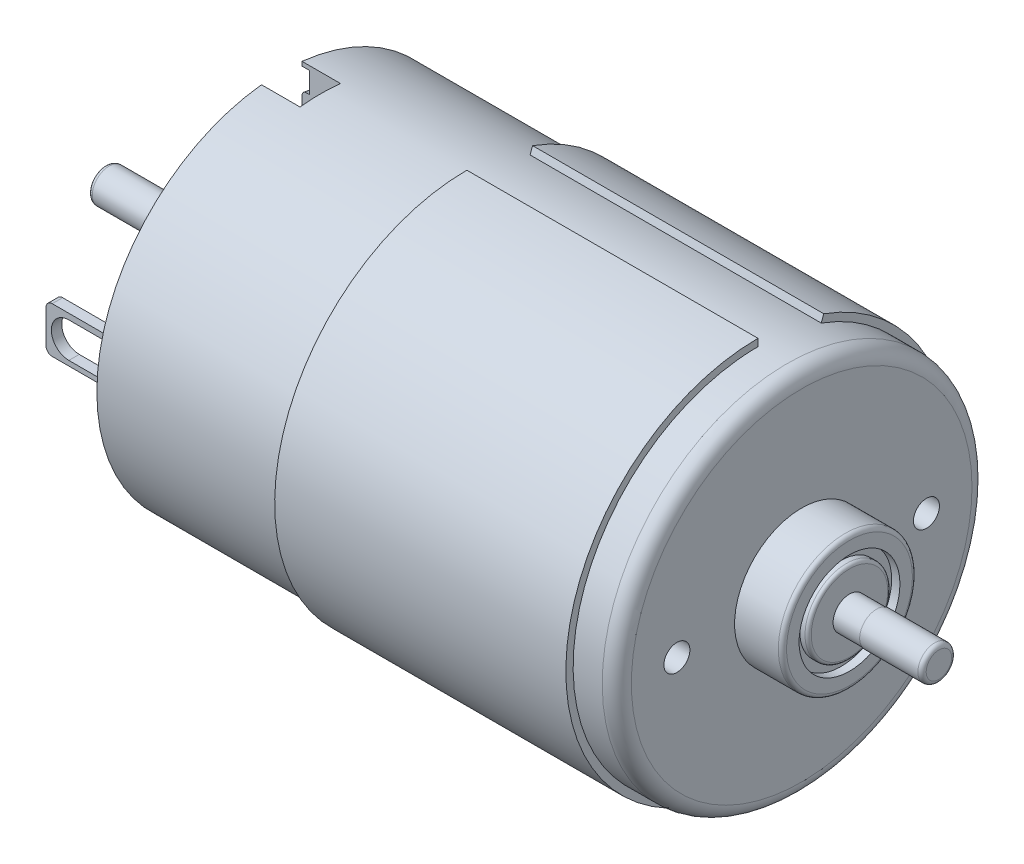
ISO-10303-21;
HEADER;
FILE_DESCRIPTION(('STEP AP214'),'2;1');
FILE_NAME('part.step','',(''),(''),'','','');
FILE_SCHEMA(('AUTOMOTIVE_DESIGN { 1 0 10303 214 1 1 1 1 }'));
ENDSEC;
DATA;
#1=APPLICATION_CONTEXT('core data for automotive mechanical design processes');
#2=APPLICATION_PROTOCOL_DEFINITION('international standard','automotive_design',2000,#1);
#3=PRODUCT_CONTEXT('',#1,'mechanical');
#4=PRODUCT('Part','Part','',(#3));
#5=PRODUCT_RELATED_PRODUCT_CATEGORY('part','',(#4));
#6=PRODUCT_DEFINITION_FORMATION('','',#4);
#7=PRODUCT_DEFINITION_CONTEXT('part definition',#1,'design');
#8=PRODUCT_DEFINITION('design','',#6,#7);
#9=PRODUCT_DEFINITION_SHAPE('','',#8);
#10=(LENGTH_UNIT() NAMED_UNIT(*) SI_UNIT(.MILLI.,.METRE.));
#11=(NAMED_UNIT(*) PLANE_ANGLE_UNIT() SI_UNIT($,.RADIAN.));
#12=(NAMED_UNIT(*) SI_UNIT($,.STERADIAN.) SOLID_ANGLE_UNIT());
#13=UNCERTAINTY_MEASURE_WITH_UNIT(LENGTH_MEASURE(1.E-05),#10,'distance_accuracy_value','');
#14=(GEOMETRIC_REPRESENTATION_CONTEXT(3) GLOBAL_UNCERTAINTY_ASSIGNED_CONTEXT((#13)) GLOBAL_UNIT_ASSIGNED_CONTEXT((#10,
#11,#12)) REPRESENTATION_CONTEXT('',''));
#15=CARTESIAN_POINT('',(0.,0.,0.));
#16=DIRECTION('',(0.,0.,1.));
#17=DIRECTION('',(1.,0.,0.));
#18=AXIS2_PLACEMENT_3D('',#15,#16,#17);
#19=CARTESIAN_POINT('',(50.,0.,0.));
#20=DIRECTION('',(-1.,0.,0.));
#21=DIRECTION('',(0.,0.,1.));
#22=AXIS2_PLACEMENT_3D('',#19,#20,#21);
#23=CYLINDRICAL_SURFACE('',#22,17.78);
#24=DIRECTION('',(-1.,0.,0.));
#25=VECTOR('',#24,1.);
#26=CARTESIAN_POINT('',(50.,-17.672744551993,-1.95));
#27=LINE('',#26,#25);
#28=CARTESIAN_POINT('',(0.,-17.672744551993,-1.95));
#29=VERTEX_POINT('',#28);
#30=CARTESIAN_POINT('',(3.7,-17.672744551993,-1.95));
#31=VERTEX_POINT('',#30);
#32=EDGE_CURVE('E764',#29,#31,#27,.F.);
#33=ORIENTED_EDGE('',*,*,#32,.F.);
#34=CARTESIAN_POINT('',(0.,0.,0.));
#35=DIRECTION('',(1.,0.,0.));
#36=DIRECTION('',(0.,0.,-1.));
#37=AXIS2_PLACEMENT_3D('',#34,#35,#36);
#38=CIRCLE('',#37,17.78);
#39=CARTESIAN_POINT('',(0.,17.672744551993,-1.95));
#40=VERTEX_POINT('',#39);
#41=EDGE_CURVE('E876',#29,#40,#38,.T.);
#42=ORIENTED_EDGE('',*,*,#41,.T.);
#43=DIRECTION('',(-1.,0.,0.));
#44=VECTOR('',#43,1.);
#45=CARTESIAN_POINT('',(50.,17.672744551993,-1.95));
#46=LINE('',#45,#44);
#47=CARTESIAN_POINT('',(3.7,17.672744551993,-1.95));
#48=VERTEX_POINT('',#47);
#49=EDGE_CURVE('E795',#40,#48,#46,.F.);
#50=ORIENTED_EDGE('',*,*,#49,.T.);
#51=CARTESIAN_POINT('',(3.7,0.,0.));
#52=DIRECTION('',(-1.,0.,0.));
#53=DIRECTION('',(0.,0.,1.));
#54=AXIS2_PLACEMENT_3D('',#51,#52,#53);
#55=CIRCLE('',#54,17.78);
#56=CARTESIAN_POINT('',(3.7,17.672744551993,1.95));
#57=VERTEX_POINT('',#56);
#58=EDGE_CURVE('E1934',#57,#48,#55,.T.);
#59=ORIENTED_EDGE('',*,*,#58,.F.);
#60=DIRECTION('',(-1.,0.,0.));
#61=VECTOR('',#60,1.);
#62=CARTESIAN_POINT('',(50.,17.672744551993,1.95));
#63=LINE('',#62,#61);
#64=CARTESIAN_POINT('',(0.,17.672744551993,1.95));
#65=VERTEX_POINT('',#64);
#66=EDGE_CURVE('E807',#65,#57,#63,.F.);
#67=ORIENTED_EDGE('',*,*,#66,.F.);
#68=CARTESIAN_POINT('',(0.,-17.672744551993,1.95));
#69=VERTEX_POINT('',#68);
#70=EDGE_CURVE('E877',#65,#69,#38,.T.);
#71=ORIENTED_EDGE('',*,*,#70,.T.);
#72=DIRECTION('',(-1.,0.,0.));
#73=VECTOR('',#72,1.);
#74=CARTESIAN_POINT('',(50.,-17.672744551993,1.95));
#75=LINE('',#74,#73);
#76=CARTESIAN_POINT('',(3.7,-17.672744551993,1.95));
#77=VERTEX_POINT('',#76);
#78=EDGE_CURVE('E752',#69,#77,#75,.F.);
#79=ORIENTED_EDGE('',*,*,#78,.T.);
#80=CARTESIAN_POINT('',(3.7,0.,0.));
#81=DIRECTION('',(-1.,0.,0.));
#82=DIRECTION('',(0.,0.,1.));
#83=AXIS2_PLACEMENT_3D('',#80,#81,#82);
#84=CIRCLE('',#83,17.78);
#85=EDGE_CURVE('E1939',#31,#77,#84,.T.);
#86=ORIENTED_EDGE('',*,*,#85,.F.);
#87=EDGE_LOOP('',(#33,#42,#50,#59,#67,#71,#79,#86));
#88=FACE_BOUND('',#87,.T.);
#89=CARTESIAN_POINT('',(48.6,0.,0.));
#90=DIRECTION('',(1.,0.,0.));
#91=DIRECTION('',(0.,0.,-1.));
#92=AXIS2_PLACEMENT_3D('',#89,#90,#91);
#93=CIRCLE('',#92,17.78);
#94=CARTESIAN_POINT('',(48.6,0.,-17.78));
#95=VERTEX_POINT('',#94);
#96=EDGE_CURVE('E883',#95,#95,#93,.F.);
#97=ORIENTED_EDGE('',*,*,#96,.T.);
#98=EDGE_LOOP('',(#97));
#99=FACE_BOUND('',#98,.T.);
#100=DIRECTION('',(1.,0.,0.));
#101=VECTOR('',#100,1.);
#102=CARTESIAN_POINT('',(17.8,16.7077347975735,-6.08111814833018));
#103=LINE('',#102,#101);
#104=CARTESIAN_POINT('',(17.8,16.7077347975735,-6.08111814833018));
#105=VERTEX_POINT('',#104);
#106=CARTESIAN_POINT('',(45.8,16.7077347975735,-6.08111814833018));
#107=VERTEX_POINT('',#106);
#108=EDGE_CURVE('E520',#105,#107,#103,.T.);
#109=ORIENTED_EDGE('',*,*,#108,.F.);
#110=CARTESIAN_POINT('',(17.8,0.,0.));
#111=DIRECTION('',(-1.,0.,0.));
#112=DIRECTION('',(0.,0.,1.));
#113=AXIS2_PLACEMENT_3D('',#110,#111,#112);
#114=CIRCLE('',#113,17.78);
#115=CARTESIAN_POINT('',(17.8,17.78,0.));
#116=VERTEX_POINT('',#115);
#117=EDGE_CURVE('E528',#105,#116,#114,.T.);
#118=ORIENTED_EDGE('',*,*,#117,.T.);
#119=DIRECTION('',(1.,0.,0.));
#120=VECTOR('',#119,1.);
#121=CARTESIAN_POINT('',(17.8,17.78,0.));
#122=LINE('',#121,#120);
#123=CARTESIAN_POINT('',(45.8,17.78,0.));
#124=VERTEX_POINT('',#123);
#125=EDGE_CURVE('E508',#116,#124,#122,.T.);
#126=ORIENTED_EDGE('',*,*,#125,.T.);
#127=CARTESIAN_POINT('',(45.8,0.,0.));
#128=DIRECTION('',(-1.,0.,0.));
#129=DIRECTION('',(0.,0.,1.));
#130=AXIS2_PLACEMENT_3D('',#127,#128,#129);
#131=CIRCLE('',#130,17.78);
#132=EDGE_CURVE('E531',#107,#124,#131,.T.);
#133=ORIENTED_EDGE('',*,*,#132,.F.);
#134=EDGE_LOOP('',(#109,#118,#126,#133));
#135=FACE_BOUND('',#134,.T.);
#136=ADVANCED_FACE('F36',(#88,#99,#135),#23,.T.);
#137=CARTESIAN_POINT('',(50.,0.,0.));
#138=DIRECTION('',(1.,0.,0.));
#139=DIRECTION('',(0.,0.,-1.));
#140=AXIS2_PLACEMENT_3D('',#137,#138,#139);
#141=PLANE('',#140);
#142=CARTESIAN_POINT('',(50.,0.,-12.));
#143=DIRECTION('',(1.,0.,0.));
#144=DIRECTION('',(0.,0.,-1.));
#145=AXIS2_PLACEMENT_3D('',#142,#143,#144);
#146=CIRCLE('',#145,1.25);
#147=CARTESIAN_POINT('',(50.,0.,-13.25));
#148=VERTEX_POINT('',#147);
#149=EDGE_CURVE('E545',#148,#148,#146,.T.);
#150=ORIENTED_EDGE('',*,*,#149,.F.);
#151=EDGE_LOOP('',(#150));
#152=FACE_BOUND('',#151,.T.);
#153=CARTESIAN_POINT('',(50.,0.,0.));
#154=DIRECTION('',(1.,0.,0.));
#155=DIRECTION('',(0.,0.,-1.));
#156=AXIS2_PLACEMENT_3D('',#153,#154,#155);
#157=CIRCLE('',#156,6.45);
#158=CARTESIAN_POINT('',(50.,0.,-6.45));
#159=VERTEX_POINT('',#158);
#160=EDGE_CURVE('E871',#159,#159,#157,.T.);
#161=ORIENTED_EDGE('',*,*,#160,.F.);
#162=EDGE_LOOP('',(#161));
#163=FACE_BOUND('',#162,.T.);
#164=CARTESIAN_POINT('',(50.,0.,0.));
#165=DIRECTION('',(1.,0.,0.));
#166=DIRECTION('',(0.,0.,-1.));
#167=AXIS2_PLACEMENT_3D('',#164,#165,#166);
#168=CIRCLE('',#167,16.38);
#169=CARTESIAN_POINT('',(50.,0.,-16.38));
#170=VERTEX_POINT('',#169);
#171=EDGE_CURVE('E880',#170,#170,#168,.T.);
#172=ORIENTED_EDGE('',*,*,#171,.T.);
#173=EDGE_LOOP('',(#172));
#174=FACE_BOUND('',#173,.T.);
#175=CARTESIAN_POINT('',(50.,0.,12.));
#176=DIRECTION('',(-1.,0.,0.));
#177=DIRECTION('',(0.,0.,1.));
#178=AXIS2_PLACEMENT_3D('',#175,#176,#177);
#179=CIRCLE('',#178,1.25);
#180=CARTESIAN_POINT('',(50.,0.,13.25));
#181=VERTEX_POINT('',#180);
#182=EDGE_CURVE('E548',#181,#181,#179,.T.);
#183=ORIENTED_EDGE('',*,*,#182,.T.);
#184=EDGE_LOOP('',(#183));
#185=FACE_BOUND('',#184,.T.);
#186=ADVANCED_FACE('F1079',(#152,#163,#174,#185),#141,.T.);
#187=CARTESIAN_POINT('',(0.7,-39.2574213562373,0.));
#188=DIRECTION('',(-1.,0.,0.));
#189=DIRECTION('',(0.,0.,1.));
#190=AXIS2_PLACEMENT_3D('',#187,#188,#189);
#191=PLANE('',#190);
#192=DIRECTION('',(0.,0.,-1.));
#193=VECTOR('',#192,1.);
#194=CARTESIAN_POINT('',(0.7,5.,-1.11763585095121E-13));
#195=LINE('',#194,#193);
#196=CARTESIAN_POINT('',(0.7,4.99999999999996,-11.972484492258));
#197=VERTEX_POINT('',#196);
#198=CARTESIAN_POINT('',(0.7,4.99999999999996,-15.572484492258));
#199=VERTEX_POINT('',#198);
#200=EDGE_CURVE('E635',#197,#199,#195,.T.);
#201=ORIENTED_EDGE('',*,*,#200,.T.);
#202=DIRECTION('',(0.,-1.,0.));
#203=VECTOR('',#202,1.);
#204=CARTESIAN_POINT('',(0.7,-38.3774213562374,-15.5724844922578));
#205=LINE('',#204,#203);
#206=CARTESIAN_POINT('',(0.7,-5.00000000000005,-15.5724844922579));
#207=VERTEX_POINT('',#206);
#208=EDGE_CURVE('E612',#199,#207,#205,.T.);
#209=ORIENTED_EDGE('',*,*,#208,.T.);
#210=DIRECTION('',(0.,0.,-1.));
#211=VECTOR('',#210,1.);
#212=CARTESIAN_POINT('',(0.7,-4.99999999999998,-1.15018525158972E-13));
#213=LINE('',#212,#211);
#214=CARTESIAN_POINT('',(0.7,-5.00000000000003,-11.9724844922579));
#215=VERTEX_POINT('',#214);
#216=EDGE_CURVE('E640',#215,#207,#213,.T.);
#217=ORIENTED_EDGE('',*,*,#216,.F.);
#218=DIRECTION('',(0.,-1.,0.));
#219=VECTOR('',#218,1.);
#220=CARTESIAN_POINT('',(0.7,-38.3774213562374,-11.9724844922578));
#221=LINE('',#220,#219);
#222=EDGE_CURVE('E637',#197,#215,#221,.T.);
#223=ORIENTED_EDGE('',*,*,#222,.F.);
#224=EDGE_LOOP('',(#201,#209,#217,#223));
#225=FACE_BOUND('',#224,.T.);
#226=DIRECTION('',(0.,0.,-1.));
#227=VECTOR('',#226,1.);
#228=CARTESIAN_POINT('',(0.7,2.2,-13.7724844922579));
#229=LINE('',#228,#227);
#230=CARTESIAN_POINT('',(0.7,2.2,-13.7724844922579));
#231=VERTEX_POINT('',#230);
#232=CARTESIAN_POINT('',(0.7,2.2,-14.7724844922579));
#233=VERTEX_POINT('',#232);
#234=EDGE_CURVE('E567',#231,#233,#229,.T.);
#235=ORIENTED_EDGE('',*,*,#234,.F.);
#236=DIRECTION('',(0.,1.,0.));
#237=VECTOR('',#236,1.);
#238=CARTESIAN_POINT('',(0.7,2.2,-13.7724844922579));
#239=LINE('',#238,#237);
#240=CARTESIAN_POINT('',(0.7,-2.2,-13.7724844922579));
#241=VERTEX_POINT('',#240);
#242=EDGE_CURVE('E554',#241,#231,#239,.T.);
#243=ORIENTED_EDGE('',*,*,#242,.F.);
#244=DIRECTION('',(0.,0.,1.));
#245=VECTOR('',#244,1.);
#246=CARTESIAN_POINT('',(0.7,-2.2,-13.7724844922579));
#247=LINE('',#246,#245);
#248=CARTESIAN_POINT('',(0.7,-2.2,-14.7724844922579));
#249=VERTEX_POINT('',#248);
#250=EDGE_CURVE('E561',#249,#241,#247,.T.);
#251=ORIENTED_EDGE('',*,*,#250,.F.);
#252=DIRECTION('',(0.,-1.,0.));
#253=VECTOR('',#252,1.);
#254=CARTESIAN_POINT('',(0.7,2.2,-14.7724844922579));
#255=LINE('',#254,#253);
#256=EDGE_CURVE('E570',#233,#249,#255,.T.);
#257=ORIENTED_EDGE('',*,*,#256,.F.);
#258=EDGE_LOOP('',(#235,#243,#251,#257));
#259=FACE_BOUND('',#258,.T.);
#260=ADVANCED_FACE('F1003',(#225,#259),#191,.T.);
#261=DIRECTION('',(0.,-1.,0.));
#262=VECTOR('',#261,1.);
#263=CARTESIAN_POINT('',(0.7,-38.3774213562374,15.5724844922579));
#264=LINE('',#263,#262);
#265=CARTESIAN_POINT('',(0.7,5.,15.5724844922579));
#266=VERTEX_POINT('',#265);
#267=CARTESIAN_POINT('',(0.7,-5.,15.5724844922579));
#268=VERTEX_POINT('',#267);
#269=EDGE_CURVE('E695',#266,#268,#264,.T.);
#270=ORIENTED_EDGE('',*,*,#269,.F.);
#271=DIRECTION('',(0.,0.,1.));
#272=VECTOR('',#271,1.);
#273=CARTESIAN_POINT('',(0.7,5.,0.));
#274=LINE('',#273,#272);
#275=CARTESIAN_POINT('',(0.7,5.,11.9724844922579));
#276=VERTEX_POINT('',#275);
#277=EDGE_CURVE('E692',#276,#266,#274,.T.);
#278=ORIENTED_EDGE('',*,*,#277,.F.);
#279=DIRECTION('',(0.,-1.,0.));
#280=VECTOR('',#279,1.);
#281=CARTESIAN_POINT('',(0.7,-38.3774213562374,11.9724844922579));
#282=LINE('',#281,#280);
#283=CARTESIAN_POINT('',(0.7,-5.,11.9724844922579));
#284=VERTEX_POINT('',#283);
#285=EDGE_CURVE('E668',#276,#284,#282,.T.);
#286=ORIENTED_EDGE('',*,*,#285,.T.);
#287=DIRECTION('',(0.,0.,1.));
#288=VECTOR('',#287,1.);
#289=CARTESIAN_POINT('',(0.7,-5.,0.));
#290=LINE('',#289,#288);
#291=EDGE_CURVE('E698',#284,#268,#290,.T.);
#292=ORIENTED_EDGE('',*,*,#291,.T.);
#293=EDGE_LOOP('',(#270,#278,#286,#292));
#294=FACE_BOUND('',#293,.T.);
#295=DIRECTION('',(0.,0.,-1.));
#296=VECTOR('',#295,1.);
#297=CARTESIAN_POINT('',(0.7,2.2,13.7724844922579));
#298=LINE('',#297,#296);
#299=CARTESIAN_POINT('',(0.7,2.2,14.7724844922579));
#300=VERTEX_POINT('',#299);
#301=CARTESIAN_POINT('',(0.7,2.2,13.7724844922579));
#302=VERTEX_POINT('',#301);
#303=EDGE_CURVE('E593',#300,#302,#298,.T.);
#304=ORIENTED_EDGE('',*,*,#303,.F.);
#305=DIRECTION('',(0.,1.,0.));
#306=VECTOR('',#305,1.);
#307=CARTESIAN_POINT('',(0.7,2.2,14.7724844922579));
#308=LINE('',#307,#306);
#309=CARTESIAN_POINT('',(0.7,-2.2,14.7724844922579));
#310=VERTEX_POINT('',#309);
#311=EDGE_CURVE('E582',#310,#300,#308,.T.);
#312=ORIENTED_EDGE('',*,*,#311,.F.);
#313=DIRECTION('',(0.,0.,1.));
#314=VECTOR('',#313,1.);
#315=CARTESIAN_POINT('',(0.7,-2.2,13.7724844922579));
#316=LINE('',#315,#314);
#317=CARTESIAN_POINT('',(0.7,-2.2,13.7724844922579));
#318=VERTEX_POINT('',#317);
#319=EDGE_CURVE('E587',#318,#310,#316,.T.);
#320=ORIENTED_EDGE('',*,*,#319,.F.);
#321=DIRECTION('',(0.,-1.,0.));
#322=VECTOR('',#321,1.);
#323=CARTESIAN_POINT('',(0.7,2.2,13.7724844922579));
#324=LINE('',#323,#322);
#325=EDGE_CURVE('E596',#302,#318,#324,.T.);
#326=ORIENTED_EDGE('',*,*,#325,.F.);
#327=EDGE_LOOP('',(#304,#312,#320,#326));
#328=FACE_BOUND('',#327,.T.);
#329=ADVANCED_FACE('F1314',(#294,#328),#191,.T.);
#330=CARTESIAN_POINT('',(0.7,0.,0.));
#331=DIRECTION('',(-1.,0.,0.));
#332=DIRECTION('',(0.,0.,1.));
#333=AXIS2_PLACEMENT_3D('',#330,#331,#332);
#334=CYLINDRICAL_SURFACE('',#333,17.38);
#335=DIRECTION('',(1.,0.,0.));
#336=VECTOR('',#335,1.);
#337=CARTESIAN_POINT('',(0.,5.96999999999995,-16.322484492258));
#338=LINE('',#337,#336);
#339=CARTESIAN_POINT('',(0.,5.96999999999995,-16.322484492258));
#340=VERTEX_POINT('',#339);
#341=CARTESIAN_POINT('',(0.7,5.96999999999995,-16.322484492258));
#342=VERTEX_POINT('',#341);
#343=EDGE_CURVE('E659',#340,#342,#338,.T.);
#344=ORIENTED_EDGE('',*,*,#343,.T.);
#345=CARTESIAN_POINT('',(0.7,0.,0.));
#346=DIRECTION('',(-1.,0.,0.));
#347=DIRECTION('',(0.,0.,1.));
#348=AXIS2_PLACEMENT_3D('',#345,#346,#347);
#349=CIRCLE('',#348,17.38);
#350=CARTESIAN_POINT('',(0.7,17.2702605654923,-1.95));
#351=VERTEX_POINT('',#350);
#352=EDGE_CURVE('E822',#351,#342,#349,.T.);
#353=ORIENTED_EDGE('',*,*,#352,.F.);
#354=DIRECTION('',(-1.,0.,0.));
#355=VECTOR('',#354,1.);
#356=CARTESIAN_POINT('',(0.7,17.2702605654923,-1.95));
#357=LINE('',#356,#355);
#358=CARTESIAN_POINT('',(0.,17.2702605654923,-1.95));
#359=VERTEX_POINT('',#358);
#360=EDGE_CURVE('E792',#351,#359,#357,.T.);
#361=ORIENTED_EDGE('',*,*,#360,.T.);
#362=CARTESIAN_POINT('',(0.,0.,0.));
#363=DIRECTION('',(-1.,0.,0.));
#364=DIRECTION('',(0.,0.,1.));
#365=AXIS2_PLACEMENT_3D('',#362,#363,#364);
#366=CIRCLE('',#365,17.38);
#367=EDGE_CURVE('E814',#359,#340,#366,.T.);
#368=ORIENTED_EDGE('',*,*,#367,.T.);
#369=EDGE_LOOP('',(#344,#353,#361,#368));
#370=FACE_BOUND('',#369,.T.);
#371=ADVANCED_FACE('F1009',(#370),#334,.F.);
#372=DIRECTION('',(0.,0.,-1.));
#373=VECTOR('',#372,1.);
#374=CARTESIAN_POINT('',(0.7,-5.97000000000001,0.));
#375=LINE('',#374,#373);
#376=CARTESIAN_POINT('',(0.7,-5.97000000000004,-11.2224844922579));
#377=VERTEX_POINT('',#376);
#378=CARTESIAN_POINT('',(0.7,-5.97000000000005,-16.3224844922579));
#379=VERTEX_POINT('',#378);
#380=EDGE_CURVE('E608',#377,#379,#375,.T.);
#381=ORIENTED_EDGE('',*,*,#380,.T.);
#382=CARTESIAN_POINT('',(0.7,-17.2702605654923,-1.95));
#383=VERTEX_POINT('',#382);
#384=EDGE_CURVE('E826',#379,#383,#349,.T.);
#385=ORIENTED_EDGE('',*,*,#384,.T.);
#386=DIRECTION('',(0.,1.,0.));
#387=VECTOR('',#386,1.);
#388=CARTESIAN_POINT('',(0.7,-39.2574213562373,-1.95));
#389=LINE('',#388,#387);
#390=CARTESIAN_POINT('',(0.7,-15.2558808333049,-1.95));
#391=VERTEX_POINT('',#390);
#392=EDGE_CURVE('E758',#383,#391,#389,.T.);
#393=ORIENTED_EDGE('',*,*,#392,.T.);
#394=CARTESIAN_POINT('',(0.7,0.,0.));
#395=DIRECTION('',(-1.,0.,0.));
#396=DIRECTION('',(0.,0.,1.));
#397=AXIS2_PLACEMENT_3D('',#394,#395,#396);
#398=CIRCLE('',#397,15.38);
#399=CARTESIAN_POINT('',(0.7,-12.4919259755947,-8.97196664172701));
#400=VERTEX_POINT('',#399);
#401=EDGE_CURVE('E820',#400,#391,#398,.T.);
#402=ORIENTED_EDGE('',*,*,#401,.F.);
#403=DIRECTION('',(0.,1.,0.));
#404=VECTOR('',#403,1.);
#405=CARTESIAN_POINT('',(0.7,-39.2574213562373,-8.97196664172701));
#406=LINE('',#405,#404);
#407=CARTESIAN_POINT('',(0.7,12.4919259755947,-8.97196664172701));
#408=VERTEX_POINT('',#407);
#409=EDGE_CURVE('E810',#400,#408,#406,.T.);
#410=ORIENTED_EDGE('',*,*,#409,.T.);
#411=CARTESIAN_POINT('',(0.7,15.2558808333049,-1.95));
#412=VERTEX_POINT('',#411);
#413=EDGE_CURVE('E813',#412,#408,#398,.T.);
#414=ORIENTED_EDGE('',*,*,#413,.F.);
#415=DIRECTION('',(0.,-1.,0.));
#416=VECTOR('',#415,1.);
#417=CARTESIAN_POINT('',(0.7,-39.2574213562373,-1.95));
#418=LINE('',#417,#416);
#419=EDGE_CURVE('E790',#351,#412,#418,.T.);
#420=ORIENTED_EDGE('',*,*,#419,.F.);
#421=ORIENTED_EDGE('',*,*,#352,.T.);
#422=DIRECTION('',(0.,0.,-1.));
#423=VECTOR('',#422,1.);
#424=CARTESIAN_POINT('',(0.7,5.96999999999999,-1.07025847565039E-13));
#425=LINE('',#424,#423);
#426=CARTESIAN_POINT('',(0.7,5.96999999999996,-11.222484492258));
#427=VERTEX_POINT('',#426);
#428=EDGE_CURVE('E633',#427,#342,#425,.T.);
#429=ORIENTED_EDGE('',*,*,#428,.F.);
#430=DIRECTION('',(0.,1.,0.));
#431=VECTOR('',#430,1.);
#432=CARTESIAN_POINT('',(0.7,-38.3774213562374,-11.2224844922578));
#433=LINE('',#432,#431);
#434=EDGE_CURVE('E630',#377,#427,#433,.T.);
#435=ORIENTED_EDGE('',*,*,#434,.F.);
#436=EDGE_LOOP('',(#381,#385,#393,#402,#410,#414,#420,#421,#429,#435));
#437=FACE_BOUND('',#436,.T.);
#438=ADVANCED_FACE('F1004',(#437),#191,.T.);
#439=DIRECTION('',(1.,0.,0.));
#440=VECTOR('',#439,1.);
#441=CARTESIAN_POINT('',(0.,-5.97,16.3224844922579));
#442=LINE('',#441,#440);
#443=CARTESIAN_POINT('',(0.,-5.97,16.3224844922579));
#444=VERTEX_POINT('',#443);
#445=CARTESIAN_POINT('',(0.7,-5.97,16.3224844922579));
#446=VERTEX_POINT('',#445);
#447=EDGE_CURVE('E684',#444,#446,#442,.T.);
#448=ORIENTED_EDGE('',*,*,#447,.T.);
#449=CARTESIAN_POINT('',(0.7,-17.2702605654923,1.95));
#450=VERTEX_POINT('',#449);
#451=EDGE_CURVE('E827',#450,#446,#349,.T.);
#452=ORIENTED_EDGE('',*,*,#451,.F.);
#453=DIRECTION('',(-1.,0.,0.));
#454=VECTOR('',#453,1.);
#455=CARTESIAN_POINT('',(0.7,-17.2702605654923,1.95));
#456=LINE('',#455,#454);
#457=CARTESIAN_POINT('',(0.,-17.2702605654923,1.95));
#458=VERTEX_POINT('',#457);
#459=EDGE_CURVE('E749',#450,#458,#456,.T.);
#460=ORIENTED_EDGE('',*,*,#459,.T.);
#461=EDGE_CURVE('E831',#458,#444,#366,.T.);
#462=ORIENTED_EDGE('',*,*,#461,.T.);
#463=EDGE_LOOP('',(#448,#452,#460,#462));
#464=FACE_BOUND('',#463,.T.);
#465=ADVANCED_FACE('F1316',(#464),#334,.F.);
#466=CARTESIAN_POINT('',(0.,0.,0.));
#467=DIRECTION('',(1.,0.,0.));
#468=DIRECTION('',(0.,0.,-1.));
#469=AXIS2_PLACEMENT_3D('',#466,#467,#468);
#470=PLANE('',#469);
#471=DIRECTION('',(0.,1.,0.));
#472=VECTOR('',#471,1.);
#473=CARTESIAN_POINT('',(0.,-32.6257864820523,-1.95));
#474=LINE('',#473,#472);
#475=CARTESIAN_POINT('',(0.,-17.2702605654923,-1.95));
#476=VERTEX_POINT('',#475);
#477=EDGE_CURVE('E734',#29,#476,#474,.T.);
#478=ORIENTED_EDGE('',*,*,#477,.T.);
#479=CARTESIAN_POINT('',(0.,-5.97000000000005,-16.3224844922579));
#480=VERTEX_POINT('',#479);
#481=EDGE_CURVE('E830',#480,#476,#366,.T.);
#482=ORIENTED_EDGE('',*,*,#481,.F.);
#483=DIRECTION('',(0.,0.,-1.));
#484=VECTOR('',#483,1.);
#485=CARTESIAN_POINT('',(0.,-5.97000000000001,0.));
#486=LINE('',#485,#484);
#487=CARTESIAN_POINT('',(0.,-5.97000000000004,-11.2224844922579));
#488=VERTEX_POINT('',#487);
#489=EDGE_CURVE('E609',#488,#480,#486,.T.);
#490=ORIENTED_EDGE('',*,*,#489,.F.);
#491=DIRECTION('',(0.,1.,0.));
#492=VECTOR('',#491,1.);
#493=CARTESIAN_POINT('',(0.,-38.3774213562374,-11.2224844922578));
#494=LINE('',#493,#492);
#495=CARTESIAN_POINT('',(0.,5.96999999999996,-11.222484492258));
#496=VERTEX_POINT('',#495);
#497=EDGE_CURVE('E611',#488,#496,#494,.T.);
#498=ORIENTED_EDGE('',*,*,#497,.T.);
#499=DIRECTION('',(0.,0.,-1.));
#500=VECTOR('',#499,1.);
#501=CARTESIAN_POINT('',(0.,5.96999999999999,-1.07025847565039E-13));
#502=LINE('',#501,#500);
#503=EDGE_CURVE('E614',#496,#340,#502,.T.);
#504=ORIENTED_EDGE('',*,*,#503,.T.);
#505=ORIENTED_EDGE('',*,*,#367,.F.);
#506=DIRECTION('',(0.,-1.,0.));
#507=VECTOR('',#506,1.);
#508=CARTESIAN_POINT('',(0.,-32.6257864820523,-1.95));
#509=LINE('',#508,#507);
#510=EDGE_CURVE('E781',#40,#359,#509,.T.);
#511=ORIENTED_EDGE('',*,*,#510,.F.);
#512=ORIENTED_EDGE('',*,*,#41,.F.);
#513=EDGE_LOOP('',(#478,#482,#490,#498,#504,#505,#511,#512));
#514=FACE_BOUND('',#513,.T.);
#515=DIRECTION('',(0.,0.,-1.));
#516=VECTOR('',#515,1.);
#517=CARTESIAN_POINT('',(0.,5.,-1.11763585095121E-13));
#518=LINE('',#517,#516);
#519=CARTESIAN_POINT('',(0.,4.99999999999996,-11.972484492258));
#520=VERTEX_POINT('',#519);
#521=CARTESIAN_POINT('',(0.,4.99999999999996,-15.572484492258));
#522=VERTEX_POINT('',#521);
#523=EDGE_CURVE('E616',#520,#522,#518,.T.);
#524=ORIENTED_EDGE('',*,*,#523,.F.);
#525=DIRECTION('',(0.,-1.,0.));
#526=VECTOR('',#525,1.);
#527=CARTESIAN_POINT('',(0.,-38.3774213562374,-11.9724844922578));
#528=LINE('',#527,#526);
#529=CARTESIAN_POINT('',(0.,-5.00000000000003,-11.9724844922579));
#530=VERTEX_POINT('',#529);
#531=EDGE_CURVE('E619',#520,#530,#528,.T.);
#532=ORIENTED_EDGE('',*,*,#531,.T.);
#533=DIRECTION('',(0.,0.,-1.));
#534=VECTOR('',#533,1.);
#535=CARTESIAN_POINT('',(0.,-4.99999999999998,-1.15018525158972E-13));
#536=LINE('',#535,#534);
#537=CARTESIAN_POINT('',(0.,-5.00000000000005,-15.5724844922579));
#538=VERTEX_POINT('',#537);
#539=EDGE_CURVE('E622',#530,#538,#536,.T.);
#540=ORIENTED_EDGE('',*,*,#539,.T.);
#541=DIRECTION('',(0.,-1.,0.));
#542=VECTOR('',#541,1.);
#543=CARTESIAN_POINT('',(0.,-38.3774213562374,-15.5724844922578));
#544=LINE('',#543,#542);
#545=EDGE_CURVE('E624',#522,#538,#544,.T.);
#546=ORIENTED_EDGE('',*,*,#545,.F.);
#547=EDGE_LOOP('',(#524,#532,#540,#546));
#548=FACE_BOUND('',#547,.T.);
#549=ADVANCED_FACE('F1088',(#514,#548),#470,.F.);
#550=ORIENTED_EDGE('',*,*,#384,.F.);
#551=DIRECTION('',(1.,0.,0.));
#552=VECTOR('',#551,1.);
#553=CARTESIAN_POINT('',(0.,-5.97000000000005,-16.3224844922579));
#554=LINE('',#553,#552);
#555=EDGE_CURVE('E627',#480,#379,#554,.T.);
#556=ORIENTED_EDGE('',*,*,#555,.F.);
#557=ORIENTED_EDGE('',*,*,#481,.T.);
#558=DIRECTION('',(-1.,0.,0.));
#559=VECTOR('',#558,1.);
#560=CARTESIAN_POINT('',(0.7,-17.2702605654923,-1.95));
#561=LINE('',#560,#559);
#562=EDGE_CURVE('E761',#383,#476,#561,.T.);
#563=ORIENTED_EDGE('',*,*,#562,.F.);
#564=EDGE_LOOP('',(#550,#556,#557,#563));
#565=FACE_BOUND('',#564,.T.);
#566=ADVANCED_FACE('F1010',(#565),#334,.F.);
#567=CARTESIAN_POINT('',(0.,0.,0.));
#568=DIRECTION('',(1.,0.,0.));
#569=DIRECTION('',(0.,0.,-1.));
#570=AXIS2_PLACEMENT_3D('',#567,#568,#569);
#571=CIRCLE('',#570,6.875);
#572=CARTESIAN_POINT('',(0.,0.,-6.875));
#573=VERTEX_POINT('',#572);
#574=EDGE_CURVE('E923',#573,#573,#571,.T.);
#575=ORIENTED_EDGE('',*,*,#574,.T.);
#576=EDGE_LOOP('',(#575));
#577=FACE_BOUND('',#576,.T.);
#578=CARTESIAN_POINT('',(0.,-14.852538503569,-1.95));
#579=VERTEX_POINT('',#578);
#580=CARTESIAN_POINT('',(0.,-13.740074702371,-1.95));
#581=VERTEX_POINT('',#580);
#582=EDGE_CURVE('E714',#579,#581,#474,.T.);
#583=ORIENTED_EDGE('',*,*,#582,.T.);
#584=DIRECTION('',(0.,0.,1.));
#585=VECTOR('',#584,1.);
#586=CARTESIAN_POINT('',(0.,-13.740074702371,0.));
#587=LINE('',#586,#585);
#588=CARTESIAN_POINT('',(0.,-13.740074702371,1.95));
#589=VERTEX_POINT('',#588);
#590=EDGE_CURVE('E726',#581,#589,#587,.T.);
#591=ORIENTED_EDGE('',*,*,#590,.T.);
#592=DIRECTION('',(0.,1.,0.));
#593=VECTOR('',#592,1.);
#594=CARTESIAN_POINT('',(0.,-32.6257864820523,1.95));
#595=LINE('',#594,#593);
#596=CARTESIAN_POINT('',(0.,-14.852538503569,1.95));
#597=VERTEX_POINT('',#596);
#598=EDGE_CURVE('E735',#597,#589,#595,.T.);
#599=ORIENTED_EDGE('',*,*,#598,.F.);
#600=CARTESIAN_POINT('',(0.,0.,0.));
#601=DIRECTION('',(1.,0.,0.));
#602=DIRECTION('',(0.,0.,-1.));
#603=AXIS2_PLACEMENT_3D('',#600,#601,#602);
#604=CIRCLE('',#603,14.98);
#605=CARTESIAN_POINT('',(0.,-12.2850229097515,8.57196664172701));
#606=VERTEX_POINT('',#605);
#607=EDGE_CURVE('E916',#597,#606,#604,.F.);
#608=ORIENTED_EDGE('',*,*,#607,.T.);
#609=DIRECTION('',(0.,1.,0.));
#610=VECTOR('',#609,1.);
#611=CARTESIAN_POINT('',(0.,12.4919259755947,8.57196664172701));
#612=LINE('',#611,#610);
#613=CARTESIAN_POINT('',(0.,12.2850229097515,8.57196664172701));
#614=VERTEX_POINT('',#613);
#615=EDGE_CURVE('E920',#606,#614,#612,.T.);
#616=ORIENTED_EDGE('',*,*,#615,.T.);
#617=CARTESIAN_POINT('',(0.,0.,0.));
#618=DIRECTION('',(1.,0.,0.));
#619=DIRECTION('',(0.,0.,-1.));
#620=AXIS2_PLACEMENT_3D('',#617,#618,#619);
#621=CIRCLE('',#620,14.98);
#622=CARTESIAN_POINT('',(0.,14.852538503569,1.95));
#623=VERTEX_POINT('',#622);
#624=EDGE_CURVE('E911',#614,#623,#621,.F.);
#625=ORIENTED_EDGE('',*,*,#624,.T.);
#626=DIRECTION('',(0.,-1.,0.));
#627=VECTOR('',#626,1.);
#628=CARTESIAN_POINT('',(0.,-32.6257864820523,1.95));
#629=LINE('',#628,#627);
#630=CARTESIAN_POINT('',(0.,13.740074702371,1.95));
#631=VERTEX_POINT('',#630);
#632=EDGE_CURVE('E766',#623,#631,#629,.T.);
#633=ORIENTED_EDGE('',*,*,#632,.T.);
#634=DIRECTION('',(0.,0.,1.));
#635=VECTOR('',#634,1.);
#636=CARTESIAN_POINT('',(0.,13.740074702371,0.));
#637=LINE('',#636,#635);
#638=CARTESIAN_POINT('',(0.,13.740074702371,-1.95));
#639=VERTEX_POINT('',#638);
#640=EDGE_CURVE('E770',#639,#631,#637,.T.);
#641=ORIENTED_EDGE('',*,*,#640,.F.);
#642=CARTESIAN_POINT('',(0.,14.852538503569,-1.95));
#643=VERTEX_POINT('',#642);
#644=EDGE_CURVE('E779',#643,#639,#509,.T.);
#645=ORIENTED_EDGE('',*,*,#644,.F.);
#646=CARTESIAN_POINT('',(0.,12.2850229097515,-8.57196664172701));
#647=VERTEX_POINT('',#646);
#648=EDGE_CURVE('E910',#643,#647,#621,.F.);
#649=ORIENTED_EDGE('',*,*,#648,.T.);
#650=DIRECTION('',(0.,1.,0.));
#651=VECTOR('',#650,1.);
#652=CARTESIAN_POINT('',(0.,0.,-8.57196664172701));
#653=LINE('',#652,#651);
#654=CARTESIAN_POINT('',(0.,-12.2850229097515,-8.57196664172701));
#655=VERTEX_POINT('',#654);
#656=EDGE_CURVE('E914',#647,#655,#653,.F.);
#657=ORIENTED_EDGE('',*,*,#656,.T.);
#658=EDGE_CURVE('E917',#655,#579,#604,.F.);
#659=ORIENTED_EDGE('',*,*,#658,.T.);
#660=EDGE_LOOP('',(#583,#591,#599,#608,#616,#625,#633,#641,#645,#649,#657,#659));
#661=FACE_BOUND('',#660,.T.);
#662=ADVANCED_FACE('F1089',(#577,#661),#470,.F.);
#663=CARTESIAN_POINT('',(0.7,0.,0.));
#664=DIRECTION('',(-1.,0.,0.));
#665=DIRECTION('',(0.,0.,1.));
#666=AXIS2_PLACEMENT_3D('',#663,#664,#665);
#667=CYLINDRICAL_SURFACE('',#666,15.38);
#668=ORIENTED_EDGE('',*,*,#401,.T.);
#669=DIRECTION('',(-1.,0.,0.));
#670=VECTOR('',#669,1.);
#671=CARTESIAN_POINT('',(0.7,-15.2558808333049,-1.95));
#672=LINE('',#671,#670);
#673=CARTESIAN_POINT('',(0.399999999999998,-15.2558808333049,-1.95));
#674=VERTEX_POINT('',#673);
#675=EDGE_CURVE('E755',#391,#674,#672,.T.);
#676=ORIENTED_EDGE('',*,*,#675,.T.);
#677=CARTESIAN_POINT('',(0.4,0.,0.));
#678=DIRECTION('',(1.,0.,0.));
#679=DIRECTION('',(0.,0.,-1.));
#680=AXIS2_PLACEMENT_3D('',#677,#678,#679);
#681=CIRCLE('',#680,15.38);
#682=CARTESIAN_POINT('',(0.4,-12.4919259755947,-8.97196664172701));
#683=VERTEX_POINT('',#682);
#684=EDGE_CURVE('E929',#674,#683,#681,.T.);
#685=ORIENTED_EDGE('',*,*,#684,.T.);
#686=DIRECTION('',(-1.,0.,0.));
#687=VECTOR('',#686,1.);
#688=CARTESIAN_POINT('',(0.7,-12.4919259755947,-8.97196664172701));
#689=LINE('',#688,#687);
#690=EDGE_CURVE('E832',#400,#683,#689,.T.);
#691=ORIENTED_EDGE('',*,*,#690,.F.);
#692=EDGE_LOOP('',(#668,#676,#685,#691));
#693=FACE_BOUND('',#692,.T.);
#694=ADVANCED_FACE('F1017',(#693),#667,.T.);
#695=CARTESIAN_POINT('',(0.4,0.,0.));
#696=DIRECTION('',(1.,0.,0.));
#697=DIRECTION('',(0.,0.,-1.));
#698=AXIS2_PLACEMENT_3D('',#695,#696,#697);
#699=TOROIDAL_SURFACE('',#698,14.98,0.4);
#700=ORIENTED_EDGE('',*,*,#684,.F.);
#701=CARTESIAN_POINT('',(0.17156090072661,-15.1836479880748,-1.95));
#702=CARTESIAN_POINT('',(0.153058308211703,-15.1706685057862,-1.95));
#703=CARTESIAN_POINT('',(0.135644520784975,-15.1561067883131,-1.95));
#704=CARTESIAN_POINT('',(0.103500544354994,-15.1242483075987,-1.95));
#705=CARTESIAN_POINT('',(0.0887738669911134,-15.1069480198,-1.95));
#706=CARTESIAN_POINT('',(0.0624387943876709,-15.0701376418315,-1.95));
#707=CARTESIAN_POINT('',(0.0508278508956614,-15.0506293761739,-1.95));
#708=CARTESIAN_POINT('',(0.0310278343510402,-15.0099549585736,-1.95));
#709=CARTESIAN_POINT('',(0.0228379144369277,-14.9887892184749,-1.95));
#710=CARTESIAN_POINT('',(0.0100560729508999,-14.9452640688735,-1.95));
#711=CARTESIAN_POINT('',(0.00548532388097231,-14.9228984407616,-1.95));
#712=CARTESIAN_POINT('',(0.000142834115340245,-14.8777168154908,-1.95));
#713=CARTESIAN_POINT('',(-0.000628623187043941,-14.8549007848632,-1.95));
#714=CARTESIAN_POINT('',(0.0016534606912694,-14.8093474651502,-1.95));
#715=CARTESIAN_POINT('',(0.00472588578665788,-14.7866111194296,-1.95));
#716=CARTESIAN_POINT('',(0.014644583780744,-14.7419766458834,-1.95));
#717=CARTESIAN_POINT('',(0.0214908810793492,-14.7200785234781,-1.95));
#718=CARTESIAN_POINT('',(0.0387694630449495,-14.6777505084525,-1.95));
#719=CARTESIAN_POINT('',(0.049201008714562,-14.6573203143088,-1.95));
#720=CARTESIAN_POINT('',(0.073364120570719,-14.6185142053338,-1.95));
#721=CARTESIAN_POINT('',(0.0870956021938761,-14.6001382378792,-1.95));
#722=CARTESIAN_POINT('',(0.117391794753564,-14.5660746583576,-1.95));
#723=CARTESIAN_POINT('',(0.133940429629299,-14.5503727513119,-1.95));
#724=CARTESIAN_POINT('',(0.169458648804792,-14.5219989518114,-1.95));
#725=CARTESIAN_POINT('',(0.188428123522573,-14.5093269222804,-1.95));
#726=CARTESIAN_POINT('',(0.228076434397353,-14.4874877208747,-1.95));
#727=CARTESIAN_POINT('',(0.248739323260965,-14.4782915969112,-1.95));
#728=CARTESIAN_POINT('',(0.291323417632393,-14.4635292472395,-1.95));
#729=CARTESIAN_POINT('',(0.313244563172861,-14.457962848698,-1.95));
#730=CARTESIAN_POINT('',(0.357543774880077,-14.4506567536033,-1.95));
#731=CARTESIAN_POINT('',(0.379917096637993,-14.4488882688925,-1.95));
#732=CARTESIAN_POINT('',(0.42464160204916,-14.4491455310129,-1.95));
#733=CARTESIAN_POINT('',(0.446992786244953,-14.4511711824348,-1.95));
#734=CARTESIAN_POINT('',(0.490966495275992,-14.4589433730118,-1.95));
#735=CARTESIAN_POINT('',(0.512591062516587,-14.4646783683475,-1.95));
#736=CARTESIAN_POINT('',(0.554574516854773,-14.4796873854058,-1.95));
#737=CARTESIAN_POINT('',(0.574933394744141,-14.4889614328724,-1.95));
#738=CARTESIAN_POINT('',(0.613873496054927,-14.5108070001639,-1.95));
#739=CARTESIAN_POINT('',(0.6324494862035,-14.5233878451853,-1.95));
#740=CARTESIAN_POINT('',(0.667245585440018,-14.5514682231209,-1.95));
#741=CARTESIAN_POINT('',(0.683465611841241,-14.5669678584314,-1.95));
#742=CARTESIAN_POINT('',(0.713219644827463,-14.6005668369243,-1.95));
#743=CARTESIAN_POINT('',(0.726732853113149,-14.6186845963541,-1.95));
#744=CARTESIAN_POINT('',(0.750556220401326,-14.6569158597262,-1.95));
#745=CARTESIAN_POINT('',(0.760866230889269,-14.6770294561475,-1.95));
#746=CARTESIAN_POINT('',(0.778081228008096,-14.7188659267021,-1.95));
#747=CARTESIAN_POINT('',(0.784956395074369,-14.7406010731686,-1.95));
#748=CARTESIAN_POINT('',(0.794984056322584,-14.7849139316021,-1.95));
#749=CARTESIAN_POINT('',(0.798136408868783,-14.8074916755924,-1.95));
#750=CARTESIAN_POINT('',(0.800640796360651,-14.8529900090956,-1.95));
#751=CARTESIAN_POINT('',(0.799970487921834,-14.8759118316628,-1.95));
#752=CARTESIAN_POINT('',(0.794794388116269,-14.9213186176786,-1.95));
#753=CARTESIAN_POINT('',(0.790288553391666,-14.9438035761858,-1.95));
#754=CARTESIAN_POINT('',(0.777557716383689,-14.9877121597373,-1.95));
#755=CARTESIAN_POINT('',(0.769330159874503,-15.0091350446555,-1.95));
#756=CARTESIAN_POINT('',(0.749379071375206,-15.0502864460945,-1.95));
#757=CARTESIAN_POINT('',(0.737655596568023,-15.0700149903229,-1.95));
#758=CARTESIAN_POINT('',(0.711098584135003,-15.1071170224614,-1.95));
#759=CARTESIAN_POINT('',(0.696279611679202,-15.1245009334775,-1.95));
#760=CARTESIAN_POINT('',(0.663912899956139,-15.1565100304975,-1.95));
#761=CARTESIAN_POINT('',(0.646365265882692,-15.171135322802,-1.95));
#762=CARTESIAN_POINT('',(0.609184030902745,-15.1970907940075,-1.95));
#763=CARTESIAN_POINT('',(0.589567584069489,-15.2084455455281,-1.95));
#764=CARTESIAN_POINT('',(0.548696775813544,-15.2276712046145,-1.95));
#765=CARTESIAN_POINT('',(0.527442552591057,-15.235542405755,-1.95));
#766=CARTESIAN_POINT('',(0.484072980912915,-15.2475191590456,-1.95));
#767=CARTESIAN_POINT('',(0.461965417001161,-15.2516529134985,-1.95));
#768=CARTESIAN_POINT('',(0.417363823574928,-15.2561337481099,-1.95));
#769=CARTESIAN_POINT('',(0.394869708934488,-15.2564799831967,-1.95));
#770=CARTESIAN_POINT('',(0.350229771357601,-15.25338032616,-1.95));
#771=CARTESIAN_POINT('',(0.328082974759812,-15.2499483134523,-1.95));
#772=CARTESIAN_POINT('',(0.284699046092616,-15.2394174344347,-1.95));
#773=CARTESIAN_POINT('',(0.263460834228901,-15.2323230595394,-1.95));
#774=CARTESIAN_POINT('',(0.230432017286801,-15.2181126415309,-1.95));
#775=CARTESIAN_POINT('',(0.218168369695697,-15.2120693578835,-1.95));
#776=CARTESIAN_POINT('',(0.194324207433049,-15.1987593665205,-1.95));
#777=CARTESIAN_POINT('',(0.182743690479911,-15.1914926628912,-1.95));
#778=CARTESIAN_POINT('',(0.17156090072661,-15.1836479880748,-1.95));
#779=B_SPLINE_CURVE_WITH_KNOTS('',3,(#701,#702,#703,#704,#705,#706,#707,#708,#709,#710,#711,
#712,#713,#714,#715,#716,#717,#718,#719,#720,#721,#722,#723,#724,#725,#726,#727,#728,#729,#730,
#731,#732,#733,#734,#735,#736,#737,#738,#739,#740,#741,#742,#743,#744,#745,#746,#747,#748,#749,
#750,#751,#752,#753,#754,#755,#756,#757,#758,#759,#760,#761,#762,#763,#764,#765,#766,#767,#768,
#769,#770,#771,#772,#773,#774,#775,#776,#777,#778),.UNSPECIFIED.,.T.,.F.,(4,2,2,2,2,2,2,2,2,2,2,
2,2,2,2,2,2,2,2,2,2,2,2,2,2,2,2,2,2,2,2,2,2,2,2,2,2,2,4),(0.,0.0677531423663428,
0.135594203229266,0.20337960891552,0.271148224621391,0.339310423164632,0.407477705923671,
0.475981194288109,0.544485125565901,0.612974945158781,0.681463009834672,0.749572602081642,
0.817679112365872,0.885205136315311,0.952727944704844,1.01973709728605,1.08674456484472,
1.15354449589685,1.22034491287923,1.28733576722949,1.35432897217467,1.42181869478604,
1.48931154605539,1.55738057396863,1.62545219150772,1.69392209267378,1.76239276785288,
1.83091050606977,1.89942712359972,1.96762833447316,2.03582691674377,2.10349887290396,
2.17116512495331,2.2383164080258,2.30548267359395,2.37240302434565,2.43924150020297,
2.48019098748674,2.52114033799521),.UNSPECIFIED.);
#780=EDGE_CURVE('E1933',#674,#579,#779,.T.);
#781=ORIENTED_EDGE('',*,*,#780,.T.);
#782=ORIENTED_EDGE('',*,*,#658,.F.);
#783=CARTESIAN_POINT('',(0.4,-12.4919259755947,-8.97196664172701));
#784=CARTESIAN_POINT('',(0.379276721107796,-12.4919387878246,-8.97199222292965));
#785=CARTESIAN_POINT('',(0.358573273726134,-12.4911007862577,-8.97035800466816));
#786=CARTESIAN_POINT('',(0.317857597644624,-12.4878256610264,-8.96397436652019));
#787=CARTESIAN_POINT('',(0.297843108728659,-12.4853944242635,-8.95923641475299));
#788=CARTESIAN_POINT('',(0.259007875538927,-12.4790359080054,-8.94685076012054));
#789=CARTESIAN_POINT('',(0.240186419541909,-12.4751095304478,-8.93920481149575));
#790=CARTESIAN_POINT('',(0.204162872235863,-12.4659226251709,-8.92132638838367));
#791=CARTESIAN_POINT('',(0.186961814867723,-12.4606612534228,-8.91109227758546));
#792=CARTESIAN_POINT('',(0.153828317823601,-12.4487384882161,-8.88791889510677));
#793=CARTESIAN_POINT('',(0.137982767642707,-12.4420264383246,-8.87488187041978));
#794=CARTESIAN_POINT('',(0.10869540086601,-12.4275735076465,-8.84683593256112));
#795=CARTESIAN_POINT('',(0.0952542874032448,-12.4198323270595,-8.83182644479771));
#796=CARTESIAN_POINT('',(0.0696680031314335,-12.4026804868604,-8.79860516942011));
#797=CARTESIAN_POINT('',(0.057805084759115,-12.3931799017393,-8.78022264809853));
#798=CARTESIAN_POINT('',(0.03733003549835,-12.3734435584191,-8.74208280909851));
#799=CARTESIAN_POINT('',(0.0287203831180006,-12.3632072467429,-8.72232445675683));
#800=CARTESIAN_POINT('',(0.0147284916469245,-12.3421162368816,-8.68166743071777));
#801=CARTESIAN_POINT('',(0.0093891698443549,-12.3312552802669,-8.66075736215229));
#802=CARTESIAN_POINT('',(0.00214239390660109,-12.3092857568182,-8.61851818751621));
#803=CARTESIAN_POINT('',(0.00022798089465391,-12.2981777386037,-8.59719002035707));
#804=CARTESIAN_POINT('',(6.37818609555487E-06,-12.2863846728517,-8.57457742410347));
#805=CARTESIAN_POINT('',(-1.26468309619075E-08,-12.2857037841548,-8.5732719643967));
#806=CARTESIAN_POINT('',(0.,-12.2850229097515,-8.57196664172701));
#807=B_SPLINE_CURVE_WITH_KNOTS('',3,(#783,#784,#785,#786,#787,#788,#789,#790,#791,#792,#793,
#794,#795,#796,#797,#798,#799,#800,#801,#802,#803,#804,#805,#806),.UNSPECIFIED.,.F.,.F.,(4,2,2,
2,2,2,2,2,2,2,2,4),(0.,0.0620575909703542,0.123887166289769,0.185679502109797,0.247511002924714,
0.312013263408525,0.376534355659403,0.447798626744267,0.519117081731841,0.591352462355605,
0.663440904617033,0.66785795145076),.UNSPECIFIED.);
#808=EDGE_CURVE('E977',#655,#683,#807,.F.);
#809=ORIENTED_EDGE('',*,*,#808,.T.);
#810=EDGE_LOOP('',(#700,#781,#782,#809));
#811=FACE_BOUND('',#810,.T.);
#812=ADVANCED_FACE('F1086',(#811),#699,.T.);
#813=ORIENTED_EDGE('',*,*,#461,.F.);
#814=EDGE_CURVE('E737',#69,#458,#595,.T.);
#815=ORIENTED_EDGE('',*,*,#814,.F.);
#816=ORIENTED_EDGE('',*,*,#70,.F.);
#817=CARTESIAN_POINT('',(0.,17.2702605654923,1.95));
#818=VERTEX_POINT('',#817);
#819=EDGE_CURVE('E778',#65,#818,#629,.T.);
#820=ORIENTED_EDGE('',*,*,#819,.T.);
#821=CARTESIAN_POINT('',(0.,5.97,16.3224844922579));
#822=VERTEX_POINT('',#821);
#823=EDGE_CURVE('E2174',#822,#818,#366,.T.);
#824=ORIENTED_EDGE('',*,*,#823,.F.);
#825=DIRECTION('',(0.,0.,1.));
#826=VECTOR('',#825,1.);
#827=CARTESIAN_POINT('',(0.,5.97,0.));
#828=LINE('',#827,#826);
#829=CARTESIAN_POINT('',(0.,5.97,11.2224844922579));
#830=VERTEX_POINT('',#829);
#831=EDGE_CURVE('E665',#830,#822,#828,.T.);
#832=ORIENTED_EDGE('',*,*,#831,.F.);
#833=DIRECTION('',(0.,1.,0.));
#834=VECTOR('',#833,1.);
#835=CARTESIAN_POINT('',(0.,-38.3774213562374,11.2224844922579));
#836=LINE('',#835,#834);
#837=CARTESIAN_POINT('',(0.,-5.97,11.2224844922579));
#838=VERTEX_POINT('',#837);
#839=EDGE_CURVE('E667',#838,#830,#836,.T.);
#840=ORIENTED_EDGE('',*,*,#839,.F.);
#841=DIRECTION('',(0.,0.,1.));
#842=VECTOR('',#841,1.);
#843=CARTESIAN_POINT('',(0.,-5.97,0.));
#844=LINE('',#843,#842);
#845=EDGE_CURVE('E671',#838,#444,#844,.T.);
#846=ORIENTED_EDGE('',*,*,#845,.T.);
#847=EDGE_LOOP('',(#813,#815,#816,#820,#824,#832,#840,#846));
#848=FACE_BOUND('',#847,.T.);
#849=DIRECTION('',(0.,0.,1.));
#850=VECTOR('',#849,1.);
#851=CARTESIAN_POINT('',(0.,5.,0.));
#852=LINE('',#851,#850);
#853=CARTESIAN_POINT('',(0.,5.,11.9724844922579));
#854=VERTEX_POINT('',#853);
#855=CARTESIAN_POINT('',(0.,5.,15.5724844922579));
#856=VERTEX_POINT('',#855);
#857=EDGE_CURVE('E673',#854,#856,#852,.T.);
#858=ORIENTED_EDGE('',*,*,#857,.T.);
#859=DIRECTION('',(0.,-1.,0.));
#860=VECTOR('',#859,1.);
#861=CARTESIAN_POINT('',(0.,-38.3774213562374,15.5724844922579));
#862=LINE('',#861,#860);
#863=CARTESIAN_POINT('',(0.,-5.,15.5724844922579));
#864=VERTEX_POINT('',#863);
#865=EDGE_CURVE('E676',#856,#864,#862,.T.);
#866=ORIENTED_EDGE('',*,*,#865,.T.);
#867=DIRECTION('',(0.,0.,1.));
#868=VECTOR('',#867,1.);
#869=CARTESIAN_POINT('',(0.,-5.,0.));
#870=LINE('',#869,#868);
#871=CARTESIAN_POINT('',(0.,-5.,11.9724844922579));
#872=VERTEX_POINT('',#871);
#873=EDGE_CURVE('E678',#872,#864,#870,.T.);
#874=ORIENTED_EDGE('',*,*,#873,.F.);
#875=DIRECTION('',(0.,-1.,0.));
#876=VECTOR('',#875,1.);
#877=CARTESIAN_POINT('',(0.,-38.3774213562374,11.9724844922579));
#878=LINE('',#877,#876);
#879=EDGE_CURVE('E681',#854,#872,#878,.T.);
#880=ORIENTED_EDGE('',*,*,#879,.F.);
#881=EDGE_LOOP('',(#858,#866,#874,#880));
#882=FACE_BOUND('',#881,.T.);
#883=ADVANCED_FACE('F1083',(#848,#882),#470,.F.);
#884=CARTESIAN_POINT('',(0.7,12.4919259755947,8.97196664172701));
#885=VERTEX_POINT('',#884);
#886=CARTESIAN_POINT('',(0.7,15.2558808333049,1.95));
#887=VERTEX_POINT('',#886);
#888=EDGE_CURVE('E815',#885,#887,#398,.T.);
#889=ORIENTED_EDGE('',*,*,#888,.T.);
#890=DIRECTION('',(-1.,0.,0.));
#891=VECTOR('',#890,1.);
#892=CARTESIAN_POINT('',(0.7,15.2558808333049,1.95));
#893=LINE('',#892,#891);
#894=CARTESIAN_POINT('',(0.400000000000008,15.255880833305,1.95));
#895=VERTEX_POINT('',#894);
#896=EDGE_CURVE('E798',#887,#895,#893,.T.);
#897=ORIENTED_EDGE('',*,*,#896,.T.);
#898=CARTESIAN_POINT('',(0.4,0.,0.));
#899=DIRECTION('',(1.,0.,0.));
#900=DIRECTION('',(0.,0.,-1.));
#901=AXIS2_PLACEMENT_3D('',#898,#899,#900);
#902=CIRCLE('',#901,15.38);
#903=CARTESIAN_POINT('',(0.4,12.4919259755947,8.97196664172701));
#904=VERTEX_POINT('',#903);
#905=EDGE_CURVE('E935',#895,#904,#902,.T.);
#906=ORIENTED_EDGE('',*,*,#905,.T.);
#907=DIRECTION('',(-1.,0.,0.));
#908=VECTOR('',#907,1.);
#909=CARTESIAN_POINT('',(0.7,12.4919259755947,8.97196664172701));
#910=LINE('',#909,#908);
#911=EDGE_CURVE('E839',#885,#904,#910,.T.);
#912=ORIENTED_EDGE('',*,*,#911,.F.);
#913=EDGE_LOOP('',(#889,#897,#906,#912));
#914=FACE_BOUND('',#913,.T.);
#915=ADVANCED_FACE('F1007',(#914),#667,.T.);
#916=CARTESIAN_POINT('',(0.7,5.97,16.3224844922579));
#917=VERTEX_POINT('',#916);
#918=CARTESIAN_POINT('',(0.7,17.2702605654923,1.95));
#919=VERTEX_POINT('',#918);
#920=EDGE_CURVE('E2155',#917,#919,#349,.T.);
#921=ORIENTED_EDGE('',*,*,#920,.F.);
#922=DIRECTION('',(1.,0.,0.));
#923=VECTOR('',#922,1.);
#924=CARTESIAN_POINT('',(0.,5.97,16.3224844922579));
#925=LINE('',#924,#923);
#926=EDGE_CURVE('E705',#822,#917,#925,.T.);
#927=ORIENTED_EDGE('',*,*,#926,.F.);
#928=ORIENTED_EDGE('',*,*,#823,.T.);
#929=DIRECTION('',(-1.,0.,0.));
#930=VECTOR('',#929,1.);
#931=CARTESIAN_POINT('',(0.7,17.2702605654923,1.95));
#932=LINE('',#931,#930);
#933=EDGE_CURVE('E804',#919,#818,#932,.T.);
#934=ORIENTED_EDGE('',*,*,#933,.F.);
#935=EDGE_LOOP('',(#921,#927,#928,#934));
#936=FACE_BOUND('',#935,.T.);
#937=ADVANCED_FACE('F1001',(#936),#334,.F.);
#938=DIRECTION('',(0.,0.,1.));
#939=VECTOR('',#938,1.);
#940=CARTESIAN_POINT('',(0.7,5.97,0.));
#941=LINE('',#940,#939);
#942=CARTESIAN_POINT('',(0.7,5.97,11.2224844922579));
#943=VERTEX_POINT('',#942);
#944=EDGE_CURVE('E657',#943,#917,#941,.T.);
#945=ORIENTED_EDGE('',*,*,#944,.T.);
#946=ORIENTED_EDGE('',*,*,#920,.T.);
#947=DIRECTION('',(0.,-1.,0.));
#948=VECTOR('',#947,1.);
#949=CARTESIAN_POINT('',(0.7,-39.2574213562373,1.95));
#950=LINE('',#949,#948);
#951=EDGE_CURVE('E801',#919,#887,#950,.T.);
#952=ORIENTED_EDGE('',*,*,#951,.T.);
#953=ORIENTED_EDGE('',*,*,#888,.F.);
#954=DIRECTION('',(0.,1.,0.));
#955=VECTOR('',#954,1.);
#956=CARTESIAN_POINT('',(0.7,-39.2574213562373,8.97196664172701));
#957=LINE('',#956,#955);
#958=CARTESIAN_POINT('',(0.7,-12.4919259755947,8.97196664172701));
#959=VERTEX_POINT('',#958);
#960=EDGE_CURVE('E818',#959,#885,#957,.T.);
#961=ORIENTED_EDGE('',*,*,#960,.F.);
#962=CARTESIAN_POINT('',(0.7,-15.2558808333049,1.95));
#963=VERTEX_POINT('',#962);
#964=EDGE_CURVE('E819',#963,#959,#398,.T.);
#965=ORIENTED_EDGE('',*,*,#964,.F.);
#966=DIRECTION('',(0.,1.,0.));
#967=VECTOR('',#966,1.);
#968=CARTESIAN_POINT('',(0.7,-39.2574213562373,1.95));
#969=LINE('',#968,#967);
#970=EDGE_CURVE('E747',#450,#963,#969,.T.);
#971=ORIENTED_EDGE('',*,*,#970,.F.);
#972=ORIENTED_EDGE('',*,*,#451,.T.);
#973=DIRECTION('',(0.,0.,1.));
#974=VECTOR('',#973,1.);
#975=CARTESIAN_POINT('',(0.7,-5.97,0.));
#976=LINE('',#975,#974);
#977=CARTESIAN_POINT('',(0.7,-5.97,11.2224844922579));
#978=VERTEX_POINT('',#977);
#979=EDGE_CURVE('E690',#978,#446,#976,.T.);
#980=ORIENTED_EDGE('',*,*,#979,.F.);
#981=DIRECTION('',(0.,1.,0.));
#982=VECTOR('',#981,1.);
#983=CARTESIAN_POINT('',(0.7,-38.3774213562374,11.2224844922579));
#984=LINE('',#983,#982);
#985=EDGE_CURVE('E687',#978,#943,#984,.T.);
#986=ORIENTED_EDGE('',*,*,#985,.T.);
#987=EDGE_LOOP('',(#945,#946,#952,#953,#961,#965,#971,#972,#980,#986));
#988=FACE_BOUND('',#987,.T.);
#989=ADVANCED_FACE('F998',(#988),#191,.T.);
#990=CARTESIAN_POINT('',(0.4,0.,0.));
#991=DIRECTION('',(1.,0.,0.));
#992=DIRECTION('',(0.,0.,-1.));
#993=AXIS2_PLACEMENT_3D('',#990,#991,#992);
#994=TOROIDAL_SURFACE('',#993,14.98,0.4);
#995=ORIENTED_EDGE('',*,*,#905,.F.);
#996=CARTESIAN_POINT('',(0.160152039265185,14.5296165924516,1.95));
#997=CARTESIAN_POINT('',(0.177992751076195,14.5161306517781,1.95));
#998=CARTESIAN_POINT('',(0.196978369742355,14.5041336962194,1.95));
#999=CARTESIAN_POINT('',(0.236707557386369,14.4834834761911,1.95));
#1000=CARTESIAN_POINT('',(0.257453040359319,14.474833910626,1.95));
#1001=CARTESIAN_POINT('',(0.300101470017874,14.4611494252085,1.95));
#1002=CARTESIAN_POINT('',(0.322004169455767,14.4561137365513,1.95));
#1003=CARTESIAN_POINT('',(0.366339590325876,14.4498081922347,1.95));
#1004=CARTESIAN_POINT('',(0.388772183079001,14.4485374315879,1.95));
#1005=CARTESIAN_POINT('',(0.433449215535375,14.4497947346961,1.95));
#1006=CARTESIAN_POINT('',(0.455694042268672,14.45230908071,1.95));
#1007=CARTESIAN_POINT('',(0.499446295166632,14.4610362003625,1.95));
#1008=CARTESIAN_POINT('',(0.520953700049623,14.4672490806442,1.95));
#1009=CARTESIAN_POINT('',(0.562629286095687,14.4831904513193,1.95));
#1010=CARTESIAN_POINT('',(0.582797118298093,14.492919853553,1.95));
#1011=CARTESIAN_POINT('',(0.62122573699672,14.5156078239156,1.95));
#1012=CARTESIAN_POINT('',(0.639486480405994,14.5285664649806,1.95));
#1013=CARTESIAN_POINT('',(0.67369838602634,14.5574210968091,1.95));
#1014=CARTESIAN_POINT('',(0.689635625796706,14.573333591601,1.95));
#1015=CARTESIAN_POINT('',(0.718639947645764,14.6075883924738,1.95));
#1016=CARTESIAN_POINT('',(0.731706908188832,14.6259308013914,1.95));
#1017=CARTESIAN_POINT('',(0.75471805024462,14.6646923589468,1.95));
#1018=CARTESIAN_POINT('',(0.764634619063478,14.6851279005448,1.95));
#1019=CARTESIAN_POINT('',(0.780925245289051,14.7273653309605,1.95));
#1020=CARTESIAN_POINT('',(0.787299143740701,14.7491672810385,1.95));
#1021=CARTESIAN_POINT('',(0.796367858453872,14.7936926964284,1.95));
#1022=CARTESIAN_POINT('',(0.799034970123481,14.8164218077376,1.95));
#1023=CARTESIAN_POINT('',(0.800528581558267,14.86200615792,1.95));
#1024=CARTESIAN_POINT('',(0.799354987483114,14.8848613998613,1.95));
#1025=CARTESIAN_POINT('',(0.793187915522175,14.930123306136,1.95));
#1026=CARTESIAN_POINT('',(0.788182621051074,14.9525283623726,1.95));
#1027=CARTESIAN_POINT('',(0.774472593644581,14.9961769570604,1.95));
#1028=CARTESIAN_POINT('',(0.765767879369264,15.0174205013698,1.95));
#1029=CARTESIAN_POINT('',(0.744922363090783,15.0580837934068,1.95));
#1030=CARTESIAN_POINT('',(0.732790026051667,15.0775078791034,1.95));
#1031=CARTESIAN_POINT('',(0.705415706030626,15.1140255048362,1.95));
#1032=CARTESIAN_POINT('',(0.69017382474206,15.1311191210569,1.95));
#1033=CARTESIAN_POINT('',(0.657121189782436,15.1623649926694,1.95));
#1034=CARTESIAN_POINT('',(0.639328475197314,15.1765363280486,1.95));
#1035=CARTESIAN_POINT('',(0.601600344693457,15.2016618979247,1.95));
#1036=CARTESIAN_POINT('',(0.581665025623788,15.2126162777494,1.95));
#1037=CARTESIAN_POINT('',(0.54038996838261,15.2309052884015,1.95));
#1038=CARTESIAN_POINT('',(0.519062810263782,15.238268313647,1.95));
#1039=CARTESIAN_POINT('',(0.475471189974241,15.2492852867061,1.95));
#1040=CARTESIAN_POINT('',(0.453206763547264,15.2529393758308,1.95));
#1041=CARTESIAN_POINT('',(0.40851369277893,15.2564184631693,1.95));
#1042=CARTESIAN_POINT('',(0.386086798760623,15.2562659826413,1.95));
#1043=CARTESIAN_POINT('',(0.341578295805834,15.2521920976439,1.95));
#1044=CARTESIAN_POINT('',(0.319496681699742,15.2482707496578,1.95));
#1045=CARTESIAN_POINT('',(0.276335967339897,15.2367838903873,1.95));
#1046=CARTESIAN_POINT('',(0.255255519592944,15.2292234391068,1.95));
#1047=CARTESIAN_POINT('',(0.214656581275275,15.2106832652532,1.95));
#1048=CARTESIAN_POINT('',(0.195138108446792,15.1997035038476,1.95));
#1049=CARTESIAN_POINT('',(0.158137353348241,15.1745983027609,1.95));
#1050=CARTESIAN_POINT('',(0.140662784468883,15.1604614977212,1.95));
#1051=CARTESIAN_POINT('',(0.108313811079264,15.1294739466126,1.95));
#1052=CARTESIAN_POINT('',(0.0934395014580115,15.1126231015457,1.95));
#1053=CARTESIAN_POINT('',(0.0665972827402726,15.0765568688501,1.95));
#1054=CARTESIAN_POINT('',(0.0546511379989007,15.0573252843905,1.95));
#1055=CARTESIAN_POINT('',(0.0341278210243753,15.0171415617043,1.95));
#1056=CARTESIAN_POINT('',(0.0255508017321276,14.996189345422,1.95));
#1057=CARTESIAN_POINT('',(0.0119404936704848,14.9529819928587,1.95));
#1058=CARTESIAN_POINT('',(0.00693566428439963,14.9307178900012,1.95));
#1059=CARTESIAN_POINT('',(0.000713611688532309,14.8856672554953,1.95));
#1060=CARTESIAN_POINT('',(-0.000503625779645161,14.8628807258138,1.95));
#1061=CARTESIAN_POINT('',(0.000884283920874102,14.8173080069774,1.95));
#1062=CARTESIAN_POINT('',(0.00350889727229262,14.7945224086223,1.95));
#1063=CARTESIAN_POINT('',(0.0125464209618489,14.7497084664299,1.95));
#1064=CARTESIAN_POINT('',(0.0189603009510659,14.727680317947,1.95));
#1065=CARTESIAN_POINT('',(0.0354057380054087,14.6850051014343,1.95));
#1066=CARTESIAN_POINT('',(0.0454394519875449,14.6643588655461,1.95));
#1067=CARTESIAN_POINT('',(0.0688426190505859,14.625075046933,1.95));
#1068=CARTESIAN_POINT('',(0.0822079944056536,14.6064350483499,1.95));
#1069=CARTESIAN_POINT('',(0.106451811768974,14.578061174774,1.95));
#1070=CARTESIAN_POINT('',(0.116451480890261,14.5675637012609,1.95));
#1071=CARTESIAN_POINT('',(0.137524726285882,14.5477081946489,1.95));
#1072=CARTESIAN_POINT('',(0.148598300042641,14.538350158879,1.95));
#1073=CARTESIAN_POINT('',(0.160152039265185,14.5296165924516,1.95));
#1074=B_SPLINE_CURVE_WITH_KNOTS('',3,(#996,#997,#998,#999,#1000,#1001,#1002,#1003,#1004,#1005,
#1006,#1007,#1008,#1009,#1010,#1011,#1012,#1013,#1014,#1015,#1016,#1017,#1018,#1019,#1020,#1021,
#1022,#1023,#1024,#1025,#1026,#1027,#1028,#1029,#1030,#1031,#1032,#1033,#1034,#1035,#1036,#1037,
#1038,#1039,#1040,#1041,#1042,#1043,#1044,#1045,#1046,#1047,#1048,#1049,#1050,#1051,#1052,#1053,
#1054,#1055,#1056,#1057,#1058,#1059,#1060,#1061,#1062,#1063,#1064,#1065,#1066,#1067,#1068,#1069,
#1070,#1071,#1072,#1073),.UNSPECIFIED.,.T.,.F.,(4,2,2,2,2,2,2,2,2,2,2,2,2,2,2,2,2,2,2,2,2,2,2,2,
2,2,2,2,2,2,2,2,2,2,2,2,2,2,4),(0.,0.06704048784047,0.134154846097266,0.20125492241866,
0.268338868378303,0.335180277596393,0.402023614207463,0.468884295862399,0.535746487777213,
0.602994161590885,0.670244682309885,0.738069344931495,0.805897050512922,0.874229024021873,
0.942562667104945,1.01110789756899,1.07965278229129,1.1480298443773,1.21640467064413,
1.28431785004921,1.35222796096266,1.41959207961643,1.48695363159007,1.55391673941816,
1.62087884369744,1.68774810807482,1.75461813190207,1.82173288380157,1.88885008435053,
1.95645197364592,2.02405693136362,2.09219465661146,2.16033212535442,2.22881603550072,
2.29731747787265,2.36585980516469,2.43431864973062,2.47773452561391,2.52115029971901),.UNSPECIFIED.);
#1075=EDGE_CURVE('E976',#895,#623,#1074,.T.);
#1076=ORIENTED_EDGE('',*,*,#1075,.T.);
#1077=ORIENTED_EDGE('',*,*,#624,.F.);
#1078=CARTESIAN_POINT('',(0.4,12.4919259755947,8.97196664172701));
#1079=CARTESIAN_POINT('',(0.379276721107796,12.4919387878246,8.97199222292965));
#1080=CARTESIAN_POINT('',(0.358573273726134,12.4911007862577,8.97035800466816));
#1081=CARTESIAN_POINT('',(0.317857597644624,12.4878256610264,8.96397436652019));
#1082=CARTESIAN_POINT('',(0.297843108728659,12.4853944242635,8.95923641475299));
#1083=CARTESIAN_POINT('',(0.259007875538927,12.4790359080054,8.94685076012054));
#1084=CARTESIAN_POINT('',(0.240186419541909,12.4751095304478,8.93920481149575));
#1085=CARTESIAN_POINT('',(0.204162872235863,12.4659226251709,8.92132638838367));
#1086=CARTESIAN_POINT('',(0.186961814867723,12.4606612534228,8.91109227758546));
#1087=CARTESIAN_POINT('',(0.153828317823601,12.4487384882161,8.88791889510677));
#1088=CARTESIAN_POINT('',(0.137982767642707,12.4420264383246,8.87488187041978));
#1089=CARTESIAN_POINT('',(0.10869540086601,12.4275735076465,8.84683593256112));
#1090=CARTESIAN_POINT('',(0.0952542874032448,12.4198323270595,8.83182644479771));
#1091=CARTESIAN_POINT('',(0.0696680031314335,12.4026804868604,8.79860516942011));
#1092=CARTESIAN_POINT('',(0.057805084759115,12.3931799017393,8.78022264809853));
#1093=CARTESIAN_POINT('',(0.03733003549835,12.3734435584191,8.74208280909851));
#1094=CARTESIAN_POINT('',(0.0287203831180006,12.3632072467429,8.72232445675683));
#1095=CARTESIAN_POINT('',(0.0147284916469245,12.3421162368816,8.68166743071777));
#1096=CARTESIAN_POINT('',(0.0093891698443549,12.3312552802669,8.66075736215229));
#1097=CARTESIAN_POINT('',(0.00214239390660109,12.3092857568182,8.61851818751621));
#1098=CARTESIAN_POINT('',(0.00022798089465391,12.2981777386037,8.59719002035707));
#1099=CARTESIAN_POINT('',(6.37818609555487E-06,12.2863846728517,8.57457742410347));
#1100=CARTESIAN_POINT('',(-1.26468309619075E-08,12.2857037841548,8.5732719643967));
#1101=CARTESIAN_POINT('',(0.,12.2850229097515,8.57196664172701));
#1102=B_SPLINE_CURVE_WITH_KNOTS('',3,(#1078,#1079,#1080,#1081,#1082,#1083,#1084,#1085,#1086,
#1087,#1088,#1089,#1090,#1091,#1092,#1093,#1094,#1095,#1096,#1097,#1098,#1099,#1100,#1101),
.UNSPECIFIED.,.F.,.F.,(4,2,2,2,2,2,2,2,2,2,2,4),(0.,0.0620575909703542,0.123887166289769,
0.185679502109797,0.247511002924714,0.312013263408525,0.376534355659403,0.447798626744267,
0.519117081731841,0.591352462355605,0.663440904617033,0.66785795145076),.UNSPECIFIED.);
#1103=EDGE_CURVE('E809',#904,#614,#1102,.T.);
#1104=ORIENTED_EDGE('',*,*,#1103,.F.);
#1105=EDGE_LOOP('',(#995,#1076,#1077,#1104));
#1106=FACE_BOUND('',#1105,.T.);
#1107=ADVANCED_FACE('F960',(#1106),#994,.T.);
#1108=CARTESIAN_POINT('',(54.6,0.,0.));
#1109=DIRECTION('',(1.,0.,0.));
#1110=DIRECTION('',(0.,0.,-1.));
#1111=AXIS2_PLACEMENT_3D('',#1108,#1109,#1110);
#1112=PLANE('',#1111);
#1113=CARTESIAN_POINT('',(54.6,0.,0.));
#1114=DIRECTION('',(1.,0.,0.));
#1115=DIRECTION('',(0.,0.,-1.));
#1116=AXIS2_PLACEMENT_3D('',#1113,#1114,#1115);
#1117=CIRCLE('',#1116,6.05);
#1118=CARTESIAN_POINT('',(54.6,0.,-6.05));
#1119=VERTEX_POINT('',#1118);
#1120=EDGE_CURVE('E901',#1119,#1119,#1117,.T.);
#1121=ORIENTED_EDGE('',*,*,#1120,.T.);
#1122=EDGE_LOOP('',(#1121));
#1123=FACE_BOUND('',#1122,.T.);
#1124=CARTESIAN_POINT('',(54.6,0.,0.));
#1125=DIRECTION('',(1.,0.,0.));
#1126=DIRECTION('',(0.,0.,-1.));
#1127=AXIS2_PLACEMENT_3D('',#1124,#1125,#1126);
#1128=CIRCLE('',#1127,4.85);
#1129=CARTESIAN_POINT('',(54.6,0.,-4.85));
#1130=VERTEX_POINT('',#1129);
#1131=EDGE_CURVE('E846',#1130,#1130,#1128,.T.);
#1132=ORIENTED_EDGE('',*,*,#1131,.F.);
#1133=EDGE_LOOP('',(#1132));
#1134=FACE_BOUND('',#1133,.T.);
#1135=ADVANCED_FACE('F1071',(#1123,#1134),#1112,.T.);
#1136=CARTESIAN_POINT('',(54.6,0.,0.));
#1137=DIRECTION('',(-1.,0.,0.));
#1138=DIRECTION('',(0.,0.,1.));
#1139=AXIS2_PLACEMENT_3D('',#1136,#1137,#1138);
#1140=CYLINDRICAL_SURFACE('',#1139,6.45);
#1141=CARTESIAN_POINT('',(54.2,0.,0.));
#1142=DIRECTION('',(1.,0.,0.));
#1143=DIRECTION('',(0.,0.,-1.));
#1144=AXIS2_PLACEMENT_3D('',#1141,#1142,#1143);
#1145=CIRCLE('',#1144,6.45);
#1146=CARTESIAN_POINT('',(54.2,0.,-6.45));
#1147=VERTEX_POINT('',#1146);
#1148=EDGE_CURVE('E904',#1147,#1147,#1145,.F.);
#1149=ORIENTED_EDGE('',*,*,#1148,.T.);
#1150=EDGE_LOOP('',(#1149));
#1151=FACE_BOUND('',#1150,.T.);
#1152=ORIENTED_EDGE('',*,*,#160,.T.);
#1153=EDGE_LOOP('',(#1152));
#1154=FACE_BOUND('',#1153,.T.);
#1155=ADVANCED_FACE('F1074',(#1151,#1154),#1140,.T.);
#1156=CARTESIAN_POINT('',(48.6,0.,0.));
#1157=DIRECTION('',(1.,0.,0.));
#1158=DIRECTION('',(0.,0.,-1.));
#1159=AXIS2_PLACEMENT_3D('',#1156,#1157,#1158);
#1160=TOROIDAL_SURFACE('',#1159,16.38,1.4);
#1161=ORIENTED_EDGE('',*,*,#96,.F.);
#1162=EDGE_LOOP('',(#1161));
#1163=FACE_BOUND('',#1162,.T.);
#1164=ORIENTED_EDGE('',*,*,#171,.F.);
#1165=EDGE_LOOP('',(#1164));
#1166=FACE_BOUND('',#1165,.T.);
#1167=ADVANCED_FACE('F1038',(#1163,#1166),#1160,.T.);
#1168=CARTESIAN_POINT('',(53.8,0.,0.));
#1169=DIRECTION('',(1.,0.,0.));
#1170=DIRECTION('',(0.,0.,-1.));
#1171=AXIS2_PLACEMENT_3D('',#1168,#1169,#1170);
#1172=CYLINDRICAL_SURFACE('',#1171,4.85);
#1173=CARTESIAN_POINT('',(53.8,0.,0.));
#1174=DIRECTION('',(1.,0.,0.));
#1175=DIRECTION('',(0.,0.,-1.));
#1176=AXIS2_PLACEMENT_3D('',#1173,#1174,#1175);
#1177=CIRCLE('',#1176,4.85);
#1178=CARTESIAN_POINT('',(53.8,0.,-4.85));
#1179=VERTEX_POINT('',#1178);
#1180=EDGE_CURVE('E847',#1179,#1179,#1177,.T.);
#1181=ORIENTED_EDGE('',*,*,#1180,.F.);
#1182=EDGE_LOOP('',(#1181));
#1183=FACE_BOUND('',#1182,.T.);
#1184=ORIENTED_EDGE('',*,*,#1131,.T.);
#1185=EDGE_LOOP('',(#1184));
#1186=FACE_BOUND('',#1185,.T.);
#1187=ADVANCED_FACE('F1034',(#1183,#1186),#1172,.F.);
#1188=CARTESIAN_POINT('',(53.8,0.,0.));
#1189=DIRECTION('',(1.,0.,0.));
#1190=DIRECTION('',(0.,0.,-1.));
#1191=AXIS2_PLACEMENT_3D('',#1188,#1189,#1190);
#1192=PLANE('',#1191);
#1193=CARTESIAN_POINT('',(53.8,0.,0.));
#1194=DIRECTION('',(1.,0.,0.));
#1195=DIRECTION('',(0.,0.,-1.));
#1196=AXIS2_PLACEMENT_3D('',#1193,#1194,#1195);
#1197=CIRCLE('',#1196,3.98);
#1198=CARTESIAN_POINT('',(53.8,0.,-3.98));
#1199=VERTEX_POINT('',#1198);
#1200=EDGE_CURVE('E835',#1199,#1199,#1197,.T.);
#1201=ORIENTED_EDGE('',*,*,#1200,.F.);
#1202=EDGE_LOOP('',(#1201));
#1203=FACE_BOUND('',#1202,.T.);
#1204=ORIENTED_EDGE('',*,*,#1180,.T.);
#1205=EDGE_LOOP('',(#1204));
#1206=FACE_BOUND('',#1205,.T.);
#1207=ADVANCED_FACE('F1030',(#1203,#1206),#1192,.T.);
#1208=CARTESIAN_POINT('',(53.8,0.,0.));
#1209=DIRECTION('',(1.,0.,0.));
#1210=DIRECTION('',(0.,0.,-1.));
#1211=AXIS2_PLACEMENT_3D('',#1208,#1209,#1210);
#1212=CYLINDRICAL_SURFACE('',#1211,3.98);
#1213=CARTESIAN_POINT('',(54.3,0.,0.));
#1214=DIRECTION('',(1.,0.,0.));
#1215=DIRECTION('',(0.,0.,-1.));
#1216=AXIS2_PLACEMENT_3D('',#1213,#1214,#1215);
#1217=CIRCLE('',#1216,3.98);
#1218=CARTESIAN_POINT('',(54.3,0.,-3.98));
#1219=VERTEX_POINT('',#1218);
#1220=EDGE_CURVE('E898',#1219,#1219,#1217,.F.);
#1221=ORIENTED_EDGE('',*,*,#1220,.T.);
#1222=EDGE_LOOP('',(#1221));
#1223=FACE_BOUND('',#1222,.T.);
#1224=ORIENTED_EDGE('',*,*,#1200,.T.);
#1225=EDGE_LOOP('',(#1224));
#1226=FACE_BOUND('',#1225,.T.);
#1227=ADVANCED_FACE('F1026',(#1223,#1226),#1212,.T.);
#1228=CARTESIAN_POINT('',(57.2,0.,0.));
#1229=DIRECTION('',(-1.,0.,0.));
#1230=DIRECTION('',(0.,0.,1.));
#1231=AXIS2_PLACEMENT_3D('',#1228,#1229,#1230);
#1232=CYLINDRICAL_SURFACE('',#1231,1.58);
#1233=CARTESIAN_POINT('',(57.2,0.,0.));
#1234=DIRECTION('',(1.,0.,0.));
#1235=DIRECTION('',(0.,0.,-1.));
#1236=AXIS2_PLACEMENT_3D('',#1233,#1234,#1235);
#1237=CIRCLE('',#1236,1.58);
#1238=CARTESIAN_POINT('',(57.2,0.,-1.58));
#1239=VERTEX_POINT('',#1238);
#1240=EDGE_CURVE('E868',#1239,#1239,#1237,.T.);
#1241=ORIENTED_EDGE('',*,*,#1240,.F.);
#1242=EDGE_LOOP('',(#1241));
#1243=FACE_BOUND('',#1242,.T.);
#1244=CARTESIAN_POINT('',(54.6,0.,0.));
#1245=DIRECTION('',(1.,0.,0.));
#1246=DIRECTION('',(0.,0.,-1.));
#1247=AXIS2_PLACEMENT_3D('',#1244,#1245,#1246);
#1248=CIRCLE('',#1247,1.58);
#1249=CARTESIAN_POINT('',(54.6,0.,-1.58));
#1250=VERTEX_POINT('',#1249);
#1251=EDGE_CURVE('E867',#1250,#1250,#1248,.T.);
#1252=ORIENTED_EDGE('',*,*,#1251,.T.);
#1253=EDGE_LOOP('',(#1252));
#1254=FACE_BOUND('',#1253,.T.);
#1255=ADVANCED_FACE('F1029',(#1243,#1254),#1232,.T.);
#1256=CARTESIAN_POINT('',(54.6,0.,0.));
#1257=DIRECTION('',(1.,0.,0.));
#1258=DIRECTION('',(0.,0.,-1.));
#1259=AXIS2_PLACEMENT_3D('',#1256,#1257,#1258);
#1260=CIRCLE('',#1259,3.68);
#1261=CARTESIAN_POINT('',(54.6,0.,-3.68));
#1262=VERTEX_POINT('',#1261);
#1263=EDGE_CURVE('E895',#1262,#1262,#1260,.T.);
#1264=ORIENTED_EDGE('',*,*,#1263,.T.);
#1265=EDGE_LOOP('',(#1264));
#1266=FACE_BOUND('',#1265,.T.);
#1267=ORIENTED_EDGE('',*,*,#1251,.F.);
#1268=EDGE_LOOP('',(#1267));
#1269=FACE_BOUND('',#1268,.T.);
#1270=ADVANCED_FACE('F1069',(#1266,#1269),#1112,.T.);
#1271=CARTESIAN_POINT('',(54.3,0.,0.));
#1272=DIRECTION('',(1.,0.,0.));
#1273=DIRECTION('',(0.,0.,-1.));
#1274=AXIS2_PLACEMENT_3D('',#1271,#1272,#1273);
#1275=TOROIDAL_SURFACE('',#1274,3.68,0.3);
#1276=ORIENTED_EDGE('',*,*,#1220,.F.);
#1277=EDGE_LOOP('',(#1276));
#1278=FACE_BOUND('',#1277,.T.);
#1279=ORIENTED_EDGE('',*,*,#1263,.F.);
#1280=EDGE_LOOP('',(#1279));
#1281=FACE_BOUND('',#1280,.T.);
#1282=ADVANCED_FACE('F1099',(#1278,#1281),#1275,.T.);
#1283=CARTESIAN_POINT('',(54.2,0.,0.));
#1284=DIRECTION('',(1.,0.,0.));
#1285=DIRECTION('',(0.,0.,-1.));
#1286=AXIS2_PLACEMENT_3D('',#1283,#1284,#1285);
#1287=TOROIDAL_SURFACE('',#1286,6.05,0.4);
#1288=ORIENTED_EDGE('',*,*,#1148,.F.);
#1289=EDGE_LOOP('',(#1288));
#1290=FACE_BOUND('',#1289,.T.);
#1291=ORIENTED_EDGE('',*,*,#1120,.F.);
#1292=EDGE_LOOP('',(#1291));
#1293=FACE_BOUND('',#1292,.T.);
#1294=ADVANCED_FACE('F1024',(#1290,#1293),#1287,.T.);
#1295=CARTESIAN_POINT('',(0.7,-39.2574213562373,-8.97196664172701));
#1296=DIRECTION('',(0.,0.,1.));
#1297=DIRECTION('',(1.,0.,0.));
#1298=AXIS2_PLACEMENT_3D('',#1295,#1296,#1297);
#1299=PLANE('',#1298);
#1300=ORIENTED_EDGE('',*,*,#690,.T.);
#1301=DIRECTION('',(0.,1.,0.));
#1302=VECTOR('',#1301,1.);
#1303=CARTESIAN_POINT('',(0.4,-39.2574213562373,-8.97196664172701));
#1304=LINE('',#1303,#1302);
#1305=CARTESIAN_POINT('',(0.4,12.4919259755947,-8.97196664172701));
#1306=VERTEX_POINT('',#1305);
#1307=EDGE_CURVE('E933',#683,#1306,#1304,.T.);
#1308=ORIENTED_EDGE('',*,*,#1307,.T.);
#1309=DIRECTION('',(-1.,0.,0.));
#1310=VECTOR('',#1309,1.);
#1311=CARTESIAN_POINT('',(0.7,12.4919259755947,-8.97196664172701));
#1312=LINE('',#1311,#1310);
#1313=EDGE_CURVE('E825',#408,#1306,#1312,.T.);
#1314=ORIENTED_EDGE('',*,*,#1313,.F.);
#1315=ORIENTED_EDGE('',*,*,#409,.F.);
#1316=EDGE_LOOP('',(#1300,#1308,#1314,#1315));
#1317=FACE_BOUND('',#1316,.T.);
#1318=ADVANCED_FACE('F1015',(#1317),#1299,.F.);
#1319=DIRECTION('',(-1.,0.,0.));
#1320=VECTOR('',#1319,1.);
#1321=CARTESIAN_POINT('',(0.7,-15.2558808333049,1.95));
#1322=LINE('',#1321,#1320);
#1323=CARTESIAN_POINT('',(0.4,-15.2558808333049,1.95));
#1324=VERTEX_POINT('',#1323);
#1325=EDGE_CURVE('E743',#963,#1324,#1322,.T.);
#1326=ORIENTED_EDGE('',*,*,#1325,.F.);
#1327=ORIENTED_EDGE('',*,*,#964,.T.);
#1328=DIRECTION('',(-1.,0.,0.));
#1329=VECTOR('',#1328,1.);
#1330=CARTESIAN_POINT('',(0.7,-12.4919259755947,8.97196664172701));
#1331=LINE('',#1330,#1329);
#1332=CARTESIAN_POINT('',(0.4,-12.4919259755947,8.97196664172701));
#1333=VERTEX_POINT('',#1332);
#1334=EDGE_CURVE('E836',#959,#1333,#1331,.T.);
#1335=ORIENTED_EDGE('',*,*,#1334,.T.);
#1336=EDGE_CURVE('E930',#1333,#1324,#681,.T.);
#1337=ORIENTED_EDGE('',*,*,#1336,.T.);
#1338=EDGE_LOOP('',(#1326,#1327,#1335,#1337));
#1339=FACE_BOUND('',#1338,.T.);
#1340=ADVANCED_FACE('F1011',(#1339),#667,.T.);
#1341=CARTESIAN_POINT('',(0.7,-39.2574213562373,8.97196664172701));
#1342=DIRECTION('',(0.,0.,1.));
#1343=DIRECTION('',(1.,0.,0.));
#1344=AXIS2_PLACEMENT_3D('',#1341,#1342,#1343);
#1345=PLANE('',#1344);
#1346=ORIENTED_EDGE('',*,*,#911,.T.);
#1347=DIRECTION('',(0.,1.,0.));
#1348=VECTOR('',#1347,1.);
#1349=CARTESIAN_POINT('',(0.4,-12.4919259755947,8.97196664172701));
#1350=LINE('',#1349,#1348);
#1351=EDGE_CURVE('E926',#904,#1333,#1350,.F.);
#1352=ORIENTED_EDGE('',*,*,#1351,.T.);
#1353=ORIENTED_EDGE('',*,*,#1334,.F.);
#1354=ORIENTED_EDGE('',*,*,#960,.T.);
#1355=EDGE_LOOP('',(#1346,#1352,#1353,#1354));
#1356=FACE_BOUND('',#1355,.T.);
#1357=ADVANCED_FACE('F1014',(#1356),#1345,.T.);
#1358=DIRECTION('',(-1.,0.,0.));
#1359=VECTOR('',#1358,1.);
#1360=CARTESIAN_POINT('',(0.7,15.2558808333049,-1.95));
#1361=LINE('',#1360,#1359);
#1362=CARTESIAN_POINT('',(0.4,15.2558808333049,-1.95));
#1363=VERTEX_POINT('',#1362);
#1364=EDGE_CURVE('E786',#412,#1363,#1361,.T.);
#1365=ORIENTED_EDGE('',*,*,#1364,.F.);
#1366=ORIENTED_EDGE('',*,*,#413,.T.);
#1367=ORIENTED_EDGE('',*,*,#1313,.T.);
#1368=EDGE_CURVE('E936',#1306,#1363,#902,.T.);
#1369=ORIENTED_EDGE('',*,*,#1368,.T.);
#1370=EDGE_LOOP('',(#1365,#1366,#1367,#1369));
#1371=FACE_BOUND('',#1370,.T.);
#1372=ADVANCED_FACE('F1018',(#1371),#667,.T.);
#1373=CARTESIAN_POINT('',(-11.,0.,0.));
#1374=DIRECTION('',(1.,0.,0.));
#1375=DIRECTION('',(0.,0.,-1.));
#1376=AXIS2_PLACEMENT_3D('',#1373,#1374,#1375);
#1377=CYLINDRICAL_SURFACE('',#1376,1.58);
#1378=CARTESIAN_POINT('',(-11.,0.,0.));
#1379=DIRECTION('',(-1.,0.,0.));
#1380=DIRECTION('',(0.,0.,1.));
#1381=AXIS2_PLACEMENT_3D('',#1378,#1379,#1380);
#1382=CIRCLE('',#1381,1.58);
#1383=CARTESIAN_POINT('',(-11.,0.,1.58));
#1384=VERTEX_POINT('',#1383);
#1385=EDGE_CURVE('E853',#1384,#1384,#1382,.T.);
#1386=ORIENTED_EDGE('',*,*,#1385,.F.);
#1387=EDGE_LOOP('',(#1386));
#1388=FACE_BOUND('',#1387,.T.);
#1389=CARTESIAN_POINT('',(-3.,0.,0.));
#1390=DIRECTION('',(-1.,0.,0.));
#1391=DIRECTION('',(0.,0.,1.));
#1392=AXIS2_PLACEMENT_3D('',#1389,#1390,#1391);
#1393=CIRCLE('',#1392,1.58);
#1394=CARTESIAN_POINT('',(-3.,0.,1.58));
#1395=VERTEX_POINT('',#1394);
#1396=EDGE_CURVE('E850',#1395,#1395,#1393,.T.);
#1397=ORIENTED_EDGE('',*,*,#1396,.T.);
#1398=EDGE_LOOP('',(#1397));
#1399=FACE_BOUND('',#1398,.T.);
#1400=ADVANCED_FACE('F1040',(#1388,#1399),#1377,.T.);
#1401=CARTESIAN_POINT('',(-3.,0.,0.));
#1402=DIRECTION('',(-1.,0.,0.));
#1403=DIRECTION('',(0.,0.,1.));
#1404=AXIS2_PLACEMENT_3D('',#1401,#1402,#1403);
#1405=PLANE('',#1404);
#1406=CARTESIAN_POINT('',(-3.,0.,0.));
#1407=DIRECTION('',(-1.,0.,0.));
#1408=DIRECTION('',(0.,0.,1.));
#1409=AXIS2_PLACEMENT_3D('',#1406,#1407,#1408);
#1410=CIRCLE('',#1409,2.9);
#1411=CARTESIAN_POINT('',(-3.,0.,2.9));
#1412=VERTEX_POINT('',#1411);
#1413=EDGE_CURVE('E886',#1412,#1412,#1410,.F.);
#1414=ORIENTED_EDGE('',*,*,#1413,.F.);
#1415=EDGE_LOOP('',(#1414));
#1416=FACE_BOUND('',#1415,.T.);
#1417=ORIENTED_EDGE('',*,*,#1396,.F.);
#1418=EDGE_LOOP('',(#1417));
#1419=FACE_BOUND('',#1418,.T.);
#1420=ADVANCED_FACE('F1043',(#1416,#1419),#1405,.T.);
#1421=CARTESIAN_POINT('',(-4.,0.,0.));
#1422=DIRECTION('',(1.,0.,0.));
#1423=DIRECTION('',(0.,0.,-1.));
#1424=AXIS2_PLACEMENT_3D('',#1421,#1422,#1423);
#1425=CYLINDRICAL_SURFACE('',#1424,2.9);
#1426=CARTESIAN_POINT('',(-4.,0.,0.));
#1427=DIRECTION('',(-1.,0.,0.));
#1428=DIRECTION('',(0.,0.,1.));
#1429=AXIS2_PLACEMENT_3D('',#1426,#1427,#1428);
#1430=CIRCLE('',#1429,2.9);
#1431=CARTESIAN_POINT('',(-4.,0.,2.9));
#1432=VERTEX_POINT('',#1431);
#1433=EDGE_CURVE('E856',#1432,#1432,#1430,.T.);
#1434=ORIENTED_EDGE('',*,*,#1433,.T.);
#1435=EDGE_LOOP('',(#1434));
#1436=FACE_BOUND('',#1435,.T.);
#1437=ORIENTED_EDGE('',*,*,#1413,.T.);
#1438=EDGE_LOOP('',(#1437));
#1439=FACE_BOUND('',#1438,.T.);
#1440=ADVANCED_FACE('F1045',(#1436,#1439),#1425,.F.);
#1441=CARTESIAN_POINT('',(-4.,0.,0.));
#1442=DIRECTION('',(-1.,0.,0.));
#1443=DIRECTION('',(0.,0.,1.));
#1444=AXIS2_PLACEMENT_3D('',#1441,#1442,#1443);
#1445=PLANE('',#1444);
#1446=CARTESIAN_POINT('',(-4.,0.,0.));
#1447=DIRECTION('',(-1.,0.,0.));
#1448=DIRECTION('',(0.,0.,1.));
#1449=AXIS2_PLACEMENT_3D('',#1446,#1447,#1448);
#1450=CIRCLE('',#1449,3.15);
#1451=CARTESIAN_POINT('',(-4.,0.,3.15));
#1452=VERTEX_POINT('',#1451);
#1453=EDGE_CURVE('E889',#1452,#1452,#1450,.T.);
#1454=ORIENTED_EDGE('',*,*,#1453,.T.);
#1455=EDGE_LOOP('',(#1454));
#1456=FACE_BOUND('',#1455,.T.);
#1457=ORIENTED_EDGE('',*,*,#1433,.F.);
#1458=EDGE_LOOP('',(#1457));
#1459=FACE_BOUND('',#1458,.T.);
#1460=ADVANCED_FACE('F1048',(#1456,#1459),#1445,.T.);
#1461=CARTESIAN_POINT('',(-4.,0.,0.));
#1462=DIRECTION('',(1.,0.,0.));
#1463=DIRECTION('',(0.,0.,-1.));
#1464=AXIS2_PLACEMENT_3D('',#1461,#1462,#1463);
#1465=CONICAL_SURFACE('',#1464,3.15,0.785398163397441);
#1466=CARTESIAN_POINT('',(-3.19999999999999,0.,0.));
#1467=DIRECTION('',(-1.,0.,0.));
#1468=DIRECTION('',(0.,0.,1.));
#1469=AXIS2_PLACEMENT_3D('',#1466,#1467,#1468);
#1470=CIRCLE('',#1469,3.95);
#1471=CARTESIAN_POINT('',(-3.19999999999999,0.,3.95));
#1472=VERTEX_POINT('',#1471);
#1473=EDGE_CURVE('E892',#1472,#1472,#1470,.F.);
#1474=ORIENTED_EDGE('',*,*,#1473,.F.);
#1475=EDGE_LOOP('',(#1474));
#1476=FACE_BOUND('',#1475,.T.);
#1477=ORIENTED_EDGE('',*,*,#1453,.F.);
#1478=EDGE_LOOP('',(#1477));
#1479=FACE_BOUND('',#1478,.T.);
#1480=ADVANCED_FACE('F1052',(#1476,#1479),#1465,.T.);
#1481=CARTESIAN_POINT('',(-4.,0.,0.));
#1482=DIRECTION('',(1.,0.,0.));
#1483=DIRECTION('',(0.,0.,-1.));
#1484=AXIS2_PLACEMENT_3D('',#1481,#1482,#1483);
#1485=CYLINDRICAL_SURFACE('',#1484,3.95);
#1486=ORIENTED_EDGE('',*,*,#1473,.T.);
#1487=EDGE_LOOP('',(#1486));
#1488=FACE_BOUND('',#1487,.T.);
#1489=CARTESIAN_POINT('',(-3.,0.,0.));
#1490=DIRECTION('',(-1.,0.,0.));
#1491=DIRECTION('',(0.,0.,1.));
#1492=AXIS2_PLACEMENT_3D('',#1489,#1490,#1491);
#1493=CIRCLE('',#1492,3.95);
#1494=CARTESIAN_POINT('',(-3.,0.,3.95));
#1495=VERTEX_POINT('',#1494);
#1496=EDGE_CURVE('E861',#1495,#1495,#1493,.T.);
#1497=ORIENTED_EDGE('',*,*,#1496,.T.);
#1498=EDGE_LOOP('',(#1497));
#1499=FACE_BOUND('',#1498,.T.);
#1500=ADVANCED_FACE('F1054',(#1488,#1499),#1485,.T.);
#1501=CARTESIAN_POINT('',(-3.,0.,0.));
#1502=DIRECTION('',(-1.,0.,0.));
#1503=DIRECTION('',(0.,0.,1.));
#1504=AXIS2_PLACEMENT_3D('',#1501,#1502,#1503);
#1505=CIRCLE('',#1504,6.475);
#1506=CARTESIAN_POINT('',(-3.,0.,6.475));
#1507=VERTEX_POINT('',#1506);
#1508=EDGE_CURVE('E864',#1507,#1507,#1505,.T.);
#1509=ORIENTED_EDGE('',*,*,#1508,.T.);
#1510=EDGE_LOOP('',(#1509));
#1511=FACE_BOUND('',#1510,.T.);
#1512=ORIENTED_EDGE('',*,*,#1496,.F.);
#1513=EDGE_LOOP('',(#1512));
#1514=FACE_BOUND('',#1513,.T.);
#1515=ADVANCED_FACE('F1057',(#1511,#1514),#1405,.T.);
#1516=CARTESIAN_POINT('',(-3.,0.,0.));
#1517=DIRECTION('',(1.,0.,0.));
#1518=DIRECTION('',(0.,0.,-1.));
#1519=AXIS2_PLACEMENT_3D('',#1516,#1517,#1518);
#1520=CYLINDRICAL_SURFACE('',#1519,6.475);
#1521=CARTESIAN_POINT('',(-0.4,0.,0.));
#1522=DIRECTION('',(1.,0.,0.));
#1523=DIRECTION('',(0.,0.,-1.));
#1524=AXIS2_PLACEMENT_3D('',#1521,#1522,#1523);
#1525=CIRCLE('',#1524,6.475);
#1526=CARTESIAN_POINT('',(-0.4,0.,-6.475));
#1527=VERTEX_POINT('',#1526);
#1528=EDGE_CURVE('E907',#1527,#1527,#1525,.F.);
#1529=ORIENTED_EDGE('',*,*,#1528,.T.);
#1530=EDGE_LOOP('',(#1529));
#1531=FACE_BOUND('',#1530,.T.);
#1532=ORIENTED_EDGE('',*,*,#1508,.F.);
#1533=EDGE_LOOP('',(#1532));
#1534=FACE_BOUND('',#1533,.T.);
#1535=ADVANCED_FACE('F1062',(#1531,#1534),#1520,.T.);
#1536=CARTESIAN_POINT('',(-0.4,0.,0.));
#1537=DIRECTION('',(1.,0.,0.));
#1538=DIRECTION('',(0.,0.,-1.));
#1539=AXIS2_PLACEMENT_3D('',#1536,#1537,#1538);
#1540=TOROIDAL_SURFACE('',#1539,6.875,0.4);
#1541=ORIENTED_EDGE('',*,*,#574,.F.);
#1542=EDGE_LOOP('',(#1541));
#1543=FACE_BOUND('',#1542,.T.);
#1544=ORIENTED_EDGE('',*,*,#1528,.F.);
#1545=EDGE_LOOP('',(#1544));
#1546=FACE_BOUND('',#1545,.T.);
#1547=ADVANCED_FACE('F1065',(#1543,#1546),#1540,.F.);
#1548=CARTESIAN_POINT('',(0.4,-39.2574213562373,-8.57196664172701));
#1549=DIRECTION('',(0.,1.,0.));
#1550=DIRECTION('',(0.,0.,1.));
#1551=AXIS2_PLACEMENT_3D('',#1548,#1549,#1550);
#1552=CYLINDRICAL_SURFACE('',#1551,0.4);
#1553=CARTESIAN_POINT('',(0.4,12.4919259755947,-8.97196664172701));
#1554=CARTESIAN_POINT('',(0.379276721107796,12.4919387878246,-8.97199222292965));
#1555=CARTESIAN_POINT('',(0.358573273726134,12.4911007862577,-8.97035800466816));
#1556=CARTESIAN_POINT('',(0.317857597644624,12.4878256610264,-8.96397436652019));
#1557=CARTESIAN_POINT('',(0.297843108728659,12.4853944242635,-8.95923641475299));
#1558=CARTESIAN_POINT('',(0.259007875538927,12.4790359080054,-8.94685076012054));
#1559=CARTESIAN_POINT('',(0.240186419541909,12.4751095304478,-8.93920481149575));
#1560=CARTESIAN_POINT('',(0.204162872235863,12.4659226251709,-8.92132638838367));
#1561=CARTESIAN_POINT('',(0.186961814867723,12.4606612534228,-8.91109227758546));
#1562=CARTESIAN_POINT('',(0.153828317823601,12.4487384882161,-8.88791889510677));
#1563=CARTESIAN_POINT('',(0.137982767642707,12.4420264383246,-8.87488187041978));
#1564=CARTESIAN_POINT('',(0.10869540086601,12.4275735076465,-8.84683593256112));
#1565=CARTESIAN_POINT('',(0.0952542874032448,12.4198323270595,-8.83182644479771));
#1566=CARTESIAN_POINT('',(0.0696680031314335,12.4026804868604,-8.79860516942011));
#1567=CARTESIAN_POINT('',(0.057805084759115,12.3931799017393,-8.78022264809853));
#1568=CARTESIAN_POINT('',(0.03733003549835,12.3734435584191,-8.74208280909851));
#1569=CARTESIAN_POINT('',(0.0287203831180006,12.3632072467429,-8.72232445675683));
#1570=CARTESIAN_POINT('',(0.0147284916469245,12.3421162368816,-8.68166743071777));
#1571=CARTESIAN_POINT('',(0.0093891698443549,12.3312552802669,-8.66075736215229));
#1572=CARTESIAN_POINT('',(0.00214239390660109,12.3092857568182,-8.61851818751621));
#1573=CARTESIAN_POINT('',(0.00022798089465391,12.2981777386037,-8.59719002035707));
#1574=CARTESIAN_POINT('',(6.37818609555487E-06,12.2863846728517,-8.57457742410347));
#1575=CARTESIAN_POINT('',(-1.26468309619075E-08,12.2857037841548,-8.5732719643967));
#1576=CARTESIAN_POINT('',(0.,12.2850229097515,-8.57196664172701));
#1577=B_SPLINE_CURVE_WITH_KNOTS('',3,(#1553,#1554,#1555,#1556,#1557,#1558,#1559,#1560,#1561,
#1562,#1563,#1564,#1565,#1566,#1567,#1568,#1569,#1570,#1571,#1572,#1573,#1574,#1575,#1576),
.UNSPECIFIED.,.F.,.F.,(4,2,2,2,2,2,2,2,2,2,2,4),(0.,0.0620575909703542,0.123887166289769,
0.185679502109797,0.247511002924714,0.312013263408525,0.376534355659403,0.447798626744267,
0.519117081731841,0.591352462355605,0.663440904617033,0.66785795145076),.UNSPECIFIED.);
#1578=EDGE_CURVE('E967',#1306,#647,#1577,.T.);
#1579=ORIENTED_EDGE('',*,*,#1578,.F.);
#1580=ORIENTED_EDGE('',*,*,#1307,.F.);
#1581=ORIENTED_EDGE('',*,*,#808,.F.);
#1582=ORIENTED_EDGE('',*,*,#656,.F.);
#1583=EDGE_LOOP('',(#1579,#1580,#1581,#1582));
#1584=FACE_BOUND('',#1583,.T.);
#1585=ADVANCED_FACE('F1106',(#1584),#1552,.T.);
#1586=CARTESIAN_POINT('',(0.17156090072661,-15.1836479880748,1.95));
#1587=CARTESIAN_POINT('',(0.153058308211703,-15.1706685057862,1.95));
#1588=CARTESIAN_POINT('',(0.135644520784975,-15.1561067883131,1.95));
#1589=CARTESIAN_POINT('',(0.103500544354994,-15.1242483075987,1.95));
#1590=CARTESIAN_POINT('',(0.0887738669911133,-15.1069480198,1.95));
#1591=CARTESIAN_POINT('',(0.0624387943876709,-15.0701376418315,1.95));
#1592=CARTESIAN_POINT('',(0.0508278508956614,-15.0506293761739,1.95));
#1593=CARTESIAN_POINT('',(0.0310278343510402,-15.0099549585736,1.95));
#1594=CARTESIAN_POINT('',(0.0228379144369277,-14.9887892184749,1.95));
#1595=CARTESIAN_POINT('',(0.0100560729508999,-14.9452640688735,1.95));
#1596=CARTESIAN_POINT('',(0.00548532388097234,-14.9228984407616,1.95));
#1597=CARTESIAN_POINT('',(0.000142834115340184,-14.8777168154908,1.95));
#1598=CARTESIAN_POINT('',(-0.000628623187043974,-14.8549007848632,1.95));
#1599=CARTESIAN_POINT('',(0.00165346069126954,-14.8093474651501,1.95));
#1600=CARTESIAN_POINT('',(0.00472588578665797,-14.7866111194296,1.95));
#1601=CARTESIAN_POINT('',(0.014644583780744,-14.7419766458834,1.95));
#1602=CARTESIAN_POINT('',(0.0214908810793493,-14.7200785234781,1.95));
#1603=CARTESIAN_POINT('',(0.0387694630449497,-14.6777505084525,1.95));
#1604=CARTESIAN_POINT('',(0.0492010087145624,-14.6573203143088,1.95));
#1605=CARTESIAN_POINT('',(0.0733641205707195,-14.6185142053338,1.95));
#1606=CARTESIAN_POINT('',(0.0870956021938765,-14.6001382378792,1.95));
#1607=CARTESIAN_POINT('',(0.117391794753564,-14.5660746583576,1.95));
#1608=CARTESIAN_POINT('',(0.133940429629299,-14.5503727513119,1.95));
#1609=CARTESIAN_POINT('',(0.169458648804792,-14.5219989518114,1.95));
#1610=CARTESIAN_POINT('',(0.188428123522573,-14.5093269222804,1.95));
#1611=CARTESIAN_POINT('',(0.228076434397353,-14.4874877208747,1.95));
#1612=CARTESIAN_POINT('',(0.248739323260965,-14.4782915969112,1.95));
#1613=CARTESIAN_POINT('',(0.291323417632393,-14.4635292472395,1.95));
#1614=CARTESIAN_POINT('',(0.313244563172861,-14.457962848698,1.95));
#1615=CARTESIAN_POINT('',(0.357543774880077,-14.4506567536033,1.95));
#1616=CARTESIAN_POINT('',(0.379917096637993,-14.4488882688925,1.95));
#1617=CARTESIAN_POINT('',(0.42464160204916,-14.4491455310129,1.95));
#1618=CARTESIAN_POINT('',(0.446992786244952,-14.4511711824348,1.95));
#1619=CARTESIAN_POINT('',(0.490966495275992,-14.4589433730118,1.95));
#1620=CARTESIAN_POINT('',(0.512591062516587,-14.4646783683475,1.95));
#1621=CARTESIAN_POINT('',(0.554574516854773,-14.4796873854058,1.95));
#1622=CARTESIAN_POINT('',(0.574933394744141,-14.4889614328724,1.95));
#1623=CARTESIAN_POINT('',(0.613873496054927,-14.5108070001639,1.95));
#1624=CARTESIAN_POINT('',(0.6324494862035,-14.5233878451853,1.95));
#1625=CARTESIAN_POINT('',(0.667245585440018,-14.5514682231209,1.95));
#1626=CARTESIAN_POINT('',(0.683465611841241,-14.5669678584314,1.95));
#1627=CARTESIAN_POINT('',(0.713219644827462,-14.6005668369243,1.95));
#1628=CARTESIAN_POINT('',(0.726732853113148,-14.6186845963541,1.95));
#1629=CARTESIAN_POINT('',(0.750556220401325,-14.6569158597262,1.95));
#1630=CARTESIAN_POINT('',(0.760866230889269,-14.6770294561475,1.95));
#1631=CARTESIAN_POINT('',(0.778081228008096,-14.7188659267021,1.95));
#1632=CARTESIAN_POINT('',(0.784956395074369,-14.7406010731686,1.95));
#1633=CARTESIAN_POINT('',(0.794984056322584,-14.7849139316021,1.95));
#1634=CARTESIAN_POINT('',(0.798136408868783,-14.8074916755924,1.95));
#1635=CARTESIAN_POINT('',(0.800640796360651,-14.8529900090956,1.95));
#1636=CARTESIAN_POINT('',(0.799970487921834,-14.8759118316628,1.95));
#1637=CARTESIAN_POINT('',(0.794794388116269,-14.9213186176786,1.95));
#1638=CARTESIAN_POINT('',(0.790288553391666,-14.9438035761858,1.95));
#1639=CARTESIAN_POINT('',(0.777557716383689,-14.9877121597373,1.95));
#1640=CARTESIAN_POINT('',(0.769330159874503,-15.0091350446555,1.95));
#1641=CARTESIAN_POINT('',(0.749379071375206,-15.0502864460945,1.95));
#1642=CARTESIAN_POINT('',(0.737655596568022,-15.0700149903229,1.95));
#1643=CARTESIAN_POINT('',(0.711098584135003,-15.1071170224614,1.95));
#1644=CARTESIAN_POINT('',(0.696279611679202,-15.1245009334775,1.95));
#1645=CARTESIAN_POINT('',(0.663912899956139,-15.1565100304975,1.95));
#1646=CARTESIAN_POINT('',(0.646365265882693,-15.171135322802,1.95));
#1647=CARTESIAN_POINT('',(0.609184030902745,-15.1970907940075,1.95));
#1648=CARTESIAN_POINT('',(0.589567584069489,-15.2084455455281,1.95));
#1649=CARTESIAN_POINT('',(0.548696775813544,-15.2276712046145,1.95));
#1650=CARTESIAN_POINT('',(0.527442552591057,-15.235542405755,1.95));
#1651=CARTESIAN_POINT('',(0.484072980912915,-15.2475191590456,1.95));
#1652=CARTESIAN_POINT('',(0.461965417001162,-15.2516529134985,1.95));
#1653=CARTESIAN_POINT('',(0.417363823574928,-15.2561337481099,1.95));
#1654=CARTESIAN_POINT('',(0.394869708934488,-15.2564799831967,1.95));
#1655=CARTESIAN_POINT('',(0.350229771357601,-15.25338032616,1.95));
#1656=CARTESIAN_POINT('',(0.328082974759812,-15.2499483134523,1.95));
#1657=CARTESIAN_POINT('',(0.284699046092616,-15.2394174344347,1.95));
#1658=CARTESIAN_POINT('',(0.263460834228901,-15.2323230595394,1.95));
#1659=CARTESIAN_POINT('',(0.230432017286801,-15.2181126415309,1.95));
#1660=CARTESIAN_POINT('',(0.218168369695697,-15.2120693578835,1.95));
#1661=CARTESIAN_POINT('',(0.194324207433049,-15.1987593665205,1.95));
#1662=CARTESIAN_POINT('',(0.182743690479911,-15.1914926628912,1.95));
#1663=CARTESIAN_POINT('',(0.17156090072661,-15.1836479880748,1.95));
#1664=B_SPLINE_CURVE_WITH_KNOTS('',3,(#1586,#1587,#1588,#1589,#1590,#1591,#1592,#1593,#1594,
#1595,#1596,#1597,#1598,#1599,#1600,#1601,#1602,#1603,#1604,#1605,#1606,#1607,#1608,#1609,#1610,
#1611,#1612,#1613,#1614,#1615,#1616,#1617,#1618,#1619,#1620,#1621,#1622,#1623,#1624,#1625,#1626,
#1627,#1628,#1629,#1630,#1631,#1632,#1633,#1634,#1635,#1636,#1637,#1638,#1639,#1640,#1641,#1642,
#1643,#1644,#1645,#1646,#1647,#1648,#1649,#1650,#1651,#1652,#1653,#1654,#1655,#1656,#1657,#1658,
#1659,#1660,#1661,#1662,#1663),.UNSPECIFIED.,.T.,.F.,(4,2,2,2,2,2,2,2,2,2,2,2,2,2,2,2,2,2,2,2,2,
2,2,2,2,2,2,2,2,2,2,2,2,2,2,2,2,2,4),(0.,0.0677531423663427,0.135594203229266,0.20337960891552,
0.271148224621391,0.339310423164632,0.407477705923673,0.475981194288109,0.544485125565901,
0.612974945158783,0.681463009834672,0.749572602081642,0.817679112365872,0.885205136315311,
0.952727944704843,1.01973709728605,1.08674456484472,1.15354449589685,1.22034491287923,
1.28733576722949,1.35432897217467,1.42181869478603,1.48931154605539,1.55738057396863,
1.62545219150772,1.69392209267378,1.76239276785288,1.83091050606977,1.89942712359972,
1.96762833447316,2.03582691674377,2.10349887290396,2.17116512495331,2.2383164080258,
2.30548267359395,2.37240302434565,2.43924150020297,2.48019098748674,2.52114033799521),.UNSPECIFIED.);
#1665=EDGE_CURVE('E1929',#1324,#597,#1664,.T.);
#1666=ORIENTED_EDGE('',*,*,#1665,.F.);
#1667=ORIENTED_EDGE('',*,*,#1336,.F.);
#1668=CARTESIAN_POINT('',(0.4,-12.4919259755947,8.97196664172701));
#1669=CARTESIAN_POINT('',(0.379276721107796,-12.4919387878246,8.97199222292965));
#1670=CARTESIAN_POINT('',(0.358573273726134,-12.4911007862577,8.97035800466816));
#1671=CARTESIAN_POINT('',(0.317857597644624,-12.4878256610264,8.96397436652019));
#1672=CARTESIAN_POINT('',(0.297843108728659,-12.4853944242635,8.95923641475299));
#1673=CARTESIAN_POINT('',(0.259007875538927,-12.4790359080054,8.94685076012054));
#1674=CARTESIAN_POINT('',(0.240186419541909,-12.4751095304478,8.93920481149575));
#1675=CARTESIAN_POINT('',(0.204162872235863,-12.4659226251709,8.92132638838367));
#1676=CARTESIAN_POINT('',(0.186961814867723,-12.4606612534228,8.91109227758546));
#1677=CARTESIAN_POINT('',(0.153828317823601,-12.4487384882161,8.88791889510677));
#1678=CARTESIAN_POINT('',(0.137982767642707,-12.4420264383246,8.87488187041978));
#1679=CARTESIAN_POINT('',(0.10869540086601,-12.4275735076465,8.84683593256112));
#1680=CARTESIAN_POINT('',(0.0952542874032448,-12.4198323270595,8.83182644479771));
#1681=CARTESIAN_POINT('',(0.0696680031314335,-12.4026804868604,8.79860516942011));
#1682=CARTESIAN_POINT('',(0.057805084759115,-12.3931799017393,8.78022264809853));
#1683=CARTESIAN_POINT('',(0.03733003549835,-12.3734435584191,8.74208280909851));
#1684=CARTESIAN_POINT('',(0.0287203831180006,-12.3632072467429,8.72232445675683));
#1685=CARTESIAN_POINT('',(0.0147284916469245,-12.3421162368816,8.68166743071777));
#1686=CARTESIAN_POINT('',(0.0093891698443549,-12.3312552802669,8.66075736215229));
#1687=CARTESIAN_POINT('',(0.00214239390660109,-12.3092857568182,8.61851818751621));
#1688=CARTESIAN_POINT('',(0.00022798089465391,-12.2981777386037,8.59719002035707));
#1689=CARTESIAN_POINT('',(6.37818609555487E-06,-12.2863846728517,8.57457742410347));
#1690=CARTESIAN_POINT('',(-1.26468309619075E-08,-12.2857037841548,8.5732719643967));
#1691=CARTESIAN_POINT('',(0.,-12.2850229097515,8.57196664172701));
#1692=B_SPLINE_CURVE_WITH_KNOTS('',3,(#1668,#1669,#1670,#1671,#1672,#1673,#1674,#1675,#1676,
#1677,#1678,#1679,#1680,#1681,#1682,#1683,#1684,#1685,#1686,#1687,#1688,#1689,#1690,#1691),
.UNSPECIFIED.,.F.,.F.,(4,2,2,2,2,2,2,2,2,2,2,4),(0.,0.0620575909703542,0.123887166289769,
0.185679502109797,0.247511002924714,0.312013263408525,0.376534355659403,0.447798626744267,
0.519117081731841,0.591352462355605,0.663440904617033,0.66785795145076),.UNSPECIFIED.);
#1693=EDGE_CURVE('E946',#606,#1333,#1692,.F.);
#1694=ORIENTED_EDGE('',*,*,#1693,.F.);
#1695=ORIENTED_EDGE('',*,*,#607,.F.);
#1696=EDGE_LOOP('',(#1666,#1667,#1694,#1695));
#1697=FACE_BOUND('',#1696,.T.);
#1698=ADVANCED_FACE('F958',(#1697),#699,.T.);
#1699=CARTESIAN_POINT('',(0.160152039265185,14.5296165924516,-1.95));
#1700=CARTESIAN_POINT('',(0.177992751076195,14.5161306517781,-1.95));
#1701=CARTESIAN_POINT('',(0.196978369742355,14.5041336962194,-1.95));
#1702=CARTESIAN_POINT('',(0.236707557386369,14.4834834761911,-1.95));
#1703=CARTESIAN_POINT('',(0.257453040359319,14.474833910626,-1.95));
#1704=CARTESIAN_POINT('',(0.300101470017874,14.4611494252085,-1.95));
#1705=CARTESIAN_POINT('',(0.322004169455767,14.4561137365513,-1.95));
#1706=CARTESIAN_POINT('',(0.366339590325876,14.4498081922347,-1.95));
#1707=CARTESIAN_POINT('',(0.388772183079,14.4485374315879,-1.95));
#1708=CARTESIAN_POINT('',(0.433449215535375,14.4497947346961,-1.95));
#1709=CARTESIAN_POINT('',(0.455694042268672,14.45230908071,-1.95));
#1710=CARTESIAN_POINT('',(0.499446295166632,14.4610362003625,-1.95));
#1711=CARTESIAN_POINT('',(0.520953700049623,14.4672490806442,-1.95));
#1712=CARTESIAN_POINT('',(0.562629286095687,14.4831904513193,-1.95));
#1713=CARTESIAN_POINT('',(0.582797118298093,14.492919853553,-1.95));
#1714=CARTESIAN_POINT('',(0.62122573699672,14.5156078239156,-1.95));
#1715=CARTESIAN_POINT('',(0.639486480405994,14.5285664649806,-1.95));
#1716=CARTESIAN_POINT('',(0.67369838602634,14.5574210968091,-1.95));
#1717=CARTESIAN_POINT('',(0.689635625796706,14.573333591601,-1.95));
#1718=CARTESIAN_POINT('',(0.718639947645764,14.6075883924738,-1.95));
#1719=CARTESIAN_POINT('',(0.731706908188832,14.6259308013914,-1.95));
#1720=CARTESIAN_POINT('',(0.75471805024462,14.6646923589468,-1.95));
#1721=CARTESIAN_POINT('',(0.764634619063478,14.6851279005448,-1.95));
#1722=CARTESIAN_POINT('',(0.780925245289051,14.7273653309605,-1.95));
#1723=CARTESIAN_POINT('',(0.787299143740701,14.7491672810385,-1.95));
#1724=CARTESIAN_POINT('',(0.796367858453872,14.7936926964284,-1.95));
#1725=CARTESIAN_POINT('',(0.799034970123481,14.8164218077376,-1.95));
#1726=CARTESIAN_POINT('',(0.800528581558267,14.86200615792,-1.95));
#1727=CARTESIAN_POINT('',(0.799354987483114,14.8848613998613,-1.95));
#1728=CARTESIAN_POINT('',(0.793187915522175,14.930123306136,-1.95));
#1729=CARTESIAN_POINT('',(0.788182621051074,14.9525283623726,-1.95));
#1730=CARTESIAN_POINT('',(0.774472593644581,14.9961769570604,-1.95));
#1731=CARTESIAN_POINT('',(0.765767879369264,15.0174205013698,-1.95));
#1732=CARTESIAN_POINT('',(0.744922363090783,15.0580837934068,-1.95));
#1733=CARTESIAN_POINT('',(0.732790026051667,15.0775078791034,-1.95));
#1734=CARTESIAN_POINT('',(0.705415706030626,15.1140255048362,-1.95));
#1735=CARTESIAN_POINT('',(0.69017382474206,15.1311191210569,-1.95));
#1736=CARTESIAN_POINT('',(0.657121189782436,15.1623649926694,-1.95));
#1737=CARTESIAN_POINT('',(0.639328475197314,15.1765363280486,-1.95));
#1738=CARTESIAN_POINT('',(0.601600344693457,15.2016618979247,-1.95));
#1739=CARTESIAN_POINT('',(0.581665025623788,15.2126162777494,-1.95));
#1740=CARTESIAN_POINT('',(0.54038996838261,15.2309052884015,-1.95));
#1741=CARTESIAN_POINT('',(0.519062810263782,15.238268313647,-1.95));
#1742=CARTESIAN_POINT('',(0.47547118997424,15.2492852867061,-1.95));
#1743=CARTESIAN_POINT('',(0.453206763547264,15.2529393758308,-1.95));
#1744=CARTESIAN_POINT('',(0.40851369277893,15.2564184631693,-1.95));
#1745=CARTESIAN_POINT('',(0.386086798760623,15.2562659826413,-1.95));
#1746=CARTESIAN_POINT('',(0.341578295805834,15.2521920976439,-1.95));
#1747=CARTESIAN_POINT('',(0.319496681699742,15.2482707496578,-1.95));
#1748=CARTESIAN_POINT('',(0.276335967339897,15.2367838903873,-1.95));
#1749=CARTESIAN_POINT('',(0.255255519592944,15.2292234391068,-1.95));
#1750=CARTESIAN_POINT('',(0.214656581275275,15.2106832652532,-1.95));
#1751=CARTESIAN_POINT('',(0.195138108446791,15.1997035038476,-1.95));
#1752=CARTESIAN_POINT('',(0.15813735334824,15.1745983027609,-1.95));
#1753=CARTESIAN_POINT('',(0.140662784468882,15.1604614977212,-1.95));
#1754=CARTESIAN_POINT('',(0.108313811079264,15.1294739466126,-1.95));
#1755=CARTESIAN_POINT('',(0.093439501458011,15.1126231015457,-1.95));
#1756=CARTESIAN_POINT('',(0.066597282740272,15.0765568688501,-1.95));
#1757=CARTESIAN_POINT('',(0.0546511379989,15.0573252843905,-1.95));
#1758=CARTESIAN_POINT('',(0.0341278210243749,15.0171415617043,-1.95));
#1759=CARTESIAN_POINT('',(0.0255508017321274,14.996189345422,-1.95));
#1760=CARTESIAN_POINT('',(0.0119404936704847,14.9529819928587,-1.95));
#1761=CARTESIAN_POINT('',(0.00693566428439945,14.9307178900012,-1.95));
#1762=CARTESIAN_POINT('',(0.00071361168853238,14.8856672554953,-1.95));
#1763=CARTESIAN_POINT('',(-0.000503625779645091,14.8628807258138,-1.95));
#1764=CARTESIAN_POINT('',(0.000884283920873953,14.8173080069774,-1.95));
#1765=CARTESIAN_POINT('',(0.00350889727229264,14.7945224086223,-1.95));
#1766=CARTESIAN_POINT('',(0.0125464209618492,14.7497084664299,-1.95));
#1767=CARTESIAN_POINT('',(0.018960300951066,14.727680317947,-1.95));
#1768=CARTESIAN_POINT('',(0.0354057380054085,14.6850051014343,-1.95));
#1769=CARTESIAN_POINT('',(0.0454394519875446,14.6643588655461,-1.95));
#1770=CARTESIAN_POINT('',(0.0688426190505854,14.625075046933,-1.95));
#1771=CARTESIAN_POINT('',(0.0822079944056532,14.6064350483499,-1.95));
#1772=CARTESIAN_POINT('',(0.106451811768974,14.578061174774,-1.95));
#1773=CARTESIAN_POINT('',(0.116451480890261,14.5675637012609,-1.95));
#1774=CARTESIAN_POINT('',(0.137524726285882,14.5477081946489,-1.95));
#1775=CARTESIAN_POINT('',(0.148598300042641,14.538350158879,-1.95));
#1776=CARTESIAN_POINT('',(0.160152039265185,14.5296165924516,-1.95));
#1777=B_SPLINE_CURVE_WITH_KNOTS('',3,(#1699,#1700,#1701,#1702,#1703,#1704,#1705,#1706,#1707,
#1708,#1709,#1710,#1711,#1712,#1713,#1714,#1715,#1716,#1717,#1718,#1719,#1720,#1721,#1722,#1723,
#1724,#1725,#1726,#1727,#1728,#1729,#1730,#1731,#1732,#1733,#1734,#1735,#1736,#1737,#1738,#1739,
#1740,#1741,#1742,#1743,#1744,#1745,#1746,#1747,#1748,#1749,#1750,#1751,#1752,#1753,#1754,#1755,
#1756,#1757,#1758,#1759,#1760,#1761,#1762,#1763,#1764,#1765,#1766,#1767,#1768,#1769,#1770,#1771,
#1772,#1773,#1774,#1775,#1776),.UNSPECIFIED.,.T.,.F.,(4,2,2,2,2,2,2,2,2,2,2,2,2,2,2,2,2,2,2,2,2,
2,2,2,2,2,2,2,2,2,2,2,2,2,2,2,2,2,4),(0.,0.06704048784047,0.134154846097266,0.20125492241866,
0.268338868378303,0.335180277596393,0.402023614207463,0.468884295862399,0.535746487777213,
0.602994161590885,0.670244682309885,0.738069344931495,0.805897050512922,0.874229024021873,
0.942562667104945,1.01110789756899,1.07965278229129,1.1480298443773,1.21640467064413,
1.28431785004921,1.35222796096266,1.41959207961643,1.48695363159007,1.55391673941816,
1.62087884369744,1.68774810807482,1.75461813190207,1.82173288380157,1.88885008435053,
1.95645197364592,2.02405693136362,2.09219465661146,2.16033212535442,2.22881603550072,
2.29731747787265,2.36585980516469,2.43431864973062,2.47773452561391,2.52115029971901),.UNSPECIFIED.);
#1778=EDGE_CURVE('E939',#1363,#643,#1777,.T.);
#1779=ORIENTED_EDGE('',*,*,#1778,.F.);
#1780=ORIENTED_EDGE('',*,*,#1368,.F.);
#1781=ORIENTED_EDGE('',*,*,#1578,.T.);
#1782=ORIENTED_EDGE('',*,*,#648,.F.);
#1783=EDGE_LOOP('',(#1779,#1780,#1781,#1782));
#1784=FACE_BOUND('',#1783,.T.);
#1785=ADVANCED_FACE('F955',(#1784),#994,.T.);
#1786=CARTESIAN_POINT('',(0.4,0.,8.57196664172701));
#1787=DIRECTION('',(0.,-1.,0.));
#1788=DIRECTION('',(0.,0.,-1.));
#1789=AXIS2_PLACEMENT_3D('',#1786,#1787,#1788);
#1790=CYLINDRICAL_SURFACE('',#1789,0.4);
#1791=ORIENTED_EDGE('',*,*,#1693,.T.);
#1792=ORIENTED_EDGE('',*,*,#1351,.F.);
#1793=ORIENTED_EDGE('',*,*,#1103,.T.);
#1794=ORIENTED_EDGE('',*,*,#615,.F.);
#1795=EDGE_LOOP('',(#1791,#1792,#1793,#1794));
#1796=FACE_BOUND('',#1795,.T.);
#1797=ADVANCED_FACE('F952',(#1796),#1790,.T.);
#1798=CARTESIAN_POINT('',(3.7,-32.6257864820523,0.));
#1799=DIRECTION('',(-1.,0.,0.));
#1800=DIRECTION('',(0.,0.,1.));
#1801=AXIS2_PLACEMENT_3D('',#1798,#1799,#1800);
#1802=PLANE('',#1801);
#1803=ORIENTED_EDGE('',*,*,#58,.T.);
#1804=DIRECTION('',(0.,-1.,0.));
#1805=VECTOR('',#1804,1.);
#1806=CARTESIAN_POINT('',(3.7,-32.6257864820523,-1.95));
#1807=LINE('',#1806,#1805);
#1808=CARTESIAN_POINT('',(3.7,13.740074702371,-1.95));
#1809=VERTEX_POINT('',#1808);
#1810=EDGE_CURVE('E769',#48,#1809,#1807,.T.);
#1811=ORIENTED_EDGE('',*,*,#1810,.T.);
#1812=DIRECTION('',(0.,0.,1.));
#1813=VECTOR('',#1812,1.);
#1814=CARTESIAN_POINT('',(3.7,13.740074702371,0.));
#1815=LINE('',#1814,#1813);
#1816=CARTESIAN_POINT('',(3.7,13.740074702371,1.95));
#1817=VERTEX_POINT('',#1816);
#1818=EDGE_CURVE('E772',#1809,#1817,#1815,.T.);
#1819=ORIENTED_EDGE('',*,*,#1818,.T.);
#1820=DIRECTION('',(0.,-1.,0.));
#1821=VECTOR('',#1820,1.);
#1822=CARTESIAN_POINT('',(3.7,-32.6257864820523,1.95));
#1823=LINE('',#1822,#1821);
#1824=EDGE_CURVE('E767',#57,#1817,#1823,.T.);
#1825=ORIENTED_EDGE('',*,*,#1824,.F.);
#1826=EDGE_LOOP('',(#1803,#1811,#1819,#1825));
#1827=FACE_BOUND('',#1826,.T.);
#1828=ADVANCED_FACE('F996',(#1827),#1802,.T.);
#1829=CARTESIAN_POINT('',(3.7,-32.6257864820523,1.95));
#1830=DIRECTION('',(0.,0.,-1.));
#1831=DIRECTION('',(-1.,0.,0.));
#1832=AXIS2_PLACEMENT_3D('',#1829,#1830,#1831);
#1833=PLANE('',#1832);
#1834=ORIENTED_EDGE('',*,*,#66,.T.);
#1835=ORIENTED_EDGE('',*,*,#1824,.T.);
#1836=DIRECTION('',(-1.,0.,0.));
#1837=VECTOR('',#1836,1.);
#1838=CARTESIAN_POINT('',(3.7,13.740074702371,1.95));
#1839=LINE('',#1838,#1837);
#1840=EDGE_CURVE('E784',#1817,#631,#1839,.T.);
#1841=ORIENTED_EDGE('',*,*,#1840,.T.);
#1842=ORIENTED_EDGE('',*,*,#632,.F.);
#1843=ORIENTED_EDGE('',*,*,#1075,.F.);
#1844=ORIENTED_EDGE('',*,*,#896,.F.);
#1845=ORIENTED_EDGE('',*,*,#951,.F.);
#1846=ORIENTED_EDGE('',*,*,#933,.T.);
#1847=ORIENTED_EDGE('',*,*,#819,.F.);
#1848=EDGE_LOOP('',(#1834,#1835,#1841,#1842,#1843,#1844,#1845,#1846,#1847));
#1849=FACE_BOUND('',#1848,.T.);
#1850=ADVANCED_FACE('F990',(#1849),#1833,.T.);
#1851=CARTESIAN_POINT('',(3.7,-32.6257864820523,-1.95));
#1852=DIRECTION('',(0.,0.,-1.));
#1853=DIRECTION('',(-1.,0.,0.));
#1854=AXIS2_PLACEMENT_3D('',#1851,#1852,#1853);
#1855=PLANE('',#1854);
#1856=ORIENTED_EDGE('',*,*,#510,.T.);
#1857=ORIENTED_EDGE('',*,*,#360,.F.);
#1858=ORIENTED_EDGE('',*,*,#419,.T.);
#1859=ORIENTED_EDGE('',*,*,#1364,.T.);
#1860=ORIENTED_EDGE('',*,*,#1778,.T.);
#1861=ORIENTED_EDGE('',*,*,#644,.T.);
#1862=DIRECTION('',(-1.,0.,0.));
#1863=VECTOR('',#1862,1.);
#1864=CARTESIAN_POINT('',(3.7,13.740074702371,-1.95));
#1865=LINE('',#1864,#1863);
#1866=EDGE_CURVE('E775',#1809,#639,#1865,.T.);
#1867=ORIENTED_EDGE('',*,*,#1866,.F.);
#1868=ORIENTED_EDGE('',*,*,#1810,.F.);
#1869=ORIENTED_EDGE('',*,*,#49,.F.);
#1870=EDGE_LOOP('',(#1856,#1857,#1858,#1859,#1860,#1861,#1867,#1868,#1869));
#1871=FACE_BOUND('',#1870,.T.);
#1872=ADVANCED_FACE('F985',(#1871),#1855,.F.);
#1873=CARTESIAN_POINT('',(3.7,13.740074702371,0.));
#1874=DIRECTION('',(0.,-1.,0.));
#1875=DIRECTION('',(0.,0.,-1.));
#1876=AXIS2_PLACEMENT_3D('',#1873,#1874,#1875);
#1877=PLANE('',#1876);
#1878=ORIENTED_EDGE('',*,*,#640,.T.);
#1879=ORIENTED_EDGE('',*,*,#1840,.F.);
#1880=ORIENTED_EDGE('',*,*,#1818,.F.);
#1881=ORIENTED_EDGE('',*,*,#1866,.T.);
#1882=EDGE_LOOP('',(#1878,#1879,#1880,#1881));
#1883=FACE_BOUND('',#1882,.T.);
#1884=ADVANCED_FACE('F989',(#1883),#1877,.F.);
#1885=CARTESIAN_POINT('',(3.7,-32.6257864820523,0.));
#1886=DIRECTION('',(-1.,0.,0.));
#1887=DIRECTION('',(0.,0.,1.));
#1888=AXIS2_PLACEMENT_3D('',#1885,#1886,#1887);
#1889=PLANE('',#1888);
#1890=ORIENTED_EDGE('',*,*,#85,.T.);
#1891=DIRECTION('',(0.,1.,0.));
#1892=VECTOR('',#1891,1.);
#1893=CARTESIAN_POINT('',(3.7,-32.6257864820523,1.95));
#1894=LINE('',#1893,#1892);
#1895=CARTESIAN_POINT('',(3.7,-13.740074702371,1.95));
#1896=VERTEX_POINT('',#1895);
#1897=EDGE_CURVE('E725',#77,#1896,#1894,.T.);
#1898=ORIENTED_EDGE('',*,*,#1897,.T.);
#1899=DIRECTION('',(0.,0.,1.));
#1900=VECTOR('',#1899,1.);
#1901=CARTESIAN_POINT('',(3.7,-13.740074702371,0.));
#1902=LINE('',#1901,#1900);
#1903=CARTESIAN_POINT('',(3.7,-13.740074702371,-1.95));
#1904=VERTEX_POINT('',#1903);
#1905=EDGE_CURVE('E728',#1904,#1896,#1902,.T.);
#1906=ORIENTED_EDGE('',*,*,#1905,.F.);
#1907=DIRECTION('',(0.,1.,0.));
#1908=VECTOR('',#1907,1.);
#1909=CARTESIAN_POINT('',(3.7,-32.6257864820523,-1.95));
#1910=LINE('',#1909,#1908);
#1911=EDGE_CURVE('E723',#31,#1904,#1910,.T.);
#1912=ORIENTED_EDGE('',*,*,#1911,.F.);
#1913=EDGE_LOOP('',(#1890,#1898,#1906,#1912));
#1914=FACE_BOUND('',#1913,.T.);
#1915=ADVANCED_FACE('F1261',(#1914),#1889,.T.);
#1916=CARTESIAN_POINT('',(3.7,-32.6257864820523,-1.95));
#1917=DIRECTION('',(0.,0.,1.));
#1918=DIRECTION('',(1.,0.,0.));
#1919=AXIS2_PLACEMENT_3D('',#1916,#1917,#1918);
#1920=PLANE('',#1919);
#1921=ORIENTED_EDGE('',*,*,#32,.T.);
#1922=ORIENTED_EDGE('',*,*,#1911,.T.);
#1923=DIRECTION('',(-1.,0.,0.));
#1924=VECTOR('',#1923,1.);
#1925=CARTESIAN_POINT('',(3.7,-13.740074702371,-1.95));
#1926=LINE('',#1925,#1924);
#1927=EDGE_CURVE('E740',#1904,#581,#1926,.T.);
#1928=ORIENTED_EDGE('',*,*,#1927,.T.);
#1929=ORIENTED_EDGE('',*,*,#582,.F.);
#1930=ORIENTED_EDGE('',*,*,#780,.F.);
#1931=ORIENTED_EDGE('',*,*,#675,.F.);
#1932=ORIENTED_EDGE('',*,*,#392,.F.);
#1933=ORIENTED_EDGE('',*,*,#562,.T.);
#1934=ORIENTED_EDGE('',*,*,#477,.F.);
#1935=EDGE_LOOP('',(#1921,#1922,#1928,#1929,#1930,#1931,#1932,#1933,#1934));
#1936=FACE_BOUND('',#1935,.T.);
#1937=ADVANCED_FACE('F1271',(#1936),#1920,.T.);
#1938=CARTESIAN_POINT('',(3.7,-32.6257864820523,1.95));
#1939=DIRECTION('',(0.,0.,1.));
#1940=DIRECTION('',(1.,0.,0.));
#1941=AXIS2_PLACEMENT_3D('',#1938,#1939,#1940);
#1942=PLANE('',#1941);
#1943=ORIENTED_EDGE('',*,*,#814,.T.);
#1944=ORIENTED_EDGE('',*,*,#459,.F.);
#1945=ORIENTED_EDGE('',*,*,#970,.T.);
#1946=ORIENTED_EDGE('',*,*,#1325,.T.);
#1947=ORIENTED_EDGE('',*,*,#1665,.T.);
#1948=ORIENTED_EDGE('',*,*,#598,.T.);
#1949=DIRECTION('',(-1.,0.,0.));
#1950=VECTOR('',#1949,1.);
#1951=CARTESIAN_POINT('',(3.7,-13.740074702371,1.95));
#1952=LINE('',#1951,#1950);
#1953=EDGE_CURVE('E731',#1896,#589,#1952,.T.);
#1954=ORIENTED_EDGE('',*,*,#1953,.F.);
#1955=ORIENTED_EDGE('',*,*,#1897,.F.);
#1956=ORIENTED_EDGE('',*,*,#78,.F.);
#1957=EDGE_LOOP('',(#1943,#1944,#1945,#1946,#1947,#1948,#1954,#1955,#1956));
#1958=FACE_BOUND('',#1957,.T.);
#1959=ADVANCED_FACE('F1282',(#1958),#1942,.F.);
#1960=CARTESIAN_POINT('',(3.7,-13.740074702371,0.));
#1961=DIRECTION('',(0.,-1.,0.));
#1962=DIRECTION('',(0.,0.,-1.));
#1963=AXIS2_PLACEMENT_3D('',#1960,#1961,#1962);
#1964=PLANE('',#1963);
#1965=ORIENTED_EDGE('',*,*,#590,.F.);
#1966=ORIENTED_EDGE('',*,*,#1927,.F.);
#1967=ORIENTED_EDGE('',*,*,#1905,.T.);
#1968=ORIENTED_EDGE('',*,*,#1953,.T.);
#1969=EDGE_LOOP('',(#1965,#1966,#1967,#1968));
#1970=FACE_BOUND('',#1969,.T.);
#1971=ADVANCED_FACE('F1292',(#1970),#1964,.T.);
#1972=CARTESIAN_POINT('',(0.,5.,0.));
#1973=DIRECTION('',(0.,1.,0.));
#1974=DIRECTION('',(0.,0.,1.));
#1975=AXIS2_PLACEMENT_3D('',#1972,#1973,#1974);
#1976=PLANE('',#1975);
#1977=ORIENTED_EDGE('',*,*,#277,.T.);
#1978=DIRECTION('',(1.,0.,0.));
#1979=VECTOR('',#1978,1.);
#1980=CARTESIAN_POINT('',(0.,5.,15.5724844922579));
#1981=LINE('',#1980,#1979);
#1982=EDGE_CURVE('E711',#856,#266,#1981,.T.);
#1983=ORIENTED_EDGE('',*,*,#1982,.F.);
#1984=ORIENTED_EDGE('',*,*,#857,.F.);
#1985=DIRECTION('',(1.,0.,0.));
#1986=VECTOR('',#1985,1.);
#1987=CARTESIAN_POINT('',(0.,5.,11.9724844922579));
#1988=LINE('',#1987,#1986);
#1989=EDGE_CURVE('E701',#854,#276,#1988,.T.);
#1990=ORIENTED_EDGE('',*,*,#1989,.T.);
#1991=EDGE_LOOP('',(#1977,#1983,#1984,#1990));
#1992=FACE_BOUND('',#1991,.T.);
#1993=ADVANCED_FACE('F1302',(#1992),#1976,.F.);
#1994=CARTESIAN_POINT('',(0.,-38.3774213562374,15.5724844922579));
#1995=DIRECTION('',(0.,0.,1.));
#1996=DIRECTION('',(1.,0.,0.));
#1997=AXIS2_PLACEMENT_3D('',#1994,#1995,#1996);
#1998=PLANE('',#1997);
#1999=ORIENTED_EDGE('',*,*,#269,.T.);
#2000=DIRECTION('',(1.,0.,0.));
#2001=VECTOR('',#2000,1.);
#2002=CARTESIAN_POINT('',(0.,-5.,15.5724844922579));
#2003=LINE('',#2002,#2001);
#2004=EDGE_CURVE('E708',#864,#268,#2003,.T.);
#2005=ORIENTED_EDGE('',*,*,#2004,.F.);
#2006=ORIENTED_EDGE('',*,*,#865,.F.);
#2007=ORIENTED_EDGE('',*,*,#1982,.T.);
#2008=EDGE_LOOP('',(#1999,#2005,#2006,#2007));
#2009=FACE_BOUND('',#2008,.T.);
#2010=ADVANCED_FACE('F1378',(#2009),#1998,.F.);
#2011=CARTESIAN_POINT('',(0.,-5.,0.));
#2012=DIRECTION('',(0.,1.,0.));
#2013=DIRECTION('',(0.,0.,1.));
#2014=AXIS2_PLACEMENT_3D('',#2011,#2012,#2013);
#2015=PLANE('',#2014);
#2016=ORIENTED_EDGE('',*,*,#291,.F.);
#2017=DIRECTION('',(1.,0.,0.));
#2018=VECTOR('',#2017,1.);
#2019=CARTESIAN_POINT('',(0.,-5.,11.9724844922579));
#2020=LINE('',#2019,#2018);
#2021=EDGE_CURVE('E704',#872,#284,#2020,.T.);
#2022=ORIENTED_EDGE('',*,*,#2021,.F.);
#2023=ORIENTED_EDGE('',*,*,#873,.T.);
#2024=ORIENTED_EDGE('',*,*,#2004,.T.);
#2025=EDGE_LOOP('',(#2016,#2022,#2023,#2024));
#2026=FACE_BOUND('',#2025,.T.);
#2027=ADVANCED_FACE('F1388',(#2026),#2015,.T.);
#2028=CARTESIAN_POINT('',(0.,5.97,0.));
#2029=DIRECTION('',(0.,1.,0.));
#2030=DIRECTION('',(0.,0.,1.));
#2031=AXIS2_PLACEMENT_3D('',#2028,#2029,#2030);
#2032=PLANE('',#2031);
#2033=ORIENTED_EDGE('',*,*,#944,.F.);
#2034=DIRECTION('',(1.,0.,0.));
#2035=VECTOR('',#2034,1.);
#2036=CARTESIAN_POINT('',(0.,5.97,11.2224844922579));
#2037=LINE('',#2036,#2035);
#2038=EDGE_CURVE('E720',#830,#943,#2037,.T.);
#2039=ORIENTED_EDGE('',*,*,#2038,.F.);
#2040=ORIENTED_EDGE('',*,*,#831,.T.);
#2041=ORIENTED_EDGE('',*,*,#926,.T.);
#2042=EDGE_LOOP('',(#2033,#2039,#2040,#2041));
#2043=FACE_BOUND('',#2042,.T.);
#2044=ADVANCED_FACE('F1398',(#2043),#2032,.T.);
#2045=CARTESIAN_POINT('',(0.,-38.3774213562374,11.2224844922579));
#2046=DIRECTION('',(0.,0.,-1.));
#2047=DIRECTION('',(-1.,0.,0.));
#2048=AXIS2_PLACEMENT_3D('',#2045,#2046,#2047);
#2049=PLANE('',#2048);
#2050=ORIENTED_EDGE('',*,*,#985,.F.);
#2051=DIRECTION('',(1.,0.,0.));
#2052=VECTOR('',#2051,1.);
#2053=CARTESIAN_POINT('',(0.,-5.97,11.2224844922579));
#2054=LINE('',#2053,#2052);
#2055=EDGE_CURVE('E717',#838,#978,#2054,.T.);
#2056=ORIENTED_EDGE('',*,*,#2055,.F.);
#2057=ORIENTED_EDGE('',*,*,#839,.T.);
#2058=ORIENTED_EDGE('',*,*,#2038,.T.);
#2059=EDGE_LOOP('',(#2050,#2056,#2057,#2058));
#2060=FACE_BOUND('',#2059,.T.);
#2061=ADVANCED_FACE('F1408',(#2060),#2049,.T.);
#2062=CARTESIAN_POINT('',(0.,-5.97,0.));
#2063=DIRECTION('',(0.,1.,0.));
#2064=DIRECTION('',(0.,0.,1.));
#2065=AXIS2_PLACEMENT_3D('',#2062,#2063,#2064);
#2066=PLANE('',#2065);
#2067=ORIENTED_EDGE('',*,*,#979,.T.);
#2068=ORIENTED_EDGE('',*,*,#447,.F.);
#2069=ORIENTED_EDGE('',*,*,#845,.F.);
#2070=ORIENTED_EDGE('',*,*,#2055,.T.);
#2071=EDGE_LOOP('',(#2067,#2068,#2069,#2070));
#2072=FACE_BOUND('',#2071,.T.);
#2073=ADVANCED_FACE('F1418',(#2072),#2066,.F.);
#2074=CARTESIAN_POINT('',(0.,-38.3774213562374,11.9724844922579));
#2075=DIRECTION('',(0.,0.,1.));
#2076=DIRECTION('',(1.,0.,0.));
#2077=AXIS2_PLACEMENT_3D('',#2074,#2075,#2076);
#2078=PLANE('',#2077);
#2079=ORIENTED_EDGE('',*,*,#285,.F.);
#2080=ORIENTED_EDGE('',*,*,#1989,.F.);
#2081=ORIENTED_EDGE('',*,*,#879,.T.);
#2082=ORIENTED_EDGE('',*,*,#2021,.T.);
#2083=EDGE_LOOP('',(#2079,#2080,#2081,#2082));
#2084=FACE_BOUND('',#2083,.T.);
#2085=ADVANCED_FACE('F1428',(#2084),#2078,.T.);
#2086=CARTESIAN_POINT('',(0.,5.,-1.11763585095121E-13));
#2087=DIRECTION('',(0.,-1.,0.));
#2088=DIRECTION('',(0.,0.,-1.));
#2089=AXIS2_PLACEMENT_3D('',#2086,#2087,#2088);
#2090=PLANE('',#2089);
#2091=ORIENTED_EDGE('',*,*,#200,.F.);
#2092=DIRECTION('',(1.,0.,0.));
#2093=VECTOR('',#2092,1.);
#2094=CARTESIAN_POINT('',(0.,4.99999999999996,-11.972484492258));
#2095=LINE('',#2094,#2093);
#2096=EDGE_CURVE('E654',#520,#197,#2095,.T.);
#2097=ORIENTED_EDGE('',*,*,#2096,.F.);
#2098=ORIENTED_EDGE('',*,*,#523,.T.);
#2099=DIRECTION('',(1.,0.,0.));
#2100=VECTOR('',#2099,1.);
#2101=CARTESIAN_POINT('',(0.,4.99999999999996,-15.572484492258));
#2102=LINE('',#2101,#2100);
#2103=EDGE_CURVE('E644',#522,#199,#2102,.T.);
#2104=ORIENTED_EDGE('',*,*,#2103,.T.);
#2105=EDGE_LOOP('',(#2091,#2097,#2098,#2104));
#2106=FACE_BOUND('',#2105,.T.);
#2107=ADVANCED_FACE('F1438',(#2106),#2090,.T.);
#2108=CARTESIAN_POINT('',(0.,-38.3774213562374,-11.9724844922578));
#2109=DIRECTION('',(0.,0.,1.));
#2110=DIRECTION('',(0.,-1.,0.));
#2111=AXIS2_PLACEMENT_3D('',#2108,#2109,#2110);
#2112=PLANE('',#2111);
#2113=ORIENTED_EDGE('',*,*,#222,.T.);
#2114=DIRECTION('',(1.,0.,0.));
#2115=VECTOR('',#2114,1.);
#2116=CARTESIAN_POINT('',(0.,-5.00000000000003,-11.9724844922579));
#2117=LINE('',#2116,#2115);
#2118=EDGE_CURVE('E651',#530,#215,#2117,.T.);
#2119=ORIENTED_EDGE('',*,*,#2118,.F.);
#2120=ORIENTED_EDGE('',*,*,#531,.F.);
#2121=ORIENTED_EDGE('',*,*,#2096,.T.);
#2122=EDGE_LOOP('',(#2113,#2119,#2120,#2121));
#2123=FACE_BOUND('',#2122,.T.);
#2124=ADVANCED_FACE('F1448',(#2123),#2112,.F.);
#2125=CARTESIAN_POINT('',(0.,-4.99999999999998,-1.15018525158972E-13));
#2126=DIRECTION('',(0.,-1.,0.));
#2127=DIRECTION('',(0.,0.,-1.));
#2128=AXIS2_PLACEMENT_3D('',#2125,#2126,#2127);
#2129=PLANE('',#2128);
#2130=ORIENTED_EDGE('',*,*,#216,.T.);
#2131=DIRECTION('',(1.,0.,0.));
#2132=VECTOR('',#2131,1.);
#2133=CARTESIAN_POINT('',(0.,-5.00000000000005,-15.5724844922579));
#2134=LINE('',#2133,#2132);
#2135=EDGE_CURVE('E647',#538,#207,#2134,.T.);
#2136=ORIENTED_EDGE('',*,*,#2135,.F.);
#2137=ORIENTED_EDGE('',*,*,#539,.F.);
#2138=ORIENTED_EDGE('',*,*,#2118,.T.);
#2139=EDGE_LOOP('',(#2130,#2136,#2137,#2138));
#2140=FACE_BOUND('',#2139,.T.);
#2141=ADVANCED_FACE('F1458',(#2140),#2129,.F.);
#2142=CARTESIAN_POINT('',(0.,-5.97000000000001,0.));
#2143=DIRECTION('',(0.,-1.,0.));
#2144=DIRECTION('',(0.,0.,-1.));
#2145=AXIS2_PLACEMENT_3D('',#2142,#2143,#2144);
#2146=PLANE('',#2145);
#2147=ORIENTED_EDGE('',*,*,#380,.F.);
#2148=DIRECTION('',(1.,0.,0.));
#2149=VECTOR('',#2148,1.);
#2150=CARTESIAN_POINT('',(0.,-5.97000000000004,-11.2224844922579));
#2151=LINE('',#2150,#2149);
#2152=EDGE_CURVE('E648',#488,#377,#2151,.T.);
#2153=ORIENTED_EDGE('',*,*,#2152,.F.);
#2154=ORIENTED_EDGE('',*,*,#489,.T.);
#2155=ORIENTED_EDGE('',*,*,#555,.T.);
#2156=EDGE_LOOP('',(#2147,#2153,#2154,#2155));
#2157=FACE_BOUND('',#2156,.T.);
#2158=ADVANCED_FACE('F1468',(#2157),#2146,.T.);
#2159=CARTESIAN_POINT('',(0.,-38.3774213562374,-11.2224844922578));
#2160=DIRECTION('',(0.,0.,-1.));
#2161=DIRECTION('',(0.,1.,0.));
#2162=AXIS2_PLACEMENT_3D('',#2159,#2160,#2161);
#2163=PLANE('',#2162);
#2164=ORIENTED_EDGE('',*,*,#434,.T.);
#2165=DIRECTION('',(1.,0.,0.));
#2166=VECTOR('',#2165,1.);
#2167=CARTESIAN_POINT('',(0.,5.96999999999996,-11.222484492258));
#2168=LINE('',#2167,#2166);
#2169=EDGE_CURVE('E662',#496,#427,#2168,.T.);
#2170=ORIENTED_EDGE('',*,*,#2169,.F.);
#2171=ORIENTED_EDGE('',*,*,#497,.F.);
#2172=ORIENTED_EDGE('',*,*,#2152,.T.);
#2173=EDGE_LOOP('',(#2164,#2170,#2171,#2172));
#2174=FACE_BOUND('',#2173,.T.);
#2175=ADVANCED_FACE('F1478',(#2174),#2163,.F.);
#2176=CARTESIAN_POINT('',(0.,5.96999999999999,-1.07025847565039E-13));
#2177=DIRECTION('',(0.,-1.,0.));
#2178=DIRECTION('',(0.,0.,-1.));
#2179=AXIS2_PLACEMENT_3D('',#2176,#2177,#2178);
#2180=PLANE('',#2179);
#2181=ORIENTED_EDGE('',*,*,#428,.T.);
#2182=ORIENTED_EDGE('',*,*,#343,.F.);
#2183=ORIENTED_EDGE('',*,*,#503,.F.);
#2184=ORIENTED_EDGE('',*,*,#2169,.T.);
#2185=EDGE_LOOP('',(#2181,#2182,#2183,#2184));
#2186=FACE_BOUND('',#2185,.T.);
#2187=ADVANCED_FACE('F1488',(#2186),#2180,.F.);
#2188=CARTESIAN_POINT('',(0.,-38.3774213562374,-15.5724844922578));
#2189=DIRECTION('',(0.,0.,1.));
#2190=DIRECTION('',(0.,-1.,0.));
#2191=AXIS2_PLACEMENT_3D('',#2188,#2189,#2190);
#2192=PLANE('',#2191);
#2193=ORIENTED_EDGE('',*,*,#208,.F.);
#2194=ORIENTED_EDGE('',*,*,#2103,.F.);
#2195=ORIENTED_EDGE('',*,*,#545,.T.);
#2196=ORIENTED_EDGE('',*,*,#2135,.T.);
#2197=EDGE_LOOP('',(#2193,#2194,#2195,#2196));
#2198=FACE_BOUND('',#2197,.T.);
#2199=ADVANCED_FACE('F1498',(#2198),#2192,.T.);
#2200=CARTESIAN_POINT('',(-7.9,2.2,14.7724844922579));
#2201=DIRECTION('',(0.,0.,-1.));
#2202=DIRECTION('',(-1.,0.,0.));
#2203=AXIS2_PLACEMENT_3D('',#2200,#2201,#2202);
#2204=PLANE('',#2203);
#2205=DIRECTION('',(-1.,0.,0.));
#2206=VECTOR('',#2205,1.);
#2207=CARTESIAN_POINT('',(-2.7,1.64449800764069,14.7724844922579));
#2208=LINE('',#2207,#2206);
#2209=CARTESIAN_POINT('',(-2.7,1.64449800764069,14.7724844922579));
#2210=VERTEX_POINT('',#2209);
#2211=CARTESIAN_POINT('',(-5.7,1.64449800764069,14.7724844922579));
#2212=VERTEX_POINT('',#2211);
#2213=EDGE_CURVE('E464',#2210,#2212,#2208,.T.);
#2214=ORIENTED_EDGE('',*,*,#2213,.F.);
#2215=CARTESIAN_POINT('',(-2.7,-0.0401449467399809,14.7724844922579));
#2216=DIRECTION('',(0.,0.,1.));
#2217=DIRECTION('',(1.,0.,0.));
#2218=AXIS2_PLACEMENT_3D('',#2215,#2216,#2217);
#2219=CIRCLE('',#2218,1.68464295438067);
#2220=CARTESIAN_POINT('',(-2.7,-1.72478790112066,14.7724844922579));
#2221=VERTEX_POINT('',#2220);
#2222=EDGE_CURVE('E51',#2221,#2210,#2219,.T.);
#2223=ORIENTED_EDGE('',*,*,#2222,.F.);
#2224=DIRECTION('',(1.,0.,0.));
#2225=VECTOR('',#2224,1.);
#2226=CARTESIAN_POINT('',(-2.7,-1.72478790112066,14.7724844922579));
#2227=LINE('',#2226,#2225);
#2228=CARTESIAN_POINT('',(-5.7,-1.72478790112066,14.7724844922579));
#2229=VERTEX_POINT('',#2228);
#2230=EDGE_CURVE('E455',#2229,#2221,#2227,.T.);
#2231=ORIENTED_EDGE('',*,*,#2230,.F.);
#2232=CARTESIAN_POINT('',(-5.7,-0.0401449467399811,14.7724844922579));
#2233=DIRECTION('',(0.,0.,1.));
#2234=DIRECTION('',(1.,0.,0.));
#2235=AXIS2_PLACEMENT_3D('',#2232,#2233,#2234);
#2236=CIRCLE('',#2235,1.68464295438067);
#2237=EDGE_CURVE('E458',#2212,#2229,#2236,.T.);
#2238=ORIENTED_EDGE('',*,*,#2237,.F.);
#2239=EDGE_LOOP('',(#2214,#2223,#2231,#2238));
#2240=FACE_BOUND('',#2239,.T.);
#2241=DIRECTION('',(0.,1.,0.));
#2242=VECTOR('',#2241,1.);
#2243=CARTESIAN_POINT('',(-7.9,2.2,14.7724844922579));
#2244=LINE('',#2243,#2242);
#2245=CARTESIAN_POINT('',(-7.9,-1.6,14.7724844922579));
#2246=VERTEX_POINT('',#2245);
#2247=CARTESIAN_POINT('',(-7.9,1.6,14.7724844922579));
#2248=VERTEX_POINT('',#2247);
#2249=EDGE_CURVE('E583',#2246,#2248,#2244,.T.);
#2250=ORIENTED_EDGE('',*,*,#2249,.F.);
#2251=CARTESIAN_POINT('',(-7.3,-1.6,14.7724844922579));
#2252=DIRECTION('',(0.,0.,-1.));
#2253=DIRECTION('',(-1.,0.,0.));
#2254=AXIS2_PLACEMENT_3D('',#2251,#2252,#2253);
#2255=CIRCLE('',#2254,0.6);
#2256=CARTESIAN_POINT('',(-7.3,-2.2,14.7724844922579));
#2257=VERTEX_POINT('',#2256);
#2258=EDGE_CURVE('E1967',#2246,#2257,#2255,.F.);
#2259=ORIENTED_EDGE('',*,*,#2258,.T.);
#2260=DIRECTION('',(1.,0.,0.));
#2261=VECTOR('',#2260,1.);
#2262=CARTESIAN_POINT('',(-7.9,-2.2,14.7724844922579));
#2263=LINE('',#2262,#2261);
#2264=EDGE_CURVE('E590',#2257,#310,#2263,.T.);
#2265=ORIENTED_EDGE('',*,*,#2264,.T.);
#2266=ORIENTED_EDGE('',*,*,#311,.T.);
#2267=DIRECTION('',(1.,0.,0.));
#2268=VECTOR('',#2267,1.);
#2269=CARTESIAN_POINT('',(-7.9,2.2,14.7724844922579));
#2270=LINE('',#2269,#2268);
#2271=CARTESIAN_POINT('',(-7.3,2.2,14.7724844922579));
#2272=VERTEX_POINT('',#2271);
#2273=EDGE_CURVE('E606',#2272,#300,#2270,.T.);
#2274=ORIENTED_EDGE('',*,*,#2273,.F.);
#2275=CARTESIAN_POINT('',(-7.3,1.6,14.7724844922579));
#2276=DIRECTION('',(0.,0.,-1.));
#2277=DIRECTION('',(-1.,0.,0.));
#2278=AXIS2_PLACEMENT_3D('',#2275,#2276,#2277);
#2279=CIRCLE('',#2278,0.6);
#2280=EDGE_CURVE('E1965',#2272,#2248,#2279,.F.);
#2281=ORIENTED_EDGE('',*,*,#2280,.T.);
#2282=EDGE_LOOP('',(#2250,#2259,#2265,#2266,#2274,#2281));
#2283=FACE_BOUND('',#2282,.T.);
#2284=ADVANCED_FACE('F1508',(#2240,#2283),#2204,.F.);
#2285=CARTESIAN_POINT('',(-7.9,2.2,13.7724844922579));
#2286=DIRECTION('',(0.,-1.,0.));
#2287=DIRECTION('',(0.,0.,-1.));
#2288=AXIS2_PLACEMENT_3D('',#2285,#2286,#2287);
#2289=PLANE('',#2288);
#2290=DIRECTION('',(1.,0.,0.));
#2291=VECTOR('',#2290,1.);
#2292=CARTESIAN_POINT('',(-7.9,2.2,13.7724844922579));
#2293=LINE('',#2292,#2291);
#2294=CARTESIAN_POINT('',(-7.3,2.2,13.7724844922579));
#2295=VERTEX_POINT('',#2294);
#2296=EDGE_CURVE('E604',#2295,#302,#2293,.T.);
#2297=ORIENTED_EDGE('',*,*,#2296,.F.);
#2298=DIRECTION('',(0.,0.,-1.));
#2299=VECTOR('',#2298,1.);
#2300=CARTESIAN_POINT('',(-7.3,2.2,14.7724844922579));
#2301=LINE('',#2300,#2299);
#2302=EDGE_CURVE('E1975',#2295,#2272,#2301,.F.);
#2303=ORIENTED_EDGE('',*,*,#2302,.T.);
#2304=ORIENTED_EDGE('',*,*,#2273,.T.);
#2305=ORIENTED_EDGE('',*,*,#303,.T.);
#2306=EDGE_LOOP('',(#2297,#2303,#2304,#2305));
#2307=FACE_BOUND('',#2306,.T.);
#2308=ADVANCED_FACE('F1535',(#2307),#2289,.F.);
#2309=CARTESIAN_POINT('',(-7.9,2.2,13.7724844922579));
#2310=DIRECTION('',(0.,0.,1.));
#2311=DIRECTION('',(1.,0.,0.));
#2312=AXIS2_PLACEMENT_3D('',#2309,#2310,#2311);
#2313=PLANE('',#2312);
#2314=DIRECTION('',(1.,0.,0.));
#2315=VECTOR('',#2314,1.);
#2316=CARTESIAN_POINT('',(-2.7,-1.72478790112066,13.7724844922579));
#2317=LINE('',#2316,#2315);
#2318=CARTESIAN_POINT('',(-5.7,-1.72478790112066,13.7724844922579));
#2319=VERTEX_POINT('',#2318);
#2320=CARTESIAN_POINT('',(-2.7,-1.72478790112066,13.7724844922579));
#2321=VERTEX_POINT('',#2320);
#2322=EDGE_CURVE('E445',#2319,#2321,#2317,.T.);
#2323=ORIENTED_EDGE('',*,*,#2322,.T.);
#2324=CARTESIAN_POINT('',(-2.7,-0.0401449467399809,13.7724844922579));
#2325=DIRECTION('',(0.,0.,1.));
#2326=DIRECTION('',(1.,0.,0.));
#2327=AXIS2_PLACEMENT_3D('',#2324,#2325,#2326);
#2328=CIRCLE('',#2327,1.68464295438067);
#2329=CARTESIAN_POINT('',(-2.7,1.64449800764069,13.7724844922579));
#2330=VERTEX_POINT('',#2329);
#2331=EDGE_CURVE('E439',#2321,#2330,#2328,.T.);
#2332=ORIENTED_EDGE('',*,*,#2331,.T.);
#2333=DIRECTION('',(-1.,0.,0.));
#2334=VECTOR('',#2333,1.);
#2335=CARTESIAN_POINT('',(-2.7,1.64449800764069,13.7724844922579));
#2336=LINE('',#2335,#2334);
#2337=CARTESIAN_POINT('',(-5.7,1.64449800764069,13.7724844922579));
#2338=VERTEX_POINT('',#2337);
#2339=EDGE_CURVE('E448',#2330,#2338,#2336,.T.);
#2340=ORIENTED_EDGE('',*,*,#2339,.T.);
#2341=CARTESIAN_POINT('',(-5.7,-0.0401449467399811,13.7724844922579));
#2342=DIRECTION('',(0.,0.,1.));
#2343=DIRECTION('',(1.,0.,0.));
#2344=AXIS2_PLACEMENT_3D('',#2341,#2342,#2343);
#2345=CIRCLE('',#2344,1.68464295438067);
#2346=EDGE_CURVE('E59',#2338,#2319,#2345,.T.);
#2347=ORIENTED_EDGE('',*,*,#2346,.T.);
#2348=EDGE_LOOP('',(#2323,#2332,#2340,#2347));
#2349=FACE_BOUND('',#2348,.T.);
#2350=DIRECTION('',(1.,0.,0.));
#2351=VECTOR('',#2350,1.);
#2352=CARTESIAN_POINT('',(-7.9,-2.2,13.7724844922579));
#2353=LINE('',#2352,#2351);
#2354=CARTESIAN_POINT('',(-7.3,-2.2,13.7724844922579));
#2355=VERTEX_POINT('',#2354);
#2356=EDGE_CURVE('E602',#2355,#318,#2353,.T.);
#2357=ORIENTED_EDGE('',*,*,#2356,.F.);
#2358=CARTESIAN_POINT('',(-7.3,-1.6,13.7724844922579));
#2359=DIRECTION('',(0.,0.,1.));
#2360=DIRECTION('',(1.,0.,0.));
#2361=AXIS2_PLACEMENT_3D('',#2358,#2359,#2360);
#2362=CIRCLE('',#2361,0.6);
#2363=CARTESIAN_POINT('',(-7.9,-1.6,13.7724844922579));
#2364=VERTEX_POINT('',#2363);
#2365=EDGE_CURVE('E1973',#2355,#2364,#2362,.F.);
#2366=ORIENTED_EDGE('',*,*,#2365,.T.);
#2367=DIRECTION('',(0.,-1.,0.));
#2368=VECTOR('',#2367,1.);
#2369=CARTESIAN_POINT('',(-7.9,2.2,13.7724844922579));
#2370=LINE('',#2369,#2368);
#2371=CARTESIAN_POINT('',(-7.9,1.6,13.7724844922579));
#2372=VERTEX_POINT('',#2371);
#2373=EDGE_CURVE('E586',#2372,#2364,#2370,.T.);
#2374=ORIENTED_EDGE('',*,*,#2373,.F.);
#2375=CARTESIAN_POINT('',(-7.3,1.6,13.7724844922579));
#2376=DIRECTION('',(0.,0.,1.));
#2377=DIRECTION('',(1.,0.,0.));
#2378=AXIS2_PLACEMENT_3D('',#2375,#2376,#2377);
#2379=CIRCLE('',#2378,0.6);
#2380=EDGE_CURVE('E1971',#2372,#2295,#2379,.F.);
#2381=ORIENTED_EDGE('',*,*,#2380,.T.);
#2382=ORIENTED_EDGE('',*,*,#2296,.T.);
#2383=ORIENTED_EDGE('',*,*,#325,.T.);
#2384=EDGE_LOOP('',(#2357,#2366,#2374,#2381,#2382,#2383));
#2385=FACE_BOUND('',#2384,.T.);
#2386=ADVANCED_FACE('F452',(#2349,#2385),#2313,.F.);
#2387=CARTESIAN_POINT('',(-7.9,-2.2,13.7724844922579));
#2388=DIRECTION('',(0.,1.,0.));
#2389=DIRECTION('',(0.,0.,1.));
#2390=AXIS2_PLACEMENT_3D('',#2387,#2388,#2389);
#2391=PLANE('',#2390);
#2392=ORIENTED_EDGE('',*,*,#2264,.F.);
#2393=DIRECTION('',(0.,0.,1.));
#2394=VECTOR('',#2393,1.);
#2395=CARTESIAN_POINT('',(-7.3,-2.2,13.7724844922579));
#2396=LINE('',#2395,#2394);
#2397=EDGE_CURVE('E1969',#2257,#2355,#2396,.F.);
#2398=ORIENTED_EDGE('',*,*,#2397,.T.);
#2399=ORIENTED_EDGE('',*,*,#2356,.T.);
#2400=ORIENTED_EDGE('',*,*,#319,.T.);
#2401=EDGE_LOOP('',(#2392,#2398,#2399,#2400));
#2402=FACE_BOUND('',#2401,.T.);
#2403=ADVANCED_FACE('F1547',(#2402),#2391,.F.);
#2404=CARTESIAN_POINT('',(-7.9,-2.2,14.7724844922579));
#2405=DIRECTION('',(-1.,0.,0.));
#2406=DIRECTION('',(0.,0.,1.));
#2407=AXIS2_PLACEMENT_3D('',#2404,#2405,#2406);
#2408=PLANE('',#2407);
#2409=ORIENTED_EDGE('',*,*,#2373,.T.);
#2410=DIRECTION('',(0.,0.,1.));
#2411=VECTOR('',#2410,1.);
#2412=CARTESIAN_POINT('',(-7.9,-1.6,14.7724844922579));
#2413=LINE('',#2412,#2411);
#2414=EDGE_CURVE('E1962',#2364,#2246,#2413,.T.);
#2415=ORIENTED_EDGE('',*,*,#2414,.T.);
#2416=ORIENTED_EDGE('',*,*,#2249,.T.);
#2417=DIRECTION('',(0.,0.,-1.));
#2418=VECTOR('',#2417,1.);
#2419=CARTESIAN_POINT('',(-7.9,1.6,13.7724844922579));
#2420=LINE('',#2419,#2418);
#2421=EDGE_CURVE('E1959',#2248,#2372,#2420,.T.);
#2422=ORIENTED_EDGE('',*,*,#2421,.T.);
#2423=EDGE_LOOP('',(#2409,#2415,#2416,#2422));
#2424=FACE_BOUND('',#2423,.T.);
#2425=ADVANCED_FACE('F1552',(#2424),#2408,.T.);
#2426=CARTESIAN_POINT('',(-7.9,2.2,-13.7724844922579));
#2427=DIRECTION('',(0.,0.,-1.));
#2428=DIRECTION('',(-1.,0.,0.));
#2429=AXIS2_PLACEMENT_3D('',#2426,#2427,#2428);
#2430=PLANE('',#2429);
#2431=DIRECTION('',(-1.,0.,0.));
#2432=VECTOR('',#2431,1.);
#2433=CARTESIAN_POINT('',(-5.7,-1.68464295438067,-13.7724844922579));
#2434=LINE('',#2433,#2432);
#2435=CARTESIAN_POINT('',(-2.7,-1.68464295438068,-13.7724844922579));
#2436=VERTEX_POINT('',#2435);
#2437=CARTESIAN_POINT('',(-5.7,-1.68464295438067,-13.7724844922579));
#2438=VERTEX_POINT('',#2437);
#2439=EDGE_CURVE('E484',#2436,#2438,#2434,.T.);
#2440=ORIENTED_EDGE('',*,*,#2439,.T.);
#2441=CARTESIAN_POINT('',(-5.7,0.,-13.7724844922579));
#2442=DIRECTION('',(0.,0.,-1.));
#2443=DIRECTION('',(-1.,0.,0.));
#2444=AXIS2_PLACEMENT_3D('',#2441,#2442,#2443);
#2445=CIRCLE('',#2444,1.68464295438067);
#2446=CARTESIAN_POINT('',(-5.7,1.68464295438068,-13.7724844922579));
#2447=VERTEX_POINT('',#2446);
#2448=EDGE_CURVE('E474',#2438,#2447,#2445,.T.);
#2449=ORIENTED_EDGE('',*,*,#2448,.T.);
#2450=DIRECTION('',(1.,0.,0.));
#2451=VECTOR('',#2450,1.);
#2452=CARTESIAN_POINT('',(-5.7,1.68464295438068,-13.7724844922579));
#2453=LINE('',#2452,#2451);
#2454=CARTESIAN_POINT('',(-2.7,1.68464295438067,-13.7724844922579));
#2455=VERTEX_POINT('',#2454);
#2456=EDGE_CURVE('E477',#2447,#2455,#2453,.T.);
#2457=ORIENTED_EDGE('',*,*,#2456,.T.);
#2458=CARTESIAN_POINT('',(-2.7,0.,-13.7724844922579));
#2459=DIRECTION('',(0.,0.,-1.));
#2460=DIRECTION('',(-1.,0.,0.));
#2461=AXIS2_PLACEMENT_3D('',#2458,#2459,#2460);
#2462=CIRCLE('',#2461,1.68464295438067);
#2463=EDGE_CURVE('E481',#2455,#2436,#2462,.T.);
#2464=ORIENTED_EDGE('',*,*,#2463,.T.);
#2465=EDGE_LOOP('',(#2440,#2449,#2457,#2464));
#2466=FACE_BOUND('',#2465,.T.);
#2467=DIRECTION('',(0.,1.,0.));
#2468=VECTOR('',#2467,1.);
#2469=CARTESIAN_POINT('',(-7.9,2.2,-13.7724844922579));
#2470=LINE('',#2469,#2468);
#2471=CARTESIAN_POINT('',(-7.9,-1.6,-13.7724844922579));
#2472=VERTEX_POINT('',#2471);
#2473=CARTESIAN_POINT('',(-7.9,1.6,-13.7724844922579));
#2474=VERTEX_POINT('',#2473);
#2475=EDGE_CURVE('E557',#2472,#2474,#2470,.T.);
#2476=ORIENTED_EDGE('',*,*,#2475,.F.);
#2477=CARTESIAN_POINT('',(-7.3,-1.6,-13.7724844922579));
#2478=DIRECTION('',(0.,0.,-1.));
#2479=DIRECTION('',(-1.,0.,0.));
#2480=AXIS2_PLACEMENT_3D('',#2477,#2478,#2479);
#2481=CIRCLE('',#2480,0.6);
#2482=CARTESIAN_POINT('',(-7.3,-2.2,-13.7724844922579));
#2483=VERTEX_POINT('',#2482);
#2484=EDGE_CURVE('E1949',#2472,#2483,#2481,.F.);
#2485=ORIENTED_EDGE('',*,*,#2484,.T.);
#2486=DIRECTION('',(1.,0.,0.));
#2487=VECTOR('',#2486,1.);
#2488=CARTESIAN_POINT('',(-7.9,-2.2,-13.7724844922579));
#2489=LINE('',#2488,#2487);
#2490=EDGE_CURVE('E564',#2483,#241,#2489,.T.);
#2491=ORIENTED_EDGE('',*,*,#2490,.T.);
#2492=ORIENTED_EDGE('',*,*,#242,.T.);
#2493=DIRECTION('',(1.,0.,0.));
#2494=VECTOR('',#2493,1.);
#2495=CARTESIAN_POINT('',(-7.9,2.2,-13.7724844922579));
#2496=LINE('',#2495,#2494);
#2497=CARTESIAN_POINT('',(-7.3,2.2,-13.7724844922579));
#2498=VERTEX_POINT('',#2497);
#2499=EDGE_CURVE('E580',#2498,#231,#2496,.T.);
#2500=ORIENTED_EDGE('',*,*,#2499,.F.);
#2501=CARTESIAN_POINT('',(-7.3,1.6,-13.7724844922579));
#2502=DIRECTION('',(0.,0.,-1.));
#2503=DIRECTION('',(-1.,0.,0.));
#2504=AXIS2_PLACEMENT_3D('',#2501,#2502,#2503);
#2505=CIRCLE('',#2504,0.6);
#2506=EDGE_CURVE('E1947',#2498,#2474,#2505,.F.);
#2507=ORIENTED_EDGE('',*,*,#2506,.T.);
#2508=EDGE_LOOP('',(#2476,#2485,#2491,#2492,#2500,#2507));
#2509=FACE_BOUND('',#2508,.T.);
#2510=ADVANCED_FACE('F1562',(#2466,#2509),#2430,.F.);
#2511=CARTESIAN_POINT('',(-7.9,2.2,-13.7724844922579));
#2512=DIRECTION('',(0.,-1.,0.));
#2513=DIRECTION('',(0.,0.,-1.));
#2514=AXIS2_PLACEMENT_3D('',#2511,#2512,#2513);
#2515=PLANE('',#2514);
#2516=DIRECTION('',(1.,0.,0.));
#2517=VECTOR('',#2516,1.);
#2518=CARTESIAN_POINT('',(-7.9,2.2,-14.7724844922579));
#2519=LINE('',#2518,#2517);
#2520=CARTESIAN_POINT('',(-7.3,2.2,-14.7724844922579));
#2521=VERTEX_POINT('',#2520);
#2522=EDGE_CURVE('E578',#2521,#233,#2519,.T.);
#2523=ORIENTED_EDGE('',*,*,#2522,.F.);
#2524=DIRECTION('',(0.,0.,-1.));
#2525=VECTOR('',#2524,1.);
#2526=CARTESIAN_POINT('',(-7.3,2.2,-13.7724844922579));
#2527=LINE('',#2526,#2525);
#2528=EDGE_CURVE('E1957',#2521,#2498,#2527,.F.);
#2529=ORIENTED_EDGE('',*,*,#2528,.T.);
#2530=ORIENTED_EDGE('',*,*,#2499,.T.);
#2531=ORIENTED_EDGE('',*,*,#234,.T.);
#2532=EDGE_LOOP('',(#2523,#2529,#2530,#2531));
#2533=FACE_BOUND('',#2532,.T.);
#2534=ADVANCED_FACE('F1570',(#2533),#2515,.F.);
#2535=CARTESIAN_POINT('',(-7.9,2.2,-14.7724844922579));
#2536=DIRECTION('',(0.,0.,1.));
#2537=DIRECTION('',(1.,0.,0.));
#2538=AXIS2_PLACEMENT_3D('',#2535,#2536,#2537);
#2539=PLANE('',#2538);
#2540=DIRECTION('',(1.,0.,0.));
#2541=VECTOR('',#2540,1.);
#2542=CARTESIAN_POINT('',(-5.7,1.68464295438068,-14.7724844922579));
#2543=LINE('',#2542,#2541);
#2544=CARTESIAN_POINT('',(-5.7,1.68464295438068,-14.7724844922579));
#2545=VERTEX_POINT('',#2544);
#2546=CARTESIAN_POINT('',(-2.7,1.68464295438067,-14.7724844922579));
#2547=VERTEX_POINT('',#2546);
#2548=EDGE_CURVE('E489',#2545,#2547,#2543,.T.);
#2549=ORIENTED_EDGE('',*,*,#2548,.F.);
#2550=CARTESIAN_POINT('',(-5.7,0.,-14.7724844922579));
#2551=DIRECTION('',(0.,0.,-1.));
#2552=DIRECTION('',(-1.,0.,0.));
#2553=AXIS2_PLACEMENT_3D('',#2550,#2551,#2552);
#2554=CIRCLE('',#2553,1.68464295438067);
#2555=CARTESIAN_POINT('',(-5.7,-1.68464295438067,-14.7724844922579));
#2556=VERTEX_POINT('',#2555);
#2557=EDGE_CURVE('E470',#2556,#2545,#2554,.T.);
#2558=ORIENTED_EDGE('',*,*,#2557,.F.);
#2559=DIRECTION('',(-1.,0.,0.));
#2560=VECTOR('',#2559,1.);
#2561=CARTESIAN_POINT('',(-5.7,-1.68464295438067,-14.7724844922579));
#2562=LINE('',#2561,#2560);
#2563=CARTESIAN_POINT('',(-2.7,-1.68464295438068,-14.7724844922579));
#2564=VERTEX_POINT('',#2563);
#2565=EDGE_CURVE('E478',#2564,#2556,#2562,.T.);
#2566=ORIENTED_EDGE('',*,*,#2565,.F.);
#2567=CARTESIAN_POINT('',(-2.7,0.,-14.7724844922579));
#2568=DIRECTION('',(0.,0.,-1.));
#2569=DIRECTION('',(-1.,0.,0.));
#2570=AXIS2_PLACEMENT_3D('',#2567,#2568,#2569);
#2571=CIRCLE('',#2570,1.68464295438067);
#2572=EDGE_CURVE('E492',#2547,#2564,#2571,.T.);
#2573=ORIENTED_EDGE('',*,*,#2572,.F.);
#2574=EDGE_LOOP('',(#2549,#2558,#2566,#2573));
#2575=FACE_BOUND('',#2574,.T.);
#2576=DIRECTION('',(1.,0.,0.));
#2577=VECTOR('',#2576,1.);
#2578=CARTESIAN_POINT('',(-7.9,-2.2,-14.7724844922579));
#2579=LINE('',#2578,#2577);
#2580=CARTESIAN_POINT('',(-7.3,-2.2,-14.7724844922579));
#2581=VERTEX_POINT('',#2580);
#2582=EDGE_CURVE('E576',#2581,#249,#2579,.T.);
#2583=ORIENTED_EDGE('',*,*,#2582,.F.);
#2584=CARTESIAN_POINT('',(-7.3,-1.6,-14.7724844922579));
#2585=DIRECTION('',(0.,0.,1.));
#2586=DIRECTION('',(1.,0.,0.));
#2587=AXIS2_PLACEMENT_3D('',#2584,#2585,#2586);
#2588=CIRCLE('',#2587,0.6);
#2589=CARTESIAN_POINT('',(-7.9,-1.6,-14.7724844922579));
#2590=VERTEX_POINT('',#2589);
#2591=EDGE_CURVE('E1955',#2581,#2590,#2588,.F.);
#2592=ORIENTED_EDGE('',*,*,#2591,.T.);
#2593=DIRECTION('',(0.,-1.,0.));
#2594=VECTOR('',#2593,1.);
#2595=CARTESIAN_POINT('',(-7.9,2.2,-14.7724844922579));
#2596=LINE('',#2595,#2594);
#2597=CARTESIAN_POINT('',(-7.9,1.6,-14.7724844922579));
#2598=VERTEX_POINT('',#2597);
#2599=EDGE_CURVE('E560',#2598,#2590,#2596,.T.);
#2600=ORIENTED_EDGE('',*,*,#2599,.F.);
#2601=CARTESIAN_POINT('',(-7.3,1.6,-14.7724844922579));
#2602=DIRECTION('',(0.,0.,1.));
#2603=DIRECTION('',(1.,0.,0.));
#2604=AXIS2_PLACEMENT_3D('',#2601,#2602,#2603);
#2605=CIRCLE('',#2604,0.6);
#2606=EDGE_CURVE('E1953',#2598,#2521,#2605,.F.);
#2607=ORIENTED_EDGE('',*,*,#2606,.T.);
#2608=ORIENTED_EDGE('',*,*,#2522,.T.);
#2609=ORIENTED_EDGE('',*,*,#256,.T.);
#2610=EDGE_LOOP('',(#2583,#2592,#2600,#2607,#2608,#2609));
#2611=FACE_BOUND('',#2610,.T.);
#2612=ADVANCED_FACE('F1575',(#2575,#2611),#2539,.F.);
#2613=CARTESIAN_POINT('',(-7.9,-2.2,-13.7724844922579));
#2614=DIRECTION('',(0.,1.,0.));
#2615=DIRECTION('',(0.,0.,1.));
#2616=AXIS2_PLACEMENT_3D('',#2613,#2614,#2615);
#2617=PLANE('',#2616);
#2618=ORIENTED_EDGE('',*,*,#2490,.F.);
#2619=DIRECTION('',(0.,0.,1.));
#2620=VECTOR('',#2619,1.);
#2621=CARTESIAN_POINT('',(-7.3,-2.2,-13.7724844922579));
#2622=LINE('',#2621,#2620);
#2623=EDGE_CURVE('E1951',#2483,#2581,#2622,.F.);
#2624=ORIENTED_EDGE('',*,*,#2623,.T.);
#2625=ORIENTED_EDGE('',*,*,#2582,.T.);
#2626=ORIENTED_EDGE('',*,*,#250,.T.);
#2627=EDGE_LOOP('',(#2618,#2624,#2625,#2626));
#2628=FACE_BOUND('',#2627,.T.);
#2629=ADVANCED_FACE('F1583',(#2628),#2617,.F.);
#2630=CARTESIAN_POINT('',(-7.9,-2.2,-13.7724844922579));
#2631=DIRECTION('',(1.,0.,0.));
#2632=DIRECTION('',(0.,0.,-1.));
#2633=AXIS2_PLACEMENT_3D('',#2630,#2631,#2632);
#2634=PLANE('',#2633);
#2635=ORIENTED_EDGE('',*,*,#2599,.T.);
#2636=DIRECTION('',(0.,0.,1.));
#2637=VECTOR('',#2636,1.);
#2638=CARTESIAN_POINT('',(-7.9,-1.6,-13.7724844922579));
#2639=LINE('',#2638,#2637);
#2640=EDGE_CURVE('E1944',#2590,#2472,#2639,.T.);
#2641=ORIENTED_EDGE('',*,*,#2640,.T.);
#2642=ORIENTED_EDGE('',*,*,#2475,.T.);
#2643=DIRECTION('',(0.,0.,-1.));
#2644=VECTOR('',#2643,1.);
#2645=CARTESIAN_POINT('',(-7.9,1.6,-13.7724844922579));
#2646=LINE('',#2645,#2644);
#2647=EDGE_CURVE('E1941',#2474,#2598,#2646,.T.);
#2648=ORIENTED_EDGE('',*,*,#2647,.T.);
#2649=EDGE_LOOP('',(#2635,#2641,#2642,#2648));
#2650=FACE_BOUND('',#2649,.T.);
#2651=ADVANCED_FACE('F1588',(#2650),#2634,.F.);
#2652=CARTESIAN_POINT('',(-7.3,-1.6,-13.7724844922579));
#2653=DIRECTION('',(0.,0.,1.));
#2654=DIRECTION('',(1.,0.,0.));
#2655=AXIS2_PLACEMENT_3D('',#2652,#2653,#2654);
#2656=CYLINDRICAL_SURFACE('',#2655,0.6);
#2657=ORIENTED_EDGE('',*,*,#2591,.F.);
#2658=ORIENTED_EDGE('',*,*,#2623,.F.);
#2659=ORIENTED_EDGE('',*,*,#2484,.F.);
#2660=ORIENTED_EDGE('',*,*,#2640,.F.);
#2661=EDGE_LOOP('',(#2657,#2658,#2659,#2660));
#2662=FACE_BOUND('',#2661,.T.);
#2663=ADVANCED_FACE('F1598',(#2662),#2656,.T.);
#2664=CARTESIAN_POINT('',(-7.3,1.6,-13.7724844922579));
#2665=DIRECTION('',(0.,0.,-1.));
#2666=DIRECTION('',(-1.,0.,0.));
#2667=AXIS2_PLACEMENT_3D('',#2664,#2665,#2666);
#2668=CYLINDRICAL_SURFACE('',#2667,0.6);
#2669=ORIENTED_EDGE('',*,*,#2506,.F.);
#2670=ORIENTED_EDGE('',*,*,#2528,.F.);
#2671=ORIENTED_EDGE('',*,*,#2606,.F.);
#2672=ORIENTED_EDGE('',*,*,#2647,.F.);
#2673=EDGE_LOOP('',(#2669,#2670,#2671,#2672));
#2674=FACE_BOUND('',#2673,.T.);
#2675=ADVANCED_FACE('F1608',(#2674),#2668,.T.);
#2676=CARTESIAN_POINT('',(-7.3,-1.6,14.7724844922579));
#2677=DIRECTION('',(0.,0.,-1.));
#2678=DIRECTION('',(-1.,0.,0.));
#2679=AXIS2_PLACEMENT_3D('',#2676,#2677,#2678);
#2680=CYLINDRICAL_SURFACE('',#2679,0.6);
#2681=ORIENTED_EDGE('',*,*,#2365,.F.);
#2682=ORIENTED_EDGE('',*,*,#2397,.F.);
#2683=ORIENTED_EDGE('',*,*,#2258,.F.);
#2684=ORIENTED_EDGE('',*,*,#2414,.F.);
#2685=EDGE_LOOP('',(#2681,#2682,#2683,#2684));
#2686=FACE_BOUND('',#2685,.T.);
#2687=ADVANCED_FACE('F1618',(#2686),#2680,.T.);
#2688=CARTESIAN_POINT('',(-7.3,1.6,14.7724844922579));
#2689=DIRECTION('',(0.,0.,1.));
#2690=DIRECTION('',(1.,0.,0.));
#2691=AXIS2_PLACEMENT_3D('',#2688,#2689,#2690);
#2692=CYLINDRICAL_SURFACE('',#2691,0.6);
#2693=ORIENTED_EDGE('',*,*,#2280,.F.);
#2694=ORIENTED_EDGE('',*,*,#2302,.F.);
#2695=ORIENTED_EDGE('',*,*,#2380,.F.);
#2696=ORIENTED_EDGE('',*,*,#2421,.F.);
#2697=EDGE_LOOP('',(#2693,#2694,#2695,#2696));
#2698=FACE_BOUND('',#2697,.T.);
#2699=ADVANCED_FACE('F1628',(#2698),#2692,.T.);
#2700=CARTESIAN_POINT('',(44.2,0.,12.));
#2701=DIRECTION('',(1.,0.,0.));
#2702=DIRECTION('',(0.,0.,-1.));
#2703=AXIS2_PLACEMENT_3D('',#2700,#2701,#2702);
#2704=CYLINDRICAL_SURFACE('',#2703,1.25);
#2705=CARTESIAN_POINT('',(44.2,0.,12.));
#2706=DIRECTION('',(-1.,0.,0.));
#2707=DIRECTION('',(0.,0.,1.));
#2708=AXIS2_PLACEMENT_3D('',#2705,#2706,#2707);
#2709=CIRCLE('',#2708,1.25);
#2710=CARTESIAN_POINT('',(44.2,0.,13.25));
#2711=VERTEX_POINT('',#2710);
#2712=EDGE_CURVE('E551',#2711,#2711,#2709,.T.);
#2713=ORIENTED_EDGE('',*,*,#2712,.T.);
#2714=EDGE_LOOP('',(#2713));
#2715=FACE_BOUND('',#2714,.T.);
#2716=ORIENTED_EDGE('',*,*,#182,.F.);
#2717=EDGE_LOOP('',(#2716));
#2718=FACE_BOUND('',#2717,.T.);
#2719=ADVANCED_FACE('F1638',(#2715,#2718),#2704,.F.);
#2720=CARTESIAN_POINT('',(44.2,0.,12.));
#2721=DIRECTION('',(-1.,0.,0.));
#2722=DIRECTION('',(0.,0.,1.));
#2723=AXIS2_PLACEMENT_3D('',#2720,#2721,#2722);
#2724=PLANE('',#2723);
#2725=ORIENTED_EDGE('',*,*,#2712,.F.);
#2726=EDGE_LOOP('',(#2725));
#2727=FACE_BOUND('',#2726,.T.);
#2728=ADVANCED_FACE('F1655',(#2727),#2724,.F.);
#2729=CARTESIAN_POINT('',(44.2,0.,-12.));
#2730=DIRECTION('',(1.,0.,0.));
#2731=DIRECTION('',(0.,0.,-1.));
#2732=AXIS2_PLACEMENT_3D('',#2729,#2730,#2731);
#2733=CYLINDRICAL_SURFACE('',#2732,1.25);
#2734=CARTESIAN_POINT('',(44.2,0.,-12.));
#2735=DIRECTION('',(1.,0.,0.));
#2736=DIRECTION('',(0.,0.,-1.));
#2737=AXIS2_PLACEMENT_3D('',#2734,#2735,#2736);
#2738=CIRCLE('',#2737,1.25);
#2739=CARTESIAN_POINT('',(44.2,0.,-13.25));
#2740=VERTEX_POINT('',#2739);
#2741=EDGE_CURVE('E544',#2740,#2740,#2738,.T.);
#2742=ORIENTED_EDGE('',*,*,#2741,.F.);
#2743=EDGE_LOOP('',(#2742));
#2744=FACE_BOUND('',#2743,.T.);
#2745=ORIENTED_EDGE('',*,*,#149,.T.);
#2746=EDGE_LOOP('',(#2745));
#2747=FACE_BOUND('',#2746,.T.);
#2748=ADVANCED_FACE('F1665',(#2744,#2747),#2733,.F.);
#2749=CARTESIAN_POINT('',(44.2,0.,-12.));
#2750=DIRECTION('',(1.,0.,0.));
#2751=DIRECTION('',(0.,0.,-1.));
#2752=AXIS2_PLACEMENT_3D('',#2749,#2750,#2751);
#2753=PLANE('',#2752);
#2754=ORIENTED_EDGE('',*,*,#2741,.T.);
#2755=EDGE_LOOP('',(#2754));
#2756=FACE_BOUND('',#2755,.T.);
#2757=ADVANCED_FACE('F1675',(#2756),#2753,.T.);
#2758=CARTESIAN_POINT('',(-11.,0.,0.));
#2759=DIRECTION('',(-1.,0.,0.));
#2760=DIRECTION('',(0.,0.,1.));
#2761=AXIS2_PLACEMENT_3D('',#2758,#2759,#2760);
#2762=PLANE('',#2761);
#2763=CARTESIAN_POINT('',(-11.,0.,0.));
#2764=DIRECTION('',(-1.,0.,0.));
#2765=DIRECTION('',(0.,0.,1.));
#2766=AXIS2_PLACEMENT_3D('',#2763,#2764,#2765);
#2767=CIRCLE('',#2766,1.625);
#2768=CARTESIAN_POINT('',(-11.,0.,1.625));
#2769=VERTEX_POINT('',#2768);
#2770=EDGE_CURVE('E541',#2769,#2769,#2767,.T.);
#2771=ORIENTED_EDGE('',*,*,#2770,.F.);
#2772=EDGE_LOOP('',(#2771));
#2773=FACE_BOUND('',#2772,.T.);
#2774=ORIENTED_EDGE('',*,*,#1385,.T.);
#2775=EDGE_LOOP('',(#2774));
#2776=FACE_BOUND('',#2775,.T.);
#2777=ADVANCED_FACE('F1685',(#2773,#2776),#2762,.F.);
#2778=CARTESIAN_POINT('',(-17.,0.,0.));
#2779=DIRECTION('',(1.,0.,0.));
#2780=DIRECTION('',(0.,0.,-1.));
#2781=AXIS2_PLACEMENT_3D('',#2778,#2779,#2780);
#2782=CYLINDRICAL_SURFACE('',#2781,1.625);
#2783=CARTESIAN_POINT('',(-16.6,0.,0.));
#2784=DIRECTION('',(-1.,0.,0.));
#2785=DIRECTION('',(0.,0.,1.));
#2786=AXIS2_PLACEMENT_3D('',#2783,#2784,#2785);
#2787=CIRCLE('',#2786,1.625);
#2788=CARTESIAN_POINT('',(-16.6,0.,1.625));
#2789=VERTEX_POINT('',#2788);
#2790=EDGE_CURVE('E11',#2789,#2789,#2787,.F.);
#2791=ORIENTED_EDGE('',*,*,#2790,.T.);
#2792=EDGE_LOOP('',(#2791));
#2793=FACE_BOUND('',#2792,.T.);
#2794=ORIENTED_EDGE('',*,*,#2770,.T.);
#2795=EDGE_LOOP('',(#2794));
#2796=FACE_BOUND('',#2795,.T.);
#2797=ADVANCED_FACE('F1695',(#2793,#2796),#2782,.T.);
#2798=CARTESIAN_POINT('',(-17.,0.,0.));
#2799=DIRECTION('',(-1.,0.,0.));
#2800=DIRECTION('',(0.,0.,1.));
#2801=AXIS2_PLACEMENT_3D('',#2798,#2799,#2800);
#2802=PLANE('',#2801);
#2803=CARTESIAN_POINT('',(-17.,0.,0.));
#2804=DIRECTION('',(-1.,0.,0.));
#2805=DIRECTION('',(0.,0.,1.));
#2806=AXIS2_PLACEMENT_3D('',#2803,#2804,#2805);
#2807=CIRCLE('',#2806,1.225);
#2808=CARTESIAN_POINT('',(-17.,0.,1.225));
#2809=VERTEX_POINT('',#2808);
#2810=EDGE_CURVE('E44',#2809,#2809,#2807,.T.);
#2811=ORIENTED_EDGE('',*,*,#2810,.T.);
#2812=EDGE_LOOP('',(#2811));
#2813=FACE_BOUND('',#2812,.T.);
#2814=ADVANCED_FACE('F1709',(#2813),#2802,.T.);
#2815=CARTESIAN_POINT('',(57.2,0.,0.));
#2816=DIRECTION('',(1.,0.,0.));
#2817=DIRECTION('',(0.,0.,-1.));
#2818=AXIS2_PLACEMENT_3D('',#2815,#2816,#2817);
#2819=PLANE('',#2818);
#2820=CARTESIAN_POINT('',(57.2,0.,0.));
#2821=DIRECTION('',(1.,0.,0.));
#2822=DIRECTION('',(0.,0.,-1.));
#2823=AXIS2_PLACEMENT_3D('',#2820,#2821,#2822);
#2824=CIRCLE('',#2823,1.625);
#2825=CARTESIAN_POINT('',(57.2,0.,-1.625));
#2826=VERTEX_POINT('',#2825);
#2827=EDGE_CURVE('E538',#2826,#2826,#2824,.T.);
#2828=ORIENTED_EDGE('',*,*,#2827,.F.);
#2829=EDGE_LOOP('',(#2828));
#2830=FACE_BOUND('',#2829,.T.);
#2831=ORIENTED_EDGE('',*,*,#1240,.T.);
#2832=EDGE_LOOP('',(#2831));
#2833=FACE_BOUND('',#2832,.T.);
#2834=ADVANCED_FACE('F1703',(#2830,#2833),#2819,.F.);
#2835=CARTESIAN_POINT('',(63.2,0.,0.));
#2836=DIRECTION('',(-1.,0.,0.));
#2837=DIRECTION('',(0.,0.,1.));
#2838=AXIS2_PLACEMENT_3D('',#2835,#2836,#2837);
#2839=CYLINDRICAL_SURFACE('',#2838,1.625);
#2840=CARTESIAN_POINT('',(62.8,0.,0.));
#2841=DIRECTION('',(1.,0.,0.));
#2842=DIRECTION('',(0.,0.,-1.));
#2843=AXIS2_PLACEMENT_3D('',#2840,#2841,#2842);
#2844=CIRCLE('',#2843,1.625);
#2845=CARTESIAN_POINT('',(62.8,0.,-1.625));
#2846=VERTEX_POINT('',#2845);
#2847=EDGE_CURVE('E1980',#2846,#2846,#2844,.F.);
#2848=ORIENTED_EDGE('',*,*,#2847,.T.);
#2849=EDGE_LOOP('',(#2848));
#2850=FACE_BOUND('',#2849,.T.);
#2851=ORIENTED_EDGE('',*,*,#2827,.T.);
#2852=EDGE_LOOP('',(#2851));
#2853=FACE_BOUND('',#2852,.T.);
#2854=ADVANCED_FACE('F1708',(#2850,#2853),#2839,.T.);
#2855=CARTESIAN_POINT('',(63.2,0.,0.));
#2856=DIRECTION('',(1.,0.,0.));
#2857=DIRECTION('',(0.,0.,-1.));
#2858=AXIS2_PLACEMENT_3D('',#2855,#2856,#2857);
#2859=PLANE('',#2858);
#2860=CARTESIAN_POINT('',(63.2,0.,0.));
#2861=DIRECTION('',(1.,0.,0.));
#2862=DIRECTION('',(0.,0.,-1.));
#2863=AXIS2_PLACEMENT_3D('',#2860,#2861,#2862);
#2864=CIRCLE('',#2863,1.225);
#2865=CARTESIAN_POINT('',(63.2,0.,-1.225));
#2866=VERTEX_POINT('',#2865);
#2867=EDGE_CURVE('E1977',#2866,#2866,#2864,.T.);
#2868=ORIENTED_EDGE('',*,*,#2867,.T.);
#2869=EDGE_LOOP('',(#2868));
#2870=FACE_BOUND('',#2869,.T.);
#2871=ADVANCED_FACE('F1722',(#2870),#2859,.T.);
#2872=CARTESIAN_POINT('',(62.8,0.,0.));
#2873=DIRECTION('',(1.,0.,0.));
#2874=DIRECTION('',(0.,0.,-1.));
#2875=AXIS2_PLACEMENT_3D('',#2872,#2873,#2874);
#2876=TOROIDAL_SURFACE('',#2875,1.225,0.4);
#2877=ORIENTED_EDGE('',*,*,#2847,.F.);
#2878=EDGE_LOOP('',(#2877));
#2879=FACE_BOUND('',#2878,.T.);
#2880=ORIENTED_EDGE('',*,*,#2867,.F.);
#2881=EDGE_LOOP('',(#2880));
#2882=FACE_BOUND('',#2881,.T.);
#2883=ADVANCED_FACE('F1733',(#2879,#2882),#2876,.T.);
#2884=CARTESIAN_POINT('',(-16.6,0.,0.));
#2885=DIRECTION('',(-1.,0.,0.));
#2886=DIRECTION('',(0.,0.,1.));
#2887=AXIS2_PLACEMENT_3D('',#2884,#2885,#2886);
#2888=TOROIDAL_SURFACE('',#2887,1.225,0.4);
#2889=ORIENTED_EDGE('',*,*,#2790,.F.);
#2890=EDGE_LOOP('',(#2889));
#2891=FACE_BOUND('',#2890,.T.);
#2892=ORIENTED_EDGE('',*,*,#2810,.F.);
#2893=EDGE_LOOP('',(#2892));
#2894=FACE_BOUND('',#2893,.T.);
#2895=ADVANCED_FACE('F38',(#2891,#2894),#2888,.T.);
#2896=CARTESIAN_POINT('',(17.8,16.7077347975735,-6.08111814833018));
#2897=DIRECTION('',(1.,0.,0.));
#2898=DIRECTION('',(0.,0.,-1.));
#2899=AXIS2_PLACEMENT_3D('',#2896,#2897,#2898);
#2900=PLANE('',#2899);
#2901=CARTESIAN_POINT('',(17.8,0.,0.));
#2902=DIRECTION('',(-1.,0.,0.));
#2903=DIRECTION('',(0.,0.,1.));
#2904=AXIS2_PLACEMENT_3D('',#2901,#2902,#2903);
#2905=CIRCLE('',#2904,18.48);
#2906=CARTESIAN_POINT('',(17.8,17.3655196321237,-6.32053224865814));
#2907=VERTEX_POINT('',#2906);
#2908=CARTESIAN_POINT('',(17.8,18.48,0.));
#2909=VERTEX_POINT('',#2908);
#2910=EDGE_CURVE('E536',#2907,#2909,#2905,.T.);
#2911=ORIENTED_EDGE('',*,*,#2910,.T.);
#2912=DIRECTION('',(0.,-1.,0.));
#2913=VECTOR('',#2912,1.);
#2914=CARTESIAN_POINT('',(17.8,17.78,0.));
#2915=LINE('',#2914,#2913);
#2916=EDGE_CURVE('E499',#2909,#116,#2915,.T.);
#2917=ORIENTED_EDGE('',*,*,#2916,.T.);
#2918=ORIENTED_EDGE('',*,*,#117,.F.);
#2919=DIRECTION('',(0.,-0.939692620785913,0.342020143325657));
#2920=VECTOR('',#2919,1.);
#2921=CARTESIAN_POINT('',(17.8,16.7077347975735,-6.08111814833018));
#2922=LINE('',#2921,#2920);
#2923=EDGE_CURVE('E517',#2907,#105,#2922,.T.);
#2924=ORIENTED_EDGE('',*,*,#2923,.F.);
#2925=EDGE_LOOP('',(#2911,#2917,#2918,#2924));
#2926=FACE_BOUND('',#2925,.T.);
#2927=ADVANCED_FACE('F1765',(#2926),#2900,.F.);
#2928=CARTESIAN_POINT('',(-19.3307444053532,0.,0.));
#2929=DIRECTION('',(-1.,0.,0.));
#2930=DIRECTION('',(0.,0.,1.));
#2931=AXIS2_PLACEMENT_3D('',#2928,#2929,#2930);
#2932=CYLINDRICAL_SURFACE('',#2931,18.48);
#2933=CARTESIAN_POINT('',(45.8,0.,0.));
#2934=DIRECTION('',(-1.,0.,0.));
#2935=DIRECTION('',(0.,0.,1.));
#2936=AXIS2_PLACEMENT_3D('',#2933,#2934,#2935);
#2937=CIRCLE('',#2936,18.48);
#2938=CARTESIAN_POINT('',(45.8,17.3655196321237,-6.32053224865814));
#2939=VERTEX_POINT('',#2938);
#2940=CARTESIAN_POINT('',(45.8,18.48,0.));
#2941=VERTEX_POINT('',#2940);
#2942=EDGE_CURVE('E534',#2939,#2941,#2937,.T.);
#2943=ORIENTED_EDGE('',*,*,#2942,.T.);
#2944=DIRECTION('',(-1.,0.,0.));
#2945=VECTOR('',#2944,1.);
#2946=CARTESIAN_POINT('',(17.8,18.48,0.));
#2947=LINE('',#2946,#2945);
#2948=EDGE_CURVE('E514',#2941,#2909,#2947,.T.);
#2949=ORIENTED_EDGE('',*,*,#2948,.T.);
#2950=ORIENTED_EDGE('',*,*,#2910,.F.);
#2951=DIRECTION('',(-1.,0.,0.));
#2952=VECTOR('',#2951,1.);
#2953=CARTESIAN_POINT('',(17.8,17.3655196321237,-6.32053224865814));
#2954=LINE('',#2953,#2952);
#2955=EDGE_CURVE('E525',#2939,#2907,#2954,.T.);
#2956=ORIENTED_EDGE('',*,*,#2955,.F.);
#2957=EDGE_LOOP('',(#2943,#2949,#2950,#2956));
#2958=FACE_BOUND('',#2957,.T.);
#2959=ADVANCED_FACE('F1780',(#2958),#2932,.T.);
#2960=CARTESIAN_POINT('',(45.8,16.7077347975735,-6.08111814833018));
#2961=DIRECTION('',(-1.,0.,0.));
#2962=DIRECTION('',(0.,0.,1.));
#2963=AXIS2_PLACEMENT_3D('',#2960,#2961,#2962);
#2964=PLANE('',#2963);
#2965=ORIENTED_EDGE('',*,*,#132,.T.);
#2966=DIRECTION('',(0.,1.,0.));
#2967=VECTOR('',#2966,1.);
#2968=CARTESIAN_POINT('',(45.8,17.78,0.));
#2969=LINE('',#2968,#2967);
#2970=EDGE_CURVE('E511',#124,#2941,#2969,.T.);
#2971=ORIENTED_EDGE('',*,*,#2970,.T.);
#2972=ORIENTED_EDGE('',*,*,#2942,.F.);
#2973=DIRECTION('',(0.,0.939692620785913,-0.342020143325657));
#2974=VECTOR('',#2973,1.);
#2975=CARTESIAN_POINT('',(45.8,16.7077347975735,-6.08111814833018));
#2976=LINE('',#2975,#2974);
#2977=EDGE_CURVE('E522',#107,#2939,#2976,.T.);
#2978=ORIENTED_EDGE('',*,*,#2977,.F.);
#2979=EDGE_LOOP('',(#2965,#2971,#2972,#2978));
#2980=FACE_BOUND('',#2979,.T.);
#2981=ADVANCED_FACE('F1790',(#2980),#2964,.F.);
#2982=CARTESIAN_POINT('',(17.8,17.3655196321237,-6.32053224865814));
#2983=DIRECTION('',(0.,-0.342020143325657,-0.939692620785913));
#2984=DIRECTION('',(-1.,0.,0.));
#2985=AXIS2_PLACEMENT_3D('',#2982,#2983,#2984);
#2986=PLANE('',#2985);
#2987=ORIENTED_EDGE('',*,*,#2923,.T.);
#2988=ORIENTED_EDGE('',*,*,#108,.T.);
#2989=ORIENTED_EDGE('',*,*,#2977,.T.);
#2990=ORIENTED_EDGE('',*,*,#2955,.T.);
#2991=EDGE_LOOP('',(#2987,#2988,#2989,#2990));
#2992=FACE_BOUND('',#2991,.T.);
#2993=ADVANCED_FACE('F1800',(#2992),#2986,.F.);
#2994=CARTESIAN_POINT('',(17.8,18.48,0.));
#2995=DIRECTION('',(0.,0.,-1.));
#2996=DIRECTION('',(-1.,0.,0.));
#2997=AXIS2_PLACEMENT_3D('',#2994,#2995,#2996);
#2998=PLANE('',#2997);
#2999=ORIENTED_EDGE('',*,*,#2916,.F.);
#3000=ORIENTED_EDGE('',*,*,#2948,.F.);
#3001=ORIENTED_EDGE('',*,*,#2970,.F.);
#3002=ORIENTED_EDGE('',*,*,#125,.F.);
#3003=EDGE_LOOP('',(#2999,#3000,#3001,#3002));
#3004=FACE_BOUND('',#3003,.T.);
#3005=ADVANCED_FACE('F1810',(#3004),#2998,.T.);
#3006=CARTESIAN_POINT('',(-5.7,0.,-13.7724844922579));
#3007=DIRECTION('',(0.,0.,-1.));
#3008=DIRECTION('',(-1.,0.,0.));
#3009=AXIS2_PLACEMENT_3D('',#3006,#3007,#3008);
#3010=CYLINDRICAL_SURFACE('',#3009,1.68464295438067);
#3011=ORIENTED_EDGE('',*,*,#2557,.T.);
#3012=DIRECTION('',(0.,0.,-1.));
#3013=VECTOR('',#3012,1.);
#3014=CARTESIAN_POINT('',(-5.7,1.68464295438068,-13.7724844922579));
#3015=LINE('',#3014,#3013);
#3016=EDGE_CURVE('E487',#2447,#2545,#3015,.T.);
#3017=ORIENTED_EDGE('',*,*,#3016,.F.);
#3018=ORIENTED_EDGE('',*,*,#2448,.F.);
#3019=DIRECTION('',(0.,0.,-1.));
#3020=VECTOR('',#3019,1.);
#3021=CARTESIAN_POINT('',(-5.7,-1.68464295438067,-13.7724844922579));
#3022=LINE('',#3021,#3020);
#3023=EDGE_CURVE('E497',#2438,#2556,#3022,.T.);
#3024=ORIENTED_EDGE('',*,*,#3023,.T.);
#3025=EDGE_LOOP('',(#3011,#3017,#3018,#3024));
#3026=FACE_BOUND('',#3025,.T.);
#3027=ADVANCED_FACE('F1820',(#3026),#3010,.F.);
#3028=CARTESIAN_POINT('',(-5.7,-1.68464295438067,-13.7724844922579));
#3029=DIRECTION('',(0.,-1.,0.));
#3030=DIRECTION('',(1.,0.,0.));
#3031=AXIS2_PLACEMENT_3D('',#3028,#3029,#3030);
#3032=PLANE('',#3031);
#3033=ORIENTED_EDGE('',*,*,#2565,.T.);
#3034=ORIENTED_EDGE('',*,*,#3023,.F.);
#3035=ORIENTED_EDGE('',*,*,#2439,.F.);
#3036=DIRECTION('',(0.,0.,-1.));
#3037=VECTOR('',#3036,1.);
#3038=CARTESIAN_POINT('',(-2.7,-1.68464295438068,-13.7724844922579));
#3039=LINE('',#3038,#3037);
#3040=EDGE_CURVE('E500',#2436,#2564,#3039,.T.);
#3041=ORIENTED_EDGE('',*,*,#3040,.T.);
#3042=EDGE_LOOP('',(#3033,#3034,#3035,#3041));
#3043=FACE_BOUND('',#3042,.T.);
#3044=ADVANCED_FACE('F1844',(#3043),#3032,.F.);
#3045=CARTESIAN_POINT('',(-2.7,0.,-13.7724844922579));
#3046=DIRECTION('',(0.,0.,-1.));
#3047=DIRECTION('',(-1.,0.,0.));
#3048=AXIS2_PLACEMENT_3D('',#3045,#3046,#3047);
#3049=CYLINDRICAL_SURFACE('',#3048,1.68464295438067);
#3050=ORIENTED_EDGE('',*,*,#2572,.T.);
#3051=ORIENTED_EDGE('',*,*,#3040,.F.);
#3052=ORIENTED_EDGE('',*,*,#2463,.F.);
#3053=DIRECTION('',(0.,0.,-1.));
#3054=VECTOR('',#3053,1.);
#3055=CARTESIAN_POINT('',(-2.7,1.68464295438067,-13.7724844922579));
#3056=LINE('',#3055,#3054);
#3057=EDGE_CURVE('E502',#2455,#2547,#3056,.T.);
#3058=ORIENTED_EDGE('',*,*,#3057,.T.);
#3059=EDGE_LOOP('',(#3050,#3051,#3052,#3058));
#3060=FACE_BOUND('',#3059,.T.);
#3061=ADVANCED_FACE('F1854',(#3060),#3049,.F.);
#3062=CARTESIAN_POINT('',(-5.7,1.68464295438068,-13.7724844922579));
#3063=DIRECTION('',(0.,1.,0.));
#3064=DIRECTION('',(-1.,0.,0.));
#3065=AXIS2_PLACEMENT_3D('',#3062,#3063,#3064);
#3066=PLANE('',#3065);
#3067=ORIENTED_EDGE('',*,*,#2548,.T.);
#3068=ORIENTED_EDGE('',*,*,#3057,.F.);
#3069=ORIENTED_EDGE('',*,*,#2456,.F.);
#3070=ORIENTED_EDGE('',*,*,#3016,.T.);
#3071=EDGE_LOOP('',(#3067,#3068,#3069,#3070));
#3072=FACE_BOUND('',#3071,.T.);
#3073=ADVANCED_FACE('F1864',(#3072),#3066,.F.);
#3074=CARTESIAN_POINT('',(-2.7,-0.0401449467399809,13.7724844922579));
#3075=DIRECTION('',(0.,0.,1.));
#3076=DIRECTION('',(1.,0.,0.));
#3077=AXIS2_PLACEMENT_3D('',#3074,#3075,#3076);
#3078=CYLINDRICAL_SURFACE('',#3077,1.68464295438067);
#3079=ORIENTED_EDGE('',*,*,#2222,.T.);
#3080=DIRECTION('',(0.,0.,1.));
#3081=VECTOR('',#3080,1.);
#3082=CARTESIAN_POINT('',(-2.7,1.64449800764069,13.7724844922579));
#3083=LINE('',#3082,#3081);
#3084=EDGE_CURVE('E435',#2330,#2210,#3083,.T.);
#3085=ORIENTED_EDGE('',*,*,#3084,.F.);
#3086=ORIENTED_EDGE('',*,*,#2331,.F.);
#3087=DIRECTION('',(0.,0.,1.));
#3088=VECTOR('',#3087,1.);
#3089=CARTESIAN_POINT('',(-2.7,-1.72478790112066,13.7724844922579));
#3090=LINE('',#3089,#3088);
#3091=EDGE_CURVE('E468',#2321,#2221,#3090,.T.);
#3092=ORIENTED_EDGE('',*,*,#3091,.T.);
#3093=EDGE_LOOP('',(#3079,#3085,#3086,#3092));
#3094=FACE_BOUND('',#3093,.T.);
#3095=ADVANCED_FACE('F437',(#3094),#3078,.F.);
#3096=CARTESIAN_POINT('',(-2.7,-1.72478790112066,13.7724844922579));
#3097=DIRECTION('',(0.,-1.,0.));
#3098=DIRECTION('',(1.,0.,0.));
#3099=AXIS2_PLACEMENT_3D('',#3096,#3097,#3098);
#3100=PLANE('',#3099);
#3101=ORIENTED_EDGE('',*,*,#2230,.T.);
#3102=ORIENTED_EDGE('',*,*,#3091,.F.);
#3103=ORIENTED_EDGE('',*,*,#2322,.F.);
#3104=DIRECTION('',(0.,0.,1.));
#3105=VECTOR('',#3104,1.);
#3106=CARTESIAN_POINT('',(-5.7,-1.72478790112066,13.7724844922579));
#3107=LINE('',#3106,#3105);
#3108=EDGE_CURVE('E471',#2319,#2229,#3107,.T.);
#3109=ORIENTED_EDGE('',*,*,#3108,.T.);
#3110=EDGE_LOOP('',(#3101,#3102,#3103,#3109));
#3111=FACE_BOUND('',#3110,.T.);
#3112=ADVANCED_FACE('F1896',(#3111),#3100,.F.);
#3113=CARTESIAN_POINT('',(-5.7,-0.0401449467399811,13.7724844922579));
#3114=DIRECTION('',(0.,0.,1.));
#3115=DIRECTION('',(1.,0.,0.));
#3116=AXIS2_PLACEMENT_3D('',#3113,#3114,#3115);
#3117=CYLINDRICAL_SURFACE('',#3116,1.68464295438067);
#3118=ORIENTED_EDGE('',*,*,#2237,.T.);
#3119=ORIENTED_EDGE('',*,*,#3108,.F.);
#3120=ORIENTED_EDGE('',*,*,#2346,.F.);
#3121=DIRECTION('',(0.,0.,1.));
#3122=VECTOR('',#3121,1.);
#3123=CARTESIAN_POINT('',(-5.7,1.64449800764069,13.7724844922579));
#3124=LINE('',#3123,#3122);
#3125=EDGE_CURVE('E444',#2338,#2212,#3124,.T.);
#3126=ORIENTED_EDGE('',*,*,#3125,.T.);
#3127=EDGE_LOOP('',(#3118,#3119,#3120,#3126));
#3128=FACE_BOUND('',#3127,.T.);
#3129=ADVANCED_FACE('F1905',(#3128),#3117,.F.);
#3130=CARTESIAN_POINT('',(-2.7,1.64449800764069,13.7724844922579));
#3131=DIRECTION('',(0.,1.,0.));
#3132=DIRECTION('',(-1.,0.,0.));
#3133=AXIS2_PLACEMENT_3D('',#3130,#3131,#3132);
#3134=PLANE('',#3133);
#3135=ORIENTED_EDGE('',*,*,#2213,.T.);
#3136=ORIENTED_EDGE('',*,*,#3125,.F.);
#3137=ORIENTED_EDGE('',*,*,#2339,.F.);
#3138=ORIENTED_EDGE('',*,*,#3084,.T.);
#3139=EDGE_LOOP('',(#3135,#3136,#3137,#3138));
#3140=FACE_BOUND('',#3139,.T.);
#3141=ADVANCED_FACE('F449',(#3140),#3134,.F.);
#3142=CLOSED_SHELL('',(#136,#186,#260,#329,#371,#438,#465,#549,#566,#662,#694,#812,#883,#915,
#937,#989,#1107,#1135,#1155,#1167,#1187,#1207,#1227,#1255,#1270,#1282,#1294,#1318,#1340,#1357,
#1372,#1400,#1420,#1440,#1460,#1480,#1500,#1515,#1535,#1547,#1585,#1698,#1785,#1797,#1828,#1850,
#1872,#1884,#1915,#1937,#1959,#1971,#1993,#2010,#2027,#2044,#2061,#2073,#2085,#2107,#2124,#2141,
#2158,#2175,#2187,#2199,#2284,#2308,#2386,#2403,#2425,#2510,#2534,#2612,#2629,#2651,#2663,#2675,
#2687,#2699,#2719,#2728,#2748,#2757,#2777,#2797,#2814,#2834,#2854,#2871,#2883,#2895,#2927,#2959,
#2981,#2993,#3005,#3027,#3044,#3061,#3073,#3095,#3112,#3129,#3141));
#3143=MANIFOLD_SOLID_BREP('B2',#3142);
#3144=ADVANCED_BREP_SHAPE_REPRESENTATION('',(#18,#3143),#14);
#3145=SHAPE_DEFINITION_REPRESENTATION(#9,#3144);
ENDSEC;
END-ISO-10303-21;
